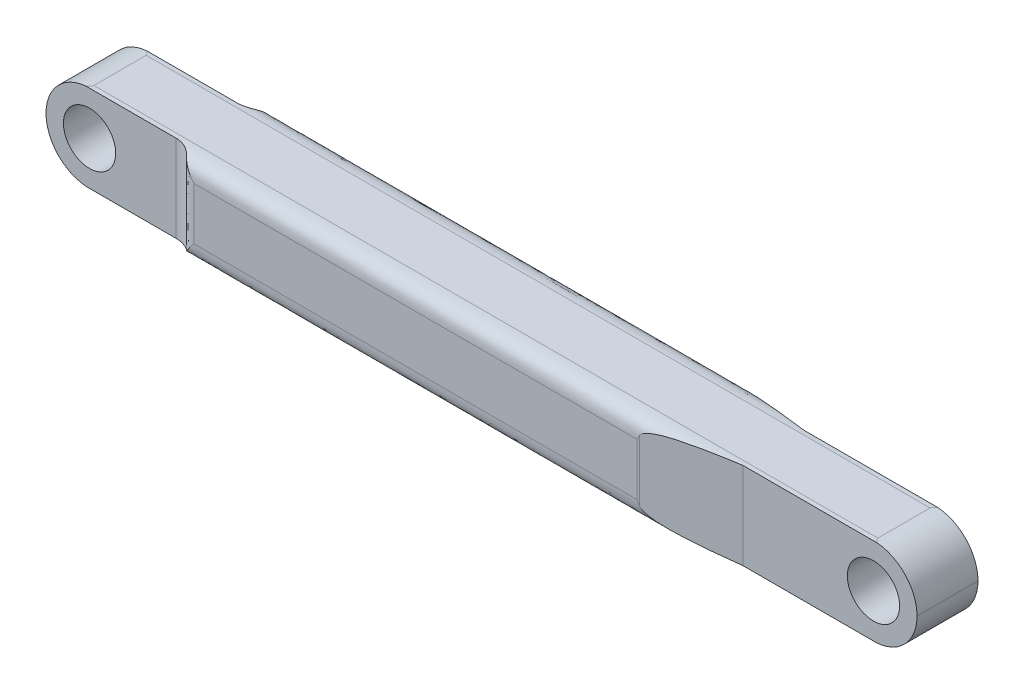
ISO-10303-21;
HEADER;
FILE_DESCRIPTION(('STEP AP214'),'2;1');
FILE_NAME('part.step','',(''),(''),'','','');
FILE_SCHEMA(('AUTOMOTIVE_DESIGN { 1 0 10303 214 1 1 1 1 }'));
ENDSEC;
DATA;
#1=APPLICATION_CONTEXT('core data for automotive mechanical design processes');
#2=APPLICATION_PROTOCOL_DEFINITION('international standard','automotive_design',2000,#1);
#3=PRODUCT_CONTEXT('',#1,'mechanical');
#4=PRODUCT('Part','Part','',(#3));
#5=PRODUCT_RELATED_PRODUCT_CATEGORY('part','',(#4));
#6=PRODUCT_DEFINITION_FORMATION('','',#4);
#7=PRODUCT_DEFINITION_CONTEXT('part definition',#1,'design');
#8=PRODUCT_DEFINITION('design','',#6,#7);
#9=PRODUCT_DEFINITION_SHAPE('','',#8);
#10=(LENGTH_UNIT() NAMED_UNIT(*) SI_UNIT(.MILLI.,.METRE.));
#11=(NAMED_UNIT(*) PLANE_ANGLE_UNIT() SI_UNIT($,.RADIAN.));
#12=(NAMED_UNIT(*) SI_UNIT($,.STERADIAN.) SOLID_ANGLE_UNIT());
#13=UNCERTAINTY_MEASURE_WITH_UNIT(LENGTH_MEASURE(1.E-05),#10,'distance_accuracy_value','');
#14=(GEOMETRIC_REPRESENTATION_CONTEXT(3) GLOBAL_UNCERTAINTY_ASSIGNED_CONTEXT((#13)) GLOBAL_UNIT_ASSIGNED_CONTEXT((#10,
#11,#12)) REPRESENTATION_CONTEXT('',''));
#15=CARTESIAN_POINT('',(0.,0.,0.));
#16=DIRECTION('',(0.,0.,1.));
#17=DIRECTION('',(1.,0.,0.));
#18=AXIS2_PLACEMENT_3D('',#15,#16,#17);
#19=CARTESIAN_POINT('',(175.,100.,50.));
#20=DIRECTION('',(0.,0.,-1.));
#21=DIRECTION('',(-1.,0.,0.));
#22=AXIS2_PLACEMENT_3D('',#19,#20,#21);
#23=PLANE('',#22);
#24=CARTESIAN_POINT('',(5.,80.,50.));
#25=CARTESIAN_POINT('',(44.9391955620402,80.,50.));
#26=CARTESIAN_POINT('',(161.387129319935,80.,50.));
#27=CARTESIAN_POINT('',(334.374203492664,80.,50.));
#28=CARTESIAN_POINT('',(557.452484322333,80.,50.));
#29=CARTESIAN_POINT('',(771.004550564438,80.,50.));
#30=CARTESIAN_POINT('',(928.017476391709,80.,50.));
#31=CARTESIAN_POINT('',(995.,80.,50.));
#32=B_SPLINE_CURVE_WITH_KNOTS('',3,(#24,#25,#26,#27,#28,#29,#30,#31),.UNSPECIFIED.,.F.,.F.,(4,1,
1,1,1,4),(-0.995,-0.875182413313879,-0.645656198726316,-0.476038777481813,-0.205947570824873,
-0.005),.UNSPECIFIED.);
#33=CARTESIAN_POINT('',(693.57864376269,80.,50.));
#34=VERTEX_POINT('',#33);
#35=CARTESIAN_POINT('',(184.726380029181,80.,50.));
#36=VERTEX_POINT('',#35);
#37=EDGE_CURVE('E933',#34,#36,#32,.F.);
#38=ORIENTED_EDGE('',*,*,#37,.T.);
#39=CARTESIAN_POINT('',(184.726380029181,-5.,50.));
#40=CARTESIAN_POINT('',(184.726380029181,0.555555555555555,50.));
#41=CARTESIAN_POINT('',(184.726380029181,15.5555555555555,50.));
#42=CARTESIAN_POINT('',(184.726380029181,37.2222222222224,50.));
#43=CARTESIAN_POINT('',(184.726380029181,62.7777777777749,50.));
#44=CARTESIAN_POINT('',(184.726380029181,84.4444444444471,50.));
#45=CARTESIAN_POINT('',(184.726380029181,99.4444444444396,50.));
#46=CARTESIAN_POINT('',(184.726380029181,105.,50.));
#47=B_SPLINE_CURVE_WITH_KNOTS('',3,(#39,#40,#41,#42,#43,#44,#45,#46),.UNSPECIFIED.,.F.,.F.,(4,1,
1,1,1,4),(-0.105,-0.0883333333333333,-0.06,-0.04,-0.0116666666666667,0.005),.UNSPECIFIED.);
#48=CARTESIAN_POINT('',(184.726380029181,20.,50.));
#49=VERTEX_POINT('',#48);
#50=EDGE_CURVE('E458',#36,#49,#47,.F.);
#51=ORIENTED_EDGE('',*,*,#50,.T.);
#52=CARTESIAN_POINT('',(995.,20.,50.));
#53=CARTESIAN_POINT('',(928.017476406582,20.,50.));
#54=CARTESIAN_POINT('',(771.00455055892,20.,50.));
#55=CARTESIAN_POINT('',(557.452484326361,20.,50.));
#56=CARTESIAN_POINT('',(334.374203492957,20.,50.));
#57=CARTESIAN_POINT('',(161.387129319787,20.,50.));
#58=CARTESIAN_POINT('',(44.9391955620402,20.,50.));
#59=CARTESIAN_POINT('',(5.,20.,50.));
#60=B_SPLINE_CURVE_WITH_KNOTS('',3,(#52,#53,#54,#55,#56,#57,#58,#59),.UNSPECIFIED.,.F.,.F.,(4,1,
1,1,1,4),(-0.17,0.0309475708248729,0.301038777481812,0.470656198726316,0.700182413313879,0.82),.UNSPECIFIED.);
#61=CARTESIAN_POINT('',(693.57864376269,20.,50.));
#62=VERTEX_POINT('',#61);
#63=EDGE_CURVE('E426',#49,#62,#60,.F.);
#64=ORIENTED_EDGE('',*,*,#63,.T.);
#65=CARTESIAN_POINT('',(693.57864376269,105.,50.));
#66=CARTESIAN_POINT('',(693.57864376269,99.4444444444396,50.));
#67=CARTESIAN_POINT('',(693.57864376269,84.4444444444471,50.));
#68=CARTESIAN_POINT('',(693.57864376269,62.7777777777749,50.));
#69=CARTESIAN_POINT('',(693.57864376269,37.2222222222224,50.));
#70=CARTESIAN_POINT('',(693.57864376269,15.5555555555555,50.));
#71=CARTESIAN_POINT('',(693.57864376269,0.555555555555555,50.));
#72=CARTESIAN_POINT('',(693.57864376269,-5.,50.));
#73=B_SPLINE_CURVE_WITH_KNOTS('',3,(#65,#66,#67,#68,#69,#70,#71,#72),.UNSPECIFIED.,.F.,.F.,(4,1,
1,1,1,4),(-0.005,0.0116666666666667,0.04,0.06,0.0883333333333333,0.105),.UNSPECIFIED.);
#74=EDGE_CURVE('E1037',#62,#34,#73,.F.);
#75=ORIENTED_EDGE('',*,*,#74,.T.);
#76=EDGE_LOOP('',(#38,#51,#64,#75));
#77=FACE_BOUND('',#76,.T.);
#78=ADVANCED_FACE('F49',(#77),#23,.F.);
#79=CARTESIAN_POINT('',(695.,100.,50.));
#80=DIRECTION('',(-0.141421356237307,0.,-0.989949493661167));
#81=DIRECTION('',(-0.989949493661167,0.,0.141421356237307));
#82=AXIS2_PLACEMENT_3D('',#79,#80,#81);
#83=PLANE('',#82);
#84=DIRECTION('',(0.,-1.,0.));
#85=VECTOR('',#84,1.);
#86=CARTESIAN_POINT('',(800.,100.,35.0000000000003));
#87=LINE('',#86,#85);
#88=CARTESIAN_POINT('',(800.,99.8405884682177,35.0000000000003));
#89=VERTEX_POINT('',#88);
#90=CARTESIAN_POINT('',(800.,0.159411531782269,35.0000000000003));
#91=VERTEX_POINT('',#90);
#92=EDGE_CURVE('E217',#89,#91,#87,.T.);
#93=ORIENTED_EDGE('',*,*,#92,.F.);
#94=CARTESIAN_POINT('',(696.407070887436,85.4268480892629,49.7989898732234));
#95=CARTESIAN_POINT('',(696.496314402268,85.548635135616,49.786242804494));
#96=CARTESIAN_POINT('',(696.58910384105,85.6677111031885,49.773013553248));
#97=CARTESIAN_POINT('',(696.784463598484,85.9049905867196,49.7451855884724));
#98=CARTESIAN_POINT('',(696.887269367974,86.0229968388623,49.7305542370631));
#99=CARTESIAN_POINT('',(697.10264172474,86.2580791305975,49.6999026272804));
#100=CARTESIAN_POINT('',(697.215431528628,86.3749454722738,49.6838506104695));
#101=CARTESIAN_POINT('',(697.450792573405,86.6077023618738,49.6503407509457));
#102=CARTESIAN_POINT('',(697.573573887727,86.7233755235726,49.6328524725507));
#103=CARTESIAN_POINT('',(697.828929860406,86.9536914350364,49.5964585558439));
#104=CARTESIAN_POINT('',(697.961699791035,87.0681124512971,49.5775242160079));
#105=CARTESIAN_POINT('',(698.237048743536,87.295867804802,49.5382309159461));
#106=CARTESIAN_POINT('',(698.379807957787,87.4089790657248,49.5178452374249));
#107=CARTESIAN_POINT('',(698.675150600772,87.6340563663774,49.4756463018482));
#108=CARTESIAN_POINT('',(698.827899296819,87.7458003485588,49.4538084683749));
#109=CARTESIAN_POINT('',(699.14323548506,87.9680834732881,49.4087061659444));
#110=CARTESIAN_POINT('',(699.30597388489,88.078403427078,49.3854193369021));
#111=CARTESIAN_POINT('',(699.641304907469,88.2977797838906,49.3374239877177));
#112=CARTESIAN_POINT('',(699.814034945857,88.406621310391,49.3126953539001));
#113=CARTESIAN_POINT('',(700.169357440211,88.6229789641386,49.2618237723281));
#114=CARTESIAN_POINT('',(700.352074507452,88.7302854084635,49.2356628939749));
#115=CARTESIAN_POINT('',(700.925548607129,89.0561035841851,49.1535807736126));
#116=CARTESIAN_POINT('',(701.321452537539,89.2654220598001,49.0969517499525));
#117=CARTESIAN_POINT('',(702.01159383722,89.6089816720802,48.9983318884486));
#118=CARTESIAN_POINT('',(702.303566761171,89.747941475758,48.9566382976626));
#119=CARTESIAN_POINT('',(702.907369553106,90.0242164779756,48.8704059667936));
#120=CARTESIAN_POINT('',(703.219420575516,90.1610380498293,48.8258351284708));
#121=CARTESIAN_POINT('',(704.209990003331,90.5791935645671,48.6843419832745));
#122=CARTESIAN_POINT('',(704.895058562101,90.8447049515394,48.5864745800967));
#123=CARTESIAN_POINT('',(706.34418148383,91.368886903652,48.3794307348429));
#124=CARTESIAN_POINT('',(707.109368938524,91.6243072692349,48.2700899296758));
#125=CARTESIAN_POINT('',(708.48075298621,92.0524896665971,48.0741783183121));
#126=CARTESIAN_POINT('',(709.085173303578,92.2311208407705,47.9878501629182));
#127=CARTESIAN_POINT('',(710.33821572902,92.5839921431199,47.8088801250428));
#128=CARTESIAN_POINT('',(710.987129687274,92.7571701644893,47.7161965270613));
#129=CARTESIAN_POINT('',(713.061198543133,93.285175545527,47.4199487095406));
#130=CARTESIAN_POINT('',(714.493432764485,93.6116124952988,47.2153602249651));
#131=CARTESIAN_POINT('',(717.534244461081,94.2462810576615,46.7808421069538));
#132=CARTESIAN_POINT('',(719.144105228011,94.5480685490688,46.5507117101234));
#133=CARTESIAN_POINT('',(721.961128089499,95.0308777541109,46.1485074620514));
#134=CARTESIAN_POINT('',(723.166428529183,95.2230814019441,45.9765747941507));
#135=CARTESIAN_POINT('',(725.679457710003,95.5993601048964,45.618289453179));
#136=CARTESIAN_POINT('',(726.987475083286,95.7814737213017,45.4319112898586));
#137=CARTESIAN_POINT('',(729.705958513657,96.137009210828,45.0442532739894));
#138=CARTESIAN_POINT('',(731.116639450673,96.3087125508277,44.8429196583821));
#139=CARTESIAN_POINT('',(734.040526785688,96.6427397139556,44.4252456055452));
#140=CARTESIAN_POINT('',(735.553899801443,96.8035315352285,44.208854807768));
#141=CARTESIAN_POINT('',(738.683209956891,97.1151549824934,43.7611707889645));
#142=CARTESIAN_POINT('',(740.299277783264,97.2646140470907,43.5298431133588));
#143=CARTESIAN_POINT('',(743.634010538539,97.5530441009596,43.0526277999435));
#144=CARTESIAN_POINT('',(745.352780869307,97.6907774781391,42.8067329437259));
#145=CARTESIAN_POINT('',(748.306143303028,97.9114196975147,42.3848457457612));
#146=CARTESIAN_POINT('',(749.540385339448,97.9988262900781,42.2087244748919));
#147=CARTESIAN_POINT('',(752.102810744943,98.1715528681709,41.8431250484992));
#148=CARTESIAN_POINT('',(753.431038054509,98.2562149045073,41.6536442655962));
#149=CARTESIAN_POINT('',(756.181439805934,98.4225836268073,41.2611231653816));
#150=CARTESIAN_POINT('',(757.60364969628,98.5036633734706,41.0580667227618));
#151=CARTESIAN_POINT('',(760.542023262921,98.6620058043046,40.6383126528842));
#152=CARTESIAN_POINT('',(762.058216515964,98.7386670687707,40.421595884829));
#153=CARTESIAN_POINT('',(765.184565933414,98.8873290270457,39.9746142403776));
#154=CARTESIAN_POINT('',(766.794747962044,98.9587503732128,39.7443384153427));
#155=CARTESIAN_POINT('',(770.109058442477,99.0961734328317,39.2703118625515));
#156=CARTESIAN_POINT('',(771.81320913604,99.1616190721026,39.0265556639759));
#157=CARTESIAN_POINT('',(774.543147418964,99.2587511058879,38.6367706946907));
#158=CARTESIAN_POINT('',(775.568790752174,99.2935017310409,38.4904851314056));
#159=CARTESIAN_POINT('',(777.798304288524,99.3655379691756,38.1725967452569));
#160=CARTESIAN_POINT('',(779.002196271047,99.4022159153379,38.0010086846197));
#161=CARTESIAN_POINT('',(781.588202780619,99.4766106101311,37.6321829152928));
#162=CARTESIAN_POINT('',(782.970330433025,99.5136780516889,37.4349066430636));
#163=CARTESIAN_POINT('',(785.912815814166,99.5872403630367,37.0146054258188));
#164=CARTESIAN_POINT('',(787.473184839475,99.6230456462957,36.7915390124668));
#165=CARTESIAN_POINT('',(790.772151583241,99.692460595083,36.3197178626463));
#166=CARTESIAN_POINT('',(792.510760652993,99.7253529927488,36.0709376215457));
#167=CARTESIAN_POINT('',(796.166208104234,99.7874067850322,35.547997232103));
#168=CARTESIAN_POINT('',(798.083060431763,99.8158408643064,35.2738477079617));
#169=CARTESIAN_POINT('',(800.,99.8405884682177,35.0000000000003));
#170=B_SPLINE_CURVE_WITH_KNOTS('',3,(#94,#95,#96,#97,#98,#99,#100,#101,#102,#103,#104,#105,#106,
#107,#108,#109,#110,#111,#112,#113,#114,#115,#116,#117,#118,#119,#120,#121,#122,#123,#124,#125,
#126,#127,#128,#129,#130,#131,#132,#133,#134,#135,#136,#137,#138,#139,#140,#141,#142,#143,#144,
#145,#146,#147,#148,#149,#150,#151,#152,#153,#154,#155,#156,#157,#158,#159,#160,#161,#162,#163,
#164,#165,#166,#167,#168,#169),.UNSPECIFIED.,.F.,.F.,(4,2,2,2,2,2,2,2,2,2,2,2,2,2,2,2,2,2,2,2,2,
2,2,2,2,2,2,2,2,2,2,2,2,2,2,2,2,4),(0.,0.454427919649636,0.925761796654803,1.41519350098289,
1.92378936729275,2.45250242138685,3.00218444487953,3.57359741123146,4.16742402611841,
4.78427724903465,5.42470877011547,6.77812536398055,7.75608537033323,8.7868323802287,
11.0093584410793,13.4508153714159,15.3590366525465,17.3928029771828,21.8407005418,
26.8016958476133,30.4991972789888,34.5001284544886,38.8057977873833,43.4172333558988,
48.3352038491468,53.5602579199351,57.3096442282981,61.3426412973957,65.6593672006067,
70.2598984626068,75.1442660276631,80.3124519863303,83.4222644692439,87.0720912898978,
91.2619646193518,95.9918707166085,101.261735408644,107.071414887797),.UNSPECIFIED.);
#171=CARTESIAN_POINT('',(696.407070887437,85.4268480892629,49.7989898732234));
#172=VERTEX_POINT('',#171);
#173=EDGE_CURVE('E71',#89,#172,#170,.F.);
#174=ORIENTED_EDGE('',*,*,#173,.T.);
#175=CARTESIAN_POINT('',(696.407070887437,-5.,49.7989898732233));
#176=CARTESIAN_POINT('',(696.407070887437,0.555555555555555,49.7989898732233));
#177=CARTESIAN_POINT('',(696.407070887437,15.5555555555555,49.7989898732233));
#178=CARTESIAN_POINT('',(696.407070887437,37.2222222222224,49.7989898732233));
#179=CARTESIAN_POINT('',(696.407070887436,62.7777777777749,49.7989898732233));
#180=CARTESIAN_POINT('',(696.407070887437,84.4444444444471,49.7989898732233));
#181=CARTESIAN_POINT('',(696.407070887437,99.4444444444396,49.7989898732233));
#182=CARTESIAN_POINT('',(696.407070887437,105.,49.7989898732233));
#183=B_SPLINE_CURVE_WITH_KNOTS('',3,(#175,#176,#177,#178,#179,#180,#181,#182),.UNSPECIFIED.,.F.,
.F.,(4,1,1,1,1,4),(-0.005,0.0116666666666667,0.04,0.06,0.0883333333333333,0.105),.UNSPECIFIED.);
#184=CARTESIAN_POINT('',(696.407070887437,14.5731519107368,49.7989898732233));
#185=VERTEX_POINT('',#184);
#186=EDGE_CURVE('E76',#172,#185,#183,.F.);
#187=ORIENTED_EDGE('',*,*,#186,.T.);
#188=CARTESIAN_POINT('',(800.,0.15941153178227,35.0000000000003));
#189=CARTESIAN_POINT('',(798.083907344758,0.184148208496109,35.2737267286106));
#190=CARTESIAN_POINT('',(796.167901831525,0.212568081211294,35.5477548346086));
#191=CARTESIAN_POINT('',(792.514059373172,0.274587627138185,36.0704648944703));
#192=CARTESIAN_POINT('',(790.776208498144,0.307460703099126,36.3191362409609));
#193=CARTESIAN_POINT('',(787.478669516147,0.376832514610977,36.7907526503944));
#194=CARTESIAN_POINT('',(785.918970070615,0.412614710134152,37.013723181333));
#195=CARTESIAN_POINT('',(782.977735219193,0.486127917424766,37.43384582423));
#196=CARTESIAN_POINT('',(781.596188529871,0.523170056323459,37.6310393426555));
#197=CARTESIAN_POINT('',(779.011255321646,0.597512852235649,37.9997126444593));
#198=CARTESIAN_POINT('',(777.807855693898,0.634164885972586,38.1712309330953));
#199=CARTESIAN_POINT('',(775.579238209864,0.706149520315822,38.4889921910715));
#200=CARTESIAN_POINT('',(774.553998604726,0.740875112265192,38.6352204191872));
#201=CARTESIAN_POINT('',(771.825709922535,0.837915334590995,39.0247700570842));
#202=CARTESIAN_POINT('',(770.122804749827,0.903287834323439,39.2683476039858));
#203=CARTESIAN_POINT('',(766.810874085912,1.040552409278,39.7420327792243));
#204=CARTESIAN_POINT('',(765.201826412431,1.11188963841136,39.9721458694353));
#205=CARTESIAN_POINT('',(762.077634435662,1.26037227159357,40.4188183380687));
#206=CARTESIAN_POINT('',(760.56246433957,1.33693964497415,40.6353886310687));
#207=CARTESIAN_POINT('',(757.626025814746,1.49508451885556,41.0548663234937));
#208=CARTESIAN_POINT('',(756.204727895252,1.57606200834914,41.2577928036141));
#209=CARTESIAN_POINT('',(753.456038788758,1.7422177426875,41.6500702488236));
#210=CARTESIAN_POINT('',(752.128612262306,1.82677056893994,41.8394372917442));
#211=CARTESIAN_POINT('',(749.567677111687,1.9992716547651,42.204825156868));
#212=CARTESIAN_POINT('',(748.334124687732,2.08656361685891,42.3808485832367));
#213=CARTESIAN_POINT('',(745.385739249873,2.30665931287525,42.8020243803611));
#214=CARTESIAN_POINT('',(743.671252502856,2.44391567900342,43.0473040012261));
#215=CARTESIAN_POINT('',(740.344585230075,2.73130407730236,43.5233592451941));
#216=CARTESIAN_POINT('',(738.732300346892,2.88020929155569,43.75414204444));
#217=CARTESIAN_POINT('',(735.610054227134,3.19063655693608,44.2008112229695));
#218=CARTESIAN_POINT('',(734.099963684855,3.35079852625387,44.4167316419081));
#219=CARTESIAN_POINT('',(731.182139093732,3.68347660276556,44.833541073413));
#220=CARTESIAN_POINT('',(729.774240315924,3.8544752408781,45.0344798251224));
#221=CARTESIAN_POINT('',(727.060818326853,4.20851045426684,45.4214218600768));
#222=CARTESIAN_POINT('',(725.755082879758,4.38984558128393,45.6074783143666));
#223=CARTESIAN_POINT('',(723.24611364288,4.76447587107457,45.9651893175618));
#224=CARTESIAN_POINT('',(722.042594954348,4.95582984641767,46.1368690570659));
#225=CARTESIAN_POINT('',(719.218107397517,5.43837401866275,46.5401394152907));
#226=CARTESIAN_POINT('',(717.599039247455,5.74101952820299,46.7715862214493));
#227=CARTESIAN_POINT('',(714.541313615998,6.3776869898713,47.2085215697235));
#228=CARTESIAN_POINT('',(713.101362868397,6.70519800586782,47.4142124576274));
#229=CARTESIAN_POINT('',(711.016329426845,7.23513559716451,47.7120261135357));
#230=CARTESIAN_POINT('',(710.364121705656,7.4089406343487,47.8051800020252));
#231=CARTESIAN_POINT('',(709.104868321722,7.76312522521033,47.9850368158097));
#232=CARTESIAN_POINT('',(708.497527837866,7.94243051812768,48.0717818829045));
#233=CARTESIAN_POINT('',(707.1191332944,8.37244569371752,48.2686950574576));
#234=CARTESIAN_POINT('',(706.349873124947,8.62908833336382,48.3786182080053));
#235=CARTESIAN_POINT('',(704.893412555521,9.15586374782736,48.5867108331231));
#236=CARTESIAN_POINT('',(704.205062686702,9.42269842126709,48.6850470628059));
#237=CARTESIAN_POINT('',(703.209950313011,9.84305251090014,48.8271887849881));
#238=CARTESIAN_POINT('',(702.896562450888,9.98057794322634,48.871950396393));
#239=CARTESIAN_POINT('',(702.290288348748,10.2582884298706,48.9585353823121));
#240=CARTESIAN_POINT('',(701.997177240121,10.3979720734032,49.0003913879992));
#241=CARTESIAN_POINT('',(701.307225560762,10.7419766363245,49.0989840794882));
#242=CARTESIAN_POINT('',(700.912610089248,10.9509263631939,49.1554285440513));
#243=CARTESIAN_POINT('',(700.340990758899,11.2761435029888,49.2372446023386));
#244=CARTESIAN_POINT('',(700.158853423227,11.3832541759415,49.2633222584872));
#245=CARTESIAN_POINT('',(699.804647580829,11.5992127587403,49.3140335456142));
#246=CARTESIAN_POINT('',(699.632455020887,11.7078521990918,49.3386850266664));
#247=CARTESIAN_POINT('',(699.298156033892,11.9268171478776,49.3865323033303));
#248=CARTESIAN_POINT('',(699.135912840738,12.0369290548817,49.4097481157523));
#249=CARTESIAN_POINT('',(698.821524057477,12.2587891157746,49.4547146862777));
#250=CARTESIAN_POINT('',(698.669228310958,12.3703194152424,49.4764876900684));
#251=CARTESIAN_POINT('',(698.374748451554,12.5949626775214,49.5185633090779));
#252=CARTESIAN_POINT('',(698.232399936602,12.7078549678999,49.5388903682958));
#253=CARTESIAN_POINT('',(697.957829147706,12.935166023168,49.5780727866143));
#254=CARTESIAN_POINT('',(697.825427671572,13.0493631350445,49.5969547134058));
#255=CARTESIAN_POINT('',(697.570765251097,13.2792252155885,49.6332501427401));
#256=CARTESIAN_POINT('',(697.448310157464,13.3946698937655,49.6506921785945));
#257=CARTESIAN_POINT('',(697.213558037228,13.6269641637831,49.6841158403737));
#258=CARTESIAN_POINT('',(697.101052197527,13.7435978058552,49.7001277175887));
#259=CARTESIAN_POINT('',(696.886204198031,13.9782094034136,49.7307052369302));
#260=CARTESIAN_POINT('',(696.783640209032,14.095979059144,49.7453024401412));
#261=CARTESIAN_POINT('',(696.588720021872,14.3327805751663,49.7730681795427));
#262=CARTESIAN_POINT('',(696.496129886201,14.4516164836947,49.7862691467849));
#263=CARTESIAN_POINT('',(696.407070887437,14.5731519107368,49.7989898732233));
#264=B_SPLINE_CURVE_WITH_KNOTS('',3,(#188,#189,#190,#191,#192,#193,#194,#195,#196,#197,#198,
#199,#200,#201,#202,#203,#204,#205,#206,#207,#208,#209,#210,#211,#212,#213,#214,#215,#216,#217,
#218,#219,#220,#221,#222,#223,#224,#225,#226,#227,#228,#229,#230,#231,#232,#233,#234,#235,#236,
#237,#238,#239,#240,#241,#242,#243,#244,#245,#246,#247,#248,#249,#250,#251,#252,#253,#254,#255,
#256,#257,#258,#259,#260,#261,#262,#263),.UNSPECIFIED.,.F.,.F.,(4,2,2,2,2,2,2,2,2,2,2,2,2,2,2,2,
2,2,2,2,2,2,2,2,2,2,2,2,2,2,2,2,2,2,2,2,2,4),(0.,5.80711273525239,11.0746788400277,
15.8025546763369,19.990666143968,23.6389994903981,26.7475868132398,31.9119924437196,
36.7929144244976,41.3903348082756,45.7042843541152,49.7348392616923,53.4821171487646,
58.6941173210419,63.6005195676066,68.2018658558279,72.4989150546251,76.4926815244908,
80.1844570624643,85.173348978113,89.6447527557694,91.6886479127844,93.6059281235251,
96.0602445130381,98.2934593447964,99.3287610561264,100.310763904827,101.660211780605,
102.29882956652,102.913980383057,103.506213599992,104.076139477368,104.624437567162,
105.151866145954,105.659272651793,106.147605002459,106.617923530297,107.071413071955),.UNSPECIFIED.);
#265=EDGE_CURVE('E893',#185,#91,#264,.F.);
#266=ORIENTED_EDGE('',*,*,#265,.T.);
#267=EDGE_LOOP('',(#93,#174,#187,#266));
#268=FACE_BOUND('',#267,.T.);
#269=ADVANCED_FACE('F439',(#268),#83,.F.);
#270=CARTESIAN_POINT('',(1000.,100.,35.0000000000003));
#271=DIRECTION('',(0.,0.,-1.));
#272=DIRECTION('',(-1.,0.,0.));
#273=AXIS2_PLACEMENT_3D('',#270,#271,#272);
#274=PLANE('',#273);
#275=CARTESIAN_POINT('',(950.,50.,35.0000000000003));
#276=DIRECTION('',(0.,0.,1.));
#277=DIRECTION('',(1.,0.,0.));
#278=AXIS2_PLACEMENT_3D('',#275,#276,#277);
#279=CIRCLE('',#278,30.);
#280=CARTESIAN_POINT('',(980.,50.,35.0000000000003));
#281=VERTEX_POINT('',#280);
#282=EDGE_CURVE('E1255',#281,#281,#279,.T.);
#283=ORIENTED_EDGE('',*,*,#282,.F.);
#284=EDGE_LOOP('',(#283));
#285=FACE_BOUND('',#284,.T.);
#286=CARTESIAN_POINT('',(950.,50.,35.0000000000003));
#287=DIRECTION('',(0.,0.,-1.));
#288=DIRECTION('',(-1.,0.,0.));
#289=AXIS2_PLACEMENT_3D('',#286,#287,#288);
#290=CIRCLE('',#289,50.);
#291=CARTESIAN_POINT('',(1000.,50.,35.0000000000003));
#292=VERTEX_POINT('',#291);
#293=CARTESIAN_POINT('',(953.989453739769,99.8405884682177,35.0000000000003));
#294=VERTEX_POINT('',#293);
#295=EDGE_CURVE('E358',#292,#294,#290,.F.);
#296=ORIENTED_EDGE('',*,*,#295,.T.);
#297=CARTESIAN_POINT('',(5.,99.8405884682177,35.0000000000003));
#298=CARTESIAN_POINT('',(44.9391955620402,99.8405884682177,35.0000000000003));
#299=CARTESIAN_POINT('',(161.387129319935,99.8405884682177,35.0000000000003));
#300=CARTESIAN_POINT('',(334.374203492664,99.8405884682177,35.0000000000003));
#301=CARTESIAN_POINT('',(557.452484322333,99.8405884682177,35.0000000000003));
#302=CARTESIAN_POINT('',(771.004550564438,99.8405884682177,35.0000000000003));
#303=CARTESIAN_POINT('',(928.017476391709,99.8405884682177,35.0000000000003));
#304=CARTESIAN_POINT('',(995.,99.8405884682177,35.0000000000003));
#305=B_SPLINE_CURVE_WITH_KNOTS('',3,(#297,#298,#299,#300,#301,#302,#303,#304),.UNSPECIFIED.,.F.,
.F.,(4,1,1,1,1,4),(-0.995,-0.875182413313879,-0.645656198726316,-0.476038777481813,
-0.205947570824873,-0.005),.UNSPECIFIED.);
#306=EDGE_CURVE('E974',#294,#89,#305,.F.);
#307=ORIENTED_EDGE('',*,*,#306,.T.);
#308=ORIENTED_EDGE('',*,*,#92,.T.);
#309=CARTESIAN_POINT('',(995.,0.159411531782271,35.0000000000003));
#310=CARTESIAN_POINT('',(928.017476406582,0.159411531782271,35.0000000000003));
#311=CARTESIAN_POINT('',(771.00455055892,0.159411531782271,35.0000000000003));
#312=CARTESIAN_POINT('',(557.452484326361,0.159411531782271,35.0000000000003));
#313=CARTESIAN_POINT('',(334.374203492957,0.159411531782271,35.0000000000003));
#314=CARTESIAN_POINT('',(161.387129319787,0.159411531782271,35.0000000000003));
#315=CARTESIAN_POINT('',(44.9391955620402,0.159411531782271,35.0000000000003));
#316=CARTESIAN_POINT('',(5.,0.159411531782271,35.0000000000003));
#317=B_SPLINE_CURVE_WITH_KNOTS('',3,(#309,#310,#311,#312,#313,#314,#315,#316),.UNSPECIFIED.,.F.,
.F.,(4,1,1,1,1,4),(-0.17,0.0309475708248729,0.301038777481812,0.470656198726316,
0.700182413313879,0.82),.UNSPECIFIED.);
#318=CARTESIAN_POINT('',(953.98945373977,0.159411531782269,35.0000000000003));
#319=VERTEX_POINT('',#318);
#320=EDGE_CURVE('E882',#91,#319,#317,.F.);
#321=ORIENTED_EDGE('',*,*,#320,.T.);
#322=CARTESIAN_POINT('',(950.,50.,35.0000000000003));
#323=DIRECTION('',(0.,0.,-1.));
#324=DIRECTION('',(-1.,0.,0.));
#325=AXIS2_PLACEMENT_3D('',#322,#323,#324);
#326=CIRCLE('',#325,50.);
#327=EDGE_CURVE('E368',#319,#292,#326,.F.);
#328=ORIENTED_EDGE('',*,*,#327,.T.);
#329=EDGE_LOOP('',(#296,#307,#308,#321,#328));
#330=FACE_BOUND('',#329,.T.);
#331=ADVANCED_FACE('F348',(#285,#330),#274,.F.);
#332=CARTESIAN_POINT('',(800.,100.,-35.0000000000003));
#333=DIRECTION('',(0.,0.,1.));
#334=DIRECTION('',(1.,0.,0.));
#335=AXIS2_PLACEMENT_3D('',#332,#333,#334);
#336=PLANE('',#335);
#337=CARTESIAN_POINT('',(950.,50.,-35.0000000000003));
#338=DIRECTION('',(0.,0.,1.));
#339=DIRECTION('',(1.,0.,0.));
#340=AXIS2_PLACEMENT_3D('',#337,#338,#339);
#341=CIRCLE('',#340,30.);
#342=CARTESIAN_POINT('',(980.,50.,-35.0000000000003));
#343=VERTEX_POINT('',#342);
#344=EDGE_CURVE('E1258',#343,#343,#341,.F.);
#345=ORIENTED_EDGE('',*,*,#344,.F.);
#346=EDGE_LOOP('',(#345));
#347=FACE_BOUND('',#346,.T.);
#348=DIRECTION('',(0.,-1.,0.));
#349=VECTOR('',#348,1.);
#350=CARTESIAN_POINT('',(800.,100.,-35.0000000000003));
#351=LINE('',#350,#349);
#352=CARTESIAN_POINT('',(800.,99.8405884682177,-35.0000000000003));
#353=VERTEX_POINT('',#352);
#354=CARTESIAN_POINT('',(800.,0.159411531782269,-35.0000000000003));
#355=VERTEX_POINT('',#354);
#356=EDGE_CURVE('E229',#353,#355,#351,.T.);
#357=ORIENTED_EDGE('',*,*,#356,.F.);
#358=CARTESIAN_POINT('',(995.,99.8405884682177,-35.0000000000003));
#359=CARTESIAN_POINT('',(928.017476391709,99.8405884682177,-35.0000000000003));
#360=CARTESIAN_POINT('',(771.004550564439,99.8405884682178,-35.0000000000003));
#361=CARTESIAN_POINT('',(557.452484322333,99.8405884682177,-35.0000000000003));
#362=CARTESIAN_POINT('',(334.374203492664,99.8405884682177,-35.0000000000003));
#363=CARTESIAN_POINT('',(161.387129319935,99.8405884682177,-35.0000000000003));
#364=CARTESIAN_POINT('',(44.9391955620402,99.8405884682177,-35.0000000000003));
#365=CARTESIAN_POINT('',(5.,99.8405884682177,-35.0000000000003));
#366=B_SPLINE_CURVE_WITH_KNOTS('',3,(#358,#359,#360,#361,#362,#363,#364,#365),.UNSPECIFIED.,.F.,
.F.,(4,1,1,1,1,4),(0.005,0.205947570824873,0.476038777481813,0.645656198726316,
0.875182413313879,0.995),.UNSPECIFIED.);
#367=CARTESIAN_POINT('',(953.98945373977,99.8405884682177,-35.0000000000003));
#368=VERTEX_POINT('',#367);
#369=EDGE_CURVE('E1050',#353,#368,#366,.F.);
#370=ORIENTED_EDGE('',*,*,#369,.T.);
#371=CARTESIAN_POINT('',(950.,50.,-35.0000000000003));
#372=DIRECTION('',(0.,0.,1.));
#373=DIRECTION('',(1.,0.,0.));
#374=AXIS2_PLACEMENT_3D('',#371,#372,#373);
#375=CIRCLE('',#374,50.);
#376=CARTESIAN_POINT('',(1000.,50.,-35.0000000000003));
#377=VERTEX_POINT('',#376);
#378=EDGE_CURVE('E303',#368,#377,#375,.F.);
#379=ORIENTED_EDGE('',*,*,#378,.T.);
#380=CARTESIAN_POINT('',(950.,50.,-35.0000000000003));
#381=DIRECTION('',(0.,0.,1.));
#382=DIRECTION('',(1.,0.,0.));
#383=AXIS2_PLACEMENT_3D('',#380,#381,#382);
#384=CIRCLE('',#383,50.);
#385=CARTESIAN_POINT('',(953.989453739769,0.159411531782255,-35.0000000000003));
#386=VERTEX_POINT('',#385);
#387=EDGE_CURVE('E318',#377,#386,#384,.F.);
#388=ORIENTED_EDGE('',*,*,#387,.T.);
#389=CARTESIAN_POINT('',(5.,0.159411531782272,-35.0000000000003));
#390=CARTESIAN_POINT('',(44.9391955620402,0.159411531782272,-35.0000000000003));
#391=CARTESIAN_POINT('',(161.387129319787,0.159411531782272,-35.0000000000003));
#392=CARTESIAN_POINT('',(334.374203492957,0.159411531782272,-35.0000000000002));
#393=CARTESIAN_POINT('',(557.452484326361,0.159411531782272,-35.0000000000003));
#394=CARTESIAN_POINT('',(771.00455055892,0.159411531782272,-35.0000000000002));
#395=CARTESIAN_POINT('',(928.017476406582,0.159411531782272,-35.0000000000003));
#396=CARTESIAN_POINT('',(995.,0.159411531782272,-35.0000000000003));
#397=B_SPLINE_CURVE_WITH_KNOTS('',3,(#389,#390,#391,#392,#393,#394,#395,#396),.UNSPECIFIED.,.F.,
.F.,(4,1,1,1,1,4),(-0.82,-0.700182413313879,-0.470656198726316,-0.301038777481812,
-0.0309475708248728,0.17),.UNSPECIFIED.);
#398=EDGE_CURVE('E330',#386,#355,#397,.F.);
#399=ORIENTED_EDGE('',*,*,#398,.T.);
#400=EDGE_LOOP('',(#357,#370,#379,#388,#399));
#401=FACE_BOUND('',#400,.T.);
#402=ADVANCED_FACE('F337',(#347,#401),#336,.F.);
#403=CARTESIAN_POINT('',(695.,100.,-50.));
#404=DIRECTION('',(-0.141421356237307,0.,0.989949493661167));
#405=DIRECTION('',(0.989949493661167,0.,0.141421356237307));
#406=AXIS2_PLACEMENT_3D('',#403,#404,#405);
#407=PLANE('',#406);
#408=CARTESIAN_POINT('',(696.407070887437,105.,-49.7989898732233));
#409=CARTESIAN_POINT('',(696.407070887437,99.4444444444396,-49.7989898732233));
#410=CARTESIAN_POINT('',(696.407070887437,84.4444444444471,-49.7989898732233));
#411=CARTESIAN_POINT('',(696.407070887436,62.7777777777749,-49.7989898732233));
#412=CARTESIAN_POINT('',(696.407070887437,37.2222222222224,-49.7989898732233));
#413=CARTESIAN_POINT('',(696.407070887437,15.5555555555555,-49.7989898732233));
#414=CARTESIAN_POINT('',(696.407070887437,0.555555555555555,-49.7989898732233));
#415=CARTESIAN_POINT('',(696.407070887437,-5.,-49.7989898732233));
#416=B_SPLINE_CURVE_WITH_KNOTS('',3,(#408,#409,#410,#411,#412,#413,#414,#415),.UNSPECIFIED.,.F.,
.F.,(4,1,1,1,1,4),(-0.005,0.0116666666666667,0.04,0.06,0.0883333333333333,0.105),.UNSPECIFIED.);
#417=CARTESIAN_POINT('',(696.407070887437,14.5731519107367,-49.7989898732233));
#418=VERTEX_POINT('',#417);
#419=CARTESIAN_POINT('',(696.407070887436,85.4268480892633,-49.7989898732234));
#420=VERTEX_POINT('',#419);
#421=EDGE_CURVE('E537',#418,#420,#416,.F.);
#422=ORIENTED_EDGE('',*,*,#421,.T.);
#423=CARTESIAN_POINT('',(800.,99.8405884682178,-35.0000000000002));
#424=CARTESIAN_POINT('',(798.083907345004,99.8158517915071,-35.2737267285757));
#425=CARTESIAN_POINT('',(796.167901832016,99.787431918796,-35.5477548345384));
#426=CARTESIAN_POINT('',(792.514059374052,99.7254123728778,-36.070464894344));
#427=CARTESIAN_POINT('',(790.776208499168,99.6925392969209,-36.3191362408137));
#428=CARTESIAN_POINT('',(787.478669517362,99.6231674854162,-36.7907526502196));
#429=CARTESIAN_POINT('',(785.918970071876,99.5873852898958,-37.0137231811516));
#430=CARTESIAN_POINT('',(782.97773522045,99.5138720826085,-37.4338458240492));
#431=CARTESIAN_POINT('',(781.596188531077,99.47682994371,-37.6310393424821));
#432=CARTESIAN_POINT('',(779.011255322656,99.4024871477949,-37.9997126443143));
#433=CARTESIAN_POINT('',(777.807855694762,99.3658351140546,-38.1712309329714));
#434=CARTESIAN_POINT('',(775.579238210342,99.2938504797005,-38.4889921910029));
#435=CARTESIAN_POINT('',(774.553998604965,99.2591248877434,-38.6352204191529));
#436=CARTESIAN_POINT('',(771.825709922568,99.1620846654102,-39.0247700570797));
#437=CARTESIAN_POINT('',(770.122804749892,99.0967121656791,-39.2683476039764));
#438=CARTESIAN_POINT('',(766.810874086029,98.9594475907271,-39.7420327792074));
#439=CARTESIAN_POINT('',(765.201826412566,98.8881103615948,-39.9721458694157));
#440=CARTESIAN_POINT('',(762.077634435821,98.7396277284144,-40.4188183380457));
#441=CARTESIAN_POINT('',(760.562464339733,98.6630603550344,-40.635388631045));
#442=CARTESIAN_POINT('',(757.626025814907,98.5049154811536,-41.0548663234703));
#443=CARTESIAN_POINT('',(756.204727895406,98.42393799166,-41.2577928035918));
#444=CARTESIAN_POINT('',(753.456038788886,98.2577822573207,-41.6500702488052));
#445=CARTESIAN_POINT('',(752.128612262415,98.1732294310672,-41.8394372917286));
#446=CARTESIAN_POINT('',(749.567677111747,98.0007283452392,-42.2048251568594));
#447=CARTESIAN_POINT('',(748.334124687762,97.9134363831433,-42.3808485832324));
#448=CARTESIAN_POINT('',(745.385739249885,97.6933406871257,-42.8020243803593));
#449=CARTESIAN_POINT('',(743.671252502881,97.5560843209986,-43.0473040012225));
#450=CARTESIAN_POINT('',(740.344585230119,97.2686959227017,-43.5233592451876));
#451=CARTESIAN_POINT('',(738.732300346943,97.1197907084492,-43.7541420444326));
#452=CARTESIAN_POINT('',(735.610054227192,96.8093634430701,-44.2008112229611));
#453=CARTESIAN_POINT('',(734.099963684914,96.6492014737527,-44.4167316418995));
#454=CARTESIAN_POINT('',(731.182139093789,96.3165233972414,-44.8335410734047));
#455=CARTESIAN_POINT('',(729.774240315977,96.1455247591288,-45.0344798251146));
#456=CARTESIAN_POINT('',(727.060818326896,95.7914895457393,-45.4214218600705));
#457=CARTESIAN_POINT('',(725.755082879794,95.6101544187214,-45.6074783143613));
#458=CARTESIAN_POINT('',(723.2461136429,95.2355241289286,-45.9651893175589));
#459=CARTESIAN_POINT('',(722.042594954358,95.044170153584,-46.1368690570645));
#460=CARTESIAN_POINT('',(719.21810739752,94.5616259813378,-46.5401394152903));
#461=CARTESIAN_POINT('',(717.599039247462,94.2589804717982,-46.7715862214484));
#462=CARTESIAN_POINT('',(714.541313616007,93.6223130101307,-47.2085215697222));
#463=CARTESIAN_POINT('',(713.101362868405,93.2948019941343,-47.4142124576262));
#464=CARTESIAN_POINT('',(711.016329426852,92.7648644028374,-47.7120261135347));
#465=CARTESIAN_POINT('',(710.364121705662,92.5910593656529,-47.8051800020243));
#466=CARTESIAN_POINT('',(709.104868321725,92.2368747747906,-47.9850368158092));
#467=CARTESIAN_POINT('',(708.497527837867,92.0575694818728,-48.0717818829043));
#468=CARTESIAN_POINT('',(707.119133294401,91.6275543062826,-48.2686950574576));
#469=CARTESIAN_POINT('',(706.349873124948,91.3709116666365,-48.3786182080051));
#470=CARTESIAN_POINT('',(704.893412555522,90.8441362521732,-48.5867108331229));
#471=CARTESIAN_POINT('',(704.205062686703,90.5773015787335,-48.6850470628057));
#472=CARTESIAN_POINT('',(703.209950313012,90.1569474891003,-48.827188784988));
#473=CARTESIAN_POINT('',(702.896562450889,90.0194220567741,-48.8719503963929));
#474=CARTESIAN_POINT('',(702.290288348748,89.7417115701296,-48.9585353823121));
#475=CARTESIAN_POINT('',(701.997177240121,89.6020279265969,-49.0003913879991));
#476=CARTESIAN_POINT('',(701.307225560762,89.2580233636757,-49.0989840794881));
#477=CARTESIAN_POINT('',(700.912610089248,89.0490736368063,-49.1554285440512));
#478=CARTESIAN_POINT('',(700.3409907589,88.7238564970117,-49.2372446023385));
#479=CARTESIAN_POINT('',(700.158853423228,88.616745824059,-49.263322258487));
#480=CARTESIAN_POINT('',(699.80464758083,88.4007872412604,-49.314033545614));
#481=CARTESIAN_POINT('',(699.632455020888,88.2921478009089,-49.3386850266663));
#482=CARTESIAN_POINT('',(699.298156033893,88.0731828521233,-49.3865323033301));
#483=CARTESIAN_POINT('',(699.135912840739,87.9630709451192,-49.4097481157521));
#484=CARTESIAN_POINT('',(698.821524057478,87.7412108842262,-49.4547146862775));
#485=CARTESIAN_POINT('',(698.66922831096,87.6296805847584,-49.4764876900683));
#486=CARTESIAN_POINT('',(698.374748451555,87.4050373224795,-49.5185633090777));
#487=CARTESIAN_POINT('',(698.232399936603,87.292145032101,-49.5388903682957));
#488=CARTESIAN_POINT('',(697.957829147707,87.0648339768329,-49.5780727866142));
#489=CARTESIAN_POINT('',(697.825427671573,86.9506368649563,-49.5969547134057));
#490=CARTESIAN_POINT('',(697.570765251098,86.7207747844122,-49.63325014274));
#491=CARTESIAN_POINT('',(697.448310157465,86.6053301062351,-49.6506921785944));
#492=CARTESIAN_POINT('',(697.213558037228,86.3730358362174,-49.6841158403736));
#493=CARTESIAN_POINT('',(697.101052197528,86.2564021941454,-49.7001277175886));
#494=CARTESIAN_POINT('',(696.886204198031,86.0217905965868,-49.7307052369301));
#495=CARTESIAN_POINT('',(696.783640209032,85.9040209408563,-49.7453024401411));
#496=CARTESIAN_POINT('',(696.588720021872,85.6672194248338,-49.7730681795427));
#497=CARTESIAN_POINT('',(696.496129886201,85.5483835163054,-49.7862691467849));
#498=CARTESIAN_POINT('',(696.407070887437,85.4268480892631,-49.7989898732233));
#499=B_SPLINE_CURVE_WITH_KNOTS('',3,(#423,#424,#425,#426,#427,#428,#429,#430,#431,#432,#433,
#434,#435,#436,#437,#438,#439,#440,#441,#442,#443,#444,#445,#446,#447,#448,#449,#450,#451,#452,
#453,#454,#455,#456,#457,#458,#459,#460,#461,#462,#463,#464,#465,#466,#467,#468,#469,#470,#471,
#472,#473,#474,#475,#476,#477,#478,#479,#480,#481,#482,#483,#484,#485,#486,#487,#488,#489,#490,
#491,#492,#493,#494,#495,#496,#497,#498),.UNSPECIFIED.,.F.,.F.,(4,2,2,2,2,2,2,2,2,2,2,2,2,2,2,2,
2,2,2,2,2,2,2,2,2,2,2,2,2,2,2,2,2,2,2,2,2,4),(0.,5.80711273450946,11.0746788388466,
15.8025546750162,19.9906661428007,23.6389994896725,26.7475868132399,31.9119924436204,
36.7929144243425,41.3903348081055,45.7042843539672,49.7348392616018,53.4821171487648,
58.6941173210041,63.6005195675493,68.2018658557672,72.4989150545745,76.492681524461,
80.1844570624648,85.1733489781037,89.6447527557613,91.6886479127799,93.6059281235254,
96.060244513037,98.2934593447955,99.3287610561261,100.310763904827,101.660211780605,
102.29882956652,102.913980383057,103.506213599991,104.076139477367,104.624437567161,
105.151866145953,105.659272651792,106.147605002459,106.617923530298,107.071413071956),.UNSPECIFIED.);
#500=EDGE_CURVE('E548',#420,#353,#499,.F.);
#501=ORIENTED_EDGE('',*,*,#500,.T.);
#502=ORIENTED_EDGE('',*,*,#356,.T.);
#503=CARTESIAN_POINT('',(696.407070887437,14.5731519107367,-49.7989898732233));
#504=CARTESIAN_POINT('',(696.496314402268,14.4513648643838,-49.786242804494));
#505=CARTESIAN_POINT('',(696.58910384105,14.3322888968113,-49.773013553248));
#506=CARTESIAN_POINT('',(696.784463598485,14.0950094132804,-49.7451855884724));
#507=CARTESIAN_POINT('',(696.887269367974,13.9770031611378,-49.7305542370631));
#508=CARTESIAN_POINT('',(697.10264172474,13.7419208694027,-49.6999026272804));
#509=CARTESIAN_POINT('',(697.215431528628,13.6250545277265,-49.6838506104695));
#510=CARTESIAN_POINT('',(697.450792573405,13.3922976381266,-49.6503407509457));
#511=CARTESIAN_POINT('',(697.573573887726,13.2766244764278,-49.6328524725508));
#512=CARTESIAN_POINT('',(697.828929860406,13.046308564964,-49.596458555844));
#513=CARTESIAN_POINT('',(697.961699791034,12.9318875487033,-49.577524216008));
#514=CARTESIAN_POINT('',(698.237048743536,12.7041321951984,-49.5382309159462));
#515=CARTESIAN_POINT('',(698.379807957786,12.5910209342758,-49.517845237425));
#516=CARTESIAN_POINT('',(698.675150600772,12.3659436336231,-49.4756463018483));
#517=CARTESIAN_POINT('',(698.827899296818,12.2541996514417,-49.453808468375));
#518=CARTESIAN_POINT('',(699.14323548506,12.0319165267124,-49.4087061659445));
#519=CARTESIAN_POINT('',(699.305973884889,11.9215965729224,-49.3854193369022));
#520=CARTESIAN_POINT('',(699.641304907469,11.7022202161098,-49.3374239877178));
#521=CARTESIAN_POINT('',(699.814034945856,11.5933786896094,-49.3126953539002));
#522=CARTESIAN_POINT('',(700.169357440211,11.3770210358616,-49.2618237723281));
#523=CARTESIAN_POINT('',(700.352074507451,11.2697145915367,-49.2356628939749));
#524=CARTESIAN_POINT('',(700.925548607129,10.943896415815,-49.1535807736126));
#525=CARTESIAN_POINT('',(701.32145253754,10.7345779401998,-49.0969517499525));
#526=CARTESIAN_POINT('',(702.01159383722,10.3910183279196,-48.9983318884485));
#527=CARTESIAN_POINT('',(702.303566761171,10.252058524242,-48.9566382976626));
#528=CARTESIAN_POINT('',(702.907369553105,9.97578352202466,-48.8704059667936));
#529=CARTESIAN_POINT('',(703.219420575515,9.838961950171,-48.8258351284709));
#530=CARTESIAN_POINT('',(704.20999000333,9.42080643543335,-48.6843419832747));
#531=CARTESIAN_POINT('',(704.8950585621,9.15529504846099,-48.5864745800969));
#532=CARTESIAN_POINT('',(706.344181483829,8.63111309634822,-48.379430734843));
#533=CARTESIAN_POINT('',(707.109368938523,8.37569273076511,-48.2700899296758));
#534=CARTESIAN_POINT('',(708.480752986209,7.94751033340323,-48.0741783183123));
#535=CARTESIAN_POINT('',(709.085173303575,7.7688791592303,-47.9878501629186));
#536=CARTESIAN_POINT('',(710.338215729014,7.41600785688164,-47.8088801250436));
#537=CARTESIAN_POINT('',(710.987129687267,7.24282983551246,-47.7161965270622));
#538=CARTESIAN_POINT('',(713.061198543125,6.714824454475,-47.4199487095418));
#539=CARTESIAN_POINT('',(714.493432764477,6.38838750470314,-47.2153602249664));
#540=CARTESIAN_POINT('',(717.534244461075,5.75371894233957,-46.7808421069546));
#541=CARTESIAN_POINT('',(719.144105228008,5.45193145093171,-46.5507117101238));
#542=CARTESIAN_POINT('',(721.96112808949,4.96912224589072,-46.1485074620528));
#543=CARTESIAN_POINT('',(723.166428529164,4.77691859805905,-45.9765747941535));
#544=CARTESIAN_POINT('',(725.679457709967,4.40063989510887,-45.6182894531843));
#545=CARTESIAN_POINT('',(726.987475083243,4.21852627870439,-45.4319112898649));
#546=CARTESIAN_POINT('',(729.705958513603,3.86299078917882,-45.0442532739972));
#547=CARTESIAN_POINT('',(731.116639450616,3.69128744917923,-44.8429196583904));
#548=CARTESIAN_POINT('',(734.04052678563,3.35726028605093,-44.4252456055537));
#549=CARTESIAN_POINT('',(735.553899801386,3.19646846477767,-44.2088548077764));
#550=CARTESIAN_POINT('',(738.683209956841,2.88484501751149,-43.7611707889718));
#551=CARTESIAN_POINT('',(740.29927778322,2.73538595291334,-43.5298431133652));
#552=CARTESIAN_POINT('',(743.634010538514,2.44695589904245,-43.0526277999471));
#553=CARTESIAN_POINT('',(745.352780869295,2.3092225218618,-42.8067329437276));
#554=CARTESIAN_POINT('',(748.306143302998,2.08858030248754,-42.3848457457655));
#555=CARTESIAN_POINT('',(749.540385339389,2.00117370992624,-42.2087244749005));
#556=CARTESIAN_POINT('',(752.102810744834,1.82844713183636,-41.8431250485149));
#557=CARTESIAN_POINT('',(753.431038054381,1.74378509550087,-41.6536442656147));
#558=CARTESIAN_POINT('',(756.181439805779,1.57741637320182,-41.261123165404));
#559=CARTESIAN_POINT('',(757.603649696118,1.49633662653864,-41.0580667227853));
#560=CARTESIAN_POINT('',(760.542023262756,1.33799419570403,-40.6383126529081));
#561=CARTESIAN_POINT('',(762.058216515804,1.26133293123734,-40.4215958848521));
#562=CARTESIAN_POINT('',(765.184565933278,1.11267097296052,-39.9746142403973));
#563=CARTESIAN_POINT('',(766.794747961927,1.04124962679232,-39.7443384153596));
#564=CARTESIAN_POINT('',(770.109058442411,0.903826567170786,-39.2703118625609));
#565=CARTESIAN_POINT('',(771.813209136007,0.838380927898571,-39.0265556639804));
#566=CARTESIAN_POINT('',(774.543147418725,0.7412488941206,-38.6367706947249));
#567=CARTESIAN_POINT('',(775.568790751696,0.706498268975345,-38.4904851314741));
#568=CARTESIAN_POINT('',(777.798304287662,0.634462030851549,-38.1725967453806));
#569=CARTESIAN_POINT('',(779.002196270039,0.597784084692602,-38.0010086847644));
#570=CARTESIAN_POINT('',(781.588202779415,0.523389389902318,-37.6321829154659));
#571=CARTESIAN_POINT('',(782.970330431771,0.486321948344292,-37.434906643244));
#572=CARTESIAN_POINT('',(785.912815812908,0.412759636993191,-37.014605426));
#573=CARTESIAN_POINT('',(787.473184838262,0.376954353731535,-36.7915390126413));
#574=CARTESIAN_POINT('',(790.772151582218,0.307539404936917,-36.3197178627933));
#575=CARTESIAN_POINT('',(792.510760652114,0.274647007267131,-36.0709376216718));
#576=CARTESIAN_POINT('',(796.166208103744,0.212593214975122,-35.547997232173));
#577=CARTESIAN_POINT('',(798.083060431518,0.18415913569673,-35.2738477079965));
#578=CARTESIAN_POINT('',(800.,0.159411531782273,-35.0000000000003));
#579=B_SPLINE_CURVE_WITH_KNOTS('',3,(#503,#504,#505,#506,#507,#508,#509,#510,#511,#512,#513,
#514,#515,#516,#517,#518,#519,#520,#521,#522,#523,#524,#525,#526,#527,#528,#529,#530,#531,#532,
#533,#534,#535,#536,#537,#538,#539,#540,#541,#542,#543,#544,#545,#546,#547,#548,#549,#550,#551,
#552,#553,#554,#555,#556,#557,#558,#559,#560,#561,#562,#563,#564,#565,#566,#567,#568,#569,#570,
#571,#572,#573,#574,#575,#576,#577,#578),.UNSPECIFIED.,.F.,.F.,(4,2,2,2,2,2,2,2,2,2,2,2,2,2,2,2,
2,2,2,2,2,2,2,2,2,2,2,2,2,2,2,2,2,2,2,2,2,4),(0.,0.454427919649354,0.925761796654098,
1.415193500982,1.92378936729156,2.45250242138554,3.00218444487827,3.57359741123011,
4.16742402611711,4.78427724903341,5.4247087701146,6.77812536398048,7.75608537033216,
8.78683238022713,11.0093584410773,13.4508153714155,15.3590366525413,17.3928029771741,
21.84070054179,26.8016958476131,30.4991972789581,34.500128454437,38.8057977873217,
43.4172333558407,48.3352038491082,53.5602579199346,57.3096442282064,61.3426412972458,
65.6593672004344,70.25989846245,75.1442660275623,80.3124519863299,83.4222644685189,
87.0720912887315,91.2619646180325,95.9918707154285,101.261735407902,107.071414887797),.UNSPECIFIED.);
#580=EDGE_CURVE('E526',#355,#418,#579,.F.);
#581=ORIENTED_EDGE('',*,*,#580,.T.);
#582=EDGE_LOOP('',(#422,#501,#502,#581));
#583=FACE_BOUND('',#582,.T.);
#584=ADVANCED_FACE('F347',(#583),#407,.F.);
#585=CARTESIAN_POINT('',(175.,100.,-50.));
#586=DIRECTION('',(0.,0.,1.));
#587=DIRECTION('',(1.,0.,0.));
#588=AXIS2_PLACEMENT_3D('',#585,#586,#587);
#589=PLANE('',#588);
#590=CARTESIAN_POINT('',(995.,80.,-50.));
#591=CARTESIAN_POINT('',(928.017476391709,80.,-50.));
#592=CARTESIAN_POINT('',(771.004550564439,80.,-50.));
#593=CARTESIAN_POINT('',(557.452484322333,80.,-50.));
#594=CARTESIAN_POINT('',(334.374203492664,80.,-50.));
#595=CARTESIAN_POINT('',(161.387129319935,80.,-50.));
#596=CARTESIAN_POINT('',(44.9391955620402,80.,-50.));
#597=CARTESIAN_POINT('',(5.,80.,-50.));
#598=B_SPLINE_CURVE_WITH_KNOTS('',3,(#590,#591,#592,#593,#594,#595,#596,#597),.UNSPECIFIED.,.F.,
.F.,(4,1,1,1,1,4),(0.005,0.205947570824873,0.476038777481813,0.645656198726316,
0.875182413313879,0.995),.UNSPECIFIED.);
#599=CARTESIAN_POINT('',(184.726380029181,80.,-50.));
#600=VERTEX_POINT('',#599);
#601=CARTESIAN_POINT('',(693.578643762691,80.,-50.));
#602=VERTEX_POINT('',#601);
#603=EDGE_CURVE('E1075',#600,#602,#598,.F.);
#604=ORIENTED_EDGE('',*,*,#603,.T.);
#605=CARTESIAN_POINT('',(693.57864376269,-5.,-50.));
#606=CARTESIAN_POINT('',(693.57864376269,0.555555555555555,-50.));
#607=CARTESIAN_POINT('',(693.57864376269,15.5555555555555,-50.));
#608=CARTESIAN_POINT('',(693.57864376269,37.2222222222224,-50.));
#609=CARTESIAN_POINT('',(693.57864376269,62.7777777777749,-50.));
#610=CARTESIAN_POINT('',(693.57864376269,84.4444444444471,-50.));
#611=CARTESIAN_POINT('',(693.57864376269,99.4444444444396,-50.));
#612=CARTESIAN_POINT('',(693.57864376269,105.,-50.));
#613=B_SPLINE_CURVE_WITH_KNOTS('',3,(#605,#606,#607,#608,#609,#610,#611,#612),.UNSPECIFIED.,.F.,
.F.,(4,1,1,1,1,4),(-0.005,0.0116666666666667,0.04,0.06,0.0883333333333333,0.105),.UNSPECIFIED.);
#614=CARTESIAN_POINT('',(693.578643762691,20.,-50.));
#615=VERTEX_POINT('',#614);
#616=EDGE_CURVE('E1072',#602,#615,#613,.F.);
#617=ORIENTED_EDGE('',*,*,#616,.T.);
#618=CARTESIAN_POINT('',(5.,20.,-50.));
#619=CARTESIAN_POINT('',(44.9391955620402,20.,-50.));
#620=CARTESIAN_POINT('',(161.387129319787,20.,-50.));
#621=CARTESIAN_POINT('',(334.374203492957,20.,-50.));
#622=CARTESIAN_POINT('',(557.452484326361,20.,-50.));
#623=CARTESIAN_POINT('',(771.00455055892,20.,-50.));
#624=CARTESIAN_POINT('',(928.017476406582,20.,-50.));
#625=CARTESIAN_POINT('',(995.,20.,-50.));
#626=B_SPLINE_CURVE_WITH_KNOTS('',3,(#618,#619,#620,#621,#622,#623,#624,#625),.UNSPECIFIED.,.F.,
.F.,(4,1,1,1,1,4),(-0.82,-0.700182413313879,-0.470656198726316,-0.301038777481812,
-0.0309475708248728,0.17),.UNSPECIFIED.);
#627=CARTESIAN_POINT('',(184.726380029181,20.,-50.));
#628=VERTEX_POINT('',#627);
#629=EDGE_CURVE('E560',#615,#628,#626,.F.);
#630=ORIENTED_EDGE('',*,*,#629,.T.);
#631=CARTESIAN_POINT('',(184.726380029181,105.,-50.));
#632=CARTESIAN_POINT('',(184.726380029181,99.4444444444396,-50.));
#633=CARTESIAN_POINT('',(184.726380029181,84.4444444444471,-50.));
#634=CARTESIAN_POINT('',(184.726380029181,62.7777777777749,-50.));
#635=CARTESIAN_POINT('',(184.726380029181,37.2222222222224,-50.));
#636=CARTESIAN_POINT('',(184.726380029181,15.5555555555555,-50.));
#637=CARTESIAN_POINT('',(184.726380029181,0.555555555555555,-50.));
#638=CARTESIAN_POINT('',(184.726380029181,-5.,-50.));
#639=B_SPLINE_CURVE_WITH_KNOTS('',3,(#631,#632,#633,#634,#635,#636,#637,#638),.UNSPECIFIED.,.F.,
.F.,(4,1,1,1,1,4),(-0.005,0.0116666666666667,0.04,0.06,0.0883333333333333,0.105),.UNSPECIFIED.);
#640=EDGE_CURVE('E754',#628,#600,#639,.F.);
#641=ORIENTED_EDGE('',*,*,#640,.T.);
#642=EDGE_LOOP('',(#604,#617,#630,#641));
#643=FACE_BOUND('',#642,.T.);
#644=ADVANCED_FACE('F1107',(#643),#589,.F.);
#645=CARTESIAN_POINT('',(175.,100.,-35.));
#646=DIRECTION('',(0.,0.,1.));
#647=DIRECTION('',(1.,0.,0.));
#648=AXIS2_PLACEMENT_3D('',#645,#646,#647);
#649=PLANE('',#648);
#650=CARTESIAN_POINT('',(50.,50.,-35.));
#651=DIRECTION('',(0.,0.,-1.));
#652=DIRECTION('',(-1.,0.,0.));
#653=AXIS2_PLACEMENT_3D('',#650,#651,#652);
#654=CIRCLE('',#653,30.);
#655=CARTESIAN_POINT('',(20.,50.,-35.));
#656=VERTEX_POINT('',#655);
#657=EDGE_CURVE('E1267',#656,#656,#654,.T.);
#658=ORIENTED_EDGE('',*,*,#657,.F.);
#659=EDGE_LOOP('',(#658));
#660=FACE_BOUND('',#659,.T.);
#661=CARTESIAN_POINT('',(50.,50.,-35.));
#662=DIRECTION('',(0.,0.,1.));
#663=DIRECTION('',(1.,0.,0.));
#664=AXIS2_PLACEMENT_3D('',#661,#662,#663);
#665=CIRCLE('',#664,50.);
#666=CARTESIAN_POINT('',(0.,50.,-35.));
#667=VERTEX_POINT('',#666);
#668=CARTESIAN_POINT('',(46.0105462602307,99.8405884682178,-35.));
#669=VERTEX_POINT('',#668);
#670=EDGE_CURVE('E225',#667,#669,#665,.F.);
#671=ORIENTED_EDGE('',*,*,#670,.T.);
#672=CARTESIAN_POINT('',(995.,99.8405884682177,-35.));
#673=CARTESIAN_POINT('',(928.017476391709,99.8405884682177,-35.));
#674=CARTESIAN_POINT('',(771.004550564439,99.8405884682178,-35.));
#675=CARTESIAN_POINT('',(557.452484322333,99.8405884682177,-35.));
#676=CARTESIAN_POINT('',(334.374203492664,99.8405884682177,-35.));
#677=CARTESIAN_POINT('',(161.387129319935,99.8405884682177,-35.));
#678=CARTESIAN_POINT('',(44.9391955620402,99.8405884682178,-35.));
#679=CARTESIAN_POINT('',(5.,99.8405884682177,-35.));
#680=B_SPLINE_CURVE_WITH_KNOTS('',3,(#672,#673,#674,#675,#676,#677,#678,#679),.UNSPECIFIED.,.F.,
.F.,(4,1,1,1,1,4),(0.005,0.205947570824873,0.476038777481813,0.645656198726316,
0.875182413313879,0.995),.UNSPECIFIED.);
#681=CARTESIAN_POINT('',(149.019237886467,99.8405884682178,-35.));
#682=VERTEX_POINT('',#681);
#683=EDGE_CURVE('E1059',#669,#682,#680,.F.);
#684=ORIENTED_EDGE('',*,*,#683,.T.);
#685=DIRECTION('',(0.,-1.,0.));
#686=VECTOR('',#685,1.);
#687=CARTESIAN_POINT('',(149.019237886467,100.,-35.));
#688=LINE('',#687,#686);
#689=CARTESIAN_POINT('',(149.019237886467,0.159411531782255,-35.));
#690=VERTEX_POINT('',#689);
#691=EDGE_CURVE('E293',#682,#690,#688,.T.);
#692=ORIENTED_EDGE('',*,*,#691,.T.);
#693=CARTESIAN_POINT('',(5.,0.159411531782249,-35.));
#694=CARTESIAN_POINT('',(44.9391955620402,0.159411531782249,-35.));
#695=CARTESIAN_POINT('',(161.387129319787,0.159411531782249,-35.));
#696=CARTESIAN_POINT('',(334.374203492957,0.159411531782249,-35.));
#697=CARTESIAN_POINT('',(557.452484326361,0.159411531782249,-35.));
#698=CARTESIAN_POINT('',(771.00455055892,0.159411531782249,-35.));
#699=CARTESIAN_POINT('',(928.017476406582,0.159411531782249,-35.));
#700=CARTESIAN_POINT('',(995.,0.159411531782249,-35.));
#701=B_SPLINE_CURVE_WITH_KNOTS('',3,(#693,#694,#695,#696,#697,#698,#699,#700),.UNSPECIFIED.,.F.,
.F.,(4,1,1,1,1,4),(-0.82,-0.700182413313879,-0.470656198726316,-0.301038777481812,
-0.0309475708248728,0.17),.UNSPECIFIED.);
#702=CARTESIAN_POINT('',(46.0105462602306,0.159411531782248,-35.));
#703=VERTEX_POINT('',#702);
#704=EDGE_CURVE('E1061',#690,#703,#701,.F.);
#705=ORIENTED_EDGE('',*,*,#704,.T.);
#706=CARTESIAN_POINT('',(50.,50.,-35.));
#707=DIRECTION('',(0.,0.,1.));
#708=DIRECTION('',(1.,0.,0.));
#709=AXIS2_PLACEMENT_3D('',#706,#707,#708);
#710=CIRCLE('',#709,50.);
#711=EDGE_CURVE('E260',#703,#667,#710,.F.);
#712=ORIENTED_EDGE('',*,*,#711,.T.);
#713=EDGE_LOOP('',(#671,#684,#692,#705,#712));
#714=FACE_BOUND('',#713,.T.);
#715=ADVANCED_FACE('F1080',(#660,#714),#649,.F.);
#716=CARTESIAN_POINT('',(175.,100.,35.));
#717=DIRECTION('',(0.,0.,-1.));
#718=DIRECTION('',(-1.,0.,0.));
#719=AXIS2_PLACEMENT_3D('',#716,#717,#718);
#720=PLANE('',#719);
#721=CARTESIAN_POINT('',(50.,50.,35.));
#722=DIRECTION('',(0.,0.,-1.));
#723=DIRECTION('',(-1.,0.,0.));
#724=AXIS2_PLACEMENT_3D('',#721,#722,#723);
#725=CIRCLE('',#724,30.);
#726=CARTESIAN_POINT('',(20.,50.,35.));
#727=VERTEX_POINT('',#726);
#728=EDGE_CURVE('E230',#727,#727,#725,.F.);
#729=ORIENTED_EDGE('',*,*,#728,.F.);
#730=EDGE_LOOP('',(#729));
#731=FACE_BOUND('',#730,.T.);
#732=DIRECTION('',(0.,1.,0.));
#733=VECTOR('',#732,1.);
#734=CARTESIAN_POINT('',(149.019237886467,100.,35.));
#735=LINE('',#734,#733);
#736=CARTESIAN_POINT('',(149.019237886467,0.159411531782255,35.));
#737=VERTEX_POINT('',#736);
#738=CARTESIAN_POINT('',(149.019237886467,99.8405884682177,35.));
#739=VERTEX_POINT('',#738);
#740=EDGE_CURVE('E304',#737,#739,#735,.T.);
#741=ORIENTED_EDGE('',*,*,#740,.T.);
#742=CARTESIAN_POINT('',(5.,99.8405884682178,35.));
#743=CARTESIAN_POINT('',(44.9391955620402,99.8405884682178,35.));
#744=CARTESIAN_POINT('',(161.387129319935,99.8405884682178,35.));
#745=CARTESIAN_POINT('',(334.374203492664,99.8405884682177,35.));
#746=CARTESIAN_POINT('',(557.452484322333,99.8405884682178,35.));
#747=CARTESIAN_POINT('',(771.004550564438,99.8405884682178,35.));
#748=CARTESIAN_POINT('',(928.017476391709,99.8405884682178,35.));
#749=CARTESIAN_POINT('',(995.,99.8405884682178,35.));
#750=B_SPLINE_CURVE_WITH_KNOTS('',3,(#742,#743,#744,#745,#746,#747,#748,#749),.UNSPECIFIED.,.F.,
.F.,(4,1,1,1,1,4),(-0.995,-0.875182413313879,-0.645656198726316,-0.476038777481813,
-0.205947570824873,-0.005),.UNSPECIFIED.);
#751=CARTESIAN_POINT('',(46.0105462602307,99.8405884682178,35.));
#752=VERTEX_POINT('',#751);
#753=EDGE_CURVE('E11',#739,#752,#750,.F.);
#754=ORIENTED_EDGE('',*,*,#753,.T.);
#755=CARTESIAN_POINT('',(50.,50.,35.));
#756=DIRECTION('',(0.,0.,-1.));
#757=DIRECTION('',(-1.,0.,0.));
#758=AXIS2_PLACEMENT_3D('',#755,#756,#757);
#759=CIRCLE('',#758,50.);
#760=CARTESIAN_POINT('',(0.,50.,35.));
#761=VERTEX_POINT('',#760);
#762=EDGE_CURVE('E205',#752,#761,#759,.F.);
#763=ORIENTED_EDGE('',*,*,#762,.T.);
#764=CARTESIAN_POINT('',(50.,50.,35.));
#765=DIRECTION('',(0.,0.,-1.));
#766=DIRECTION('',(-1.,0.,0.));
#767=AXIS2_PLACEMENT_3D('',#764,#765,#766);
#768=CIRCLE('',#767,50.);
#769=CARTESIAN_POINT('',(46.0105462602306,0.159411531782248,35.));
#770=VERTEX_POINT('',#769);
#771=EDGE_CURVE('E210',#761,#770,#768,.F.);
#772=ORIENTED_EDGE('',*,*,#771,.T.);
#773=CARTESIAN_POINT('',(995.,0.159411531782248,35.));
#774=CARTESIAN_POINT('',(928.017476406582,0.159411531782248,35.));
#775=CARTESIAN_POINT('',(771.00455055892,0.159411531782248,35.));
#776=CARTESIAN_POINT('',(557.452484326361,0.159411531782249,35.));
#777=CARTESIAN_POINT('',(334.374203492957,0.159411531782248,35.));
#778=CARTESIAN_POINT('',(161.387129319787,0.159411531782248,35.));
#779=CARTESIAN_POINT('',(44.9391955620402,0.159411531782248,35.));
#780=CARTESIAN_POINT('',(5.,0.159411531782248,35.));
#781=B_SPLINE_CURVE_WITH_KNOTS('',3,(#773,#774,#775,#776,#777,#778,#779,#780),.UNSPECIFIED.,.F.,
.F.,(4,1,1,1,1,4),(-0.17,0.0309475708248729,0.301038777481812,0.470656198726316,
0.700182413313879,0.82),.UNSPECIFIED.);
#782=EDGE_CURVE('E64',#770,#737,#781,.F.);
#783=ORIENTED_EDGE('',*,*,#782,.T.);
#784=EDGE_LOOP('',(#741,#754,#763,#772,#783));
#785=FACE_BOUND('',#784,.T.);
#786=ADVANCED_FACE('F208',(#731,#785),#720,.F.);
#787=CARTESIAN_POINT('',(0.,100.,0.));
#788=DIRECTION('',(0.,1.,0.));
#789=DIRECTION('',(0.,0.,1.));
#790=AXIS2_PLACEMENT_3D('',#787,#788,#789);
#791=PLANE('',#790);
#792=DIRECTION('',(0.,0.,-1.));
#793=VECTOR('',#792,1.);
#794=CARTESIAN_POINT('',(950.,100.,-35.0000000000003));
#795=LINE('',#794,#793);
#796=CARTESIAN_POINT('',(950.,100.,30.));
#797=VERTEX_POINT('',#796);
#798=CARTESIAN_POINT('',(950.,100.,-30.));
#799=VERTEX_POINT('',#798);
#800=EDGE_CURVE('E381',#797,#799,#795,.T.);
#801=ORIENTED_EDGE('',*,*,#800,.T.);
#802=CARTESIAN_POINT('',(5.,100.,-30.));
#803=CARTESIAN_POINT('',(44.9391955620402,100.,-30.));
#804=CARTESIAN_POINT('',(161.387129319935,100.,-30.));
#805=CARTESIAN_POINT('',(334.374203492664,100.,-30.));
#806=CARTESIAN_POINT('',(557.452484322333,100.,-30.));
#807=CARTESIAN_POINT('',(771.004550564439,100.,-30.));
#808=CARTESIAN_POINT('',(928.017476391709,100.,-30.));
#809=CARTESIAN_POINT('',(995.,100.,-30.));
#810=B_SPLINE_CURVE_WITH_KNOTS('',3,(#802,#803,#804,#805,#806,#807,#808,#809),.UNSPECIFIED.,.F.,
.F.,(4,1,1,1,1,4),(0.005,0.124817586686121,0.354343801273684,0.523961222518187,
0.794052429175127,0.995),.UNSPECIFIED.);
#811=CARTESIAN_POINT('',(50.,100.,-30.));
#812=VERTEX_POINT('',#811);
#813=EDGE_CURVE('E1066',#799,#812,#810,.F.);
#814=ORIENTED_EDGE('',*,*,#813,.T.);
#815=DIRECTION('',(0.,0.,1.));
#816=VECTOR('',#815,1.);
#817=CARTESIAN_POINT('',(50.,100.,35.));
#818=LINE('',#817,#816);
#819=CARTESIAN_POINT('',(50.,100.,30.));
#820=VERTEX_POINT('',#819);
#821=EDGE_CURVE('E469',#812,#820,#818,.T.);
#822=ORIENTED_EDGE('',*,*,#821,.T.);
#823=CARTESIAN_POINT('',(995.,100.,30.));
#824=CARTESIAN_POINT('',(928.017476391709,100.,30.));
#825=CARTESIAN_POINT('',(771.004550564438,100.,30.));
#826=CARTESIAN_POINT('',(557.452484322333,100.,30.));
#827=CARTESIAN_POINT('',(334.374203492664,100.,30.));
#828=CARTESIAN_POINT('',(161.387129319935,100.,30.));
#829=CARTESIAN_POINT('',(44.9391955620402,100.,30.));
#830=CARTESIAN_POINT('',(5.,100.,30.));
#831=B_SPLINE_CURVE_WITH_KNOTS('',3,(#823,#824,#825,#826,#827,#828,#829,#830),.UNSPECIFIED.,.F.,
.F.,(4,1,1,1,1,4),(-0.995,-0.794052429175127,-0.523961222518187,-0.354343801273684,
-0.124817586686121,-0.005),.UNSPECIFIED.);
#832=EDGE_CURVE('E567',#820,#797,#831,.F.);
#833=ORIENTED_EDGE('',*,*,#832,.T.);
#834=EDGE_LOOP('',(#801,#814,#822,#833));
#835=FACE_BOUND('',#834,.T.);
#836=ADVANCED_FACE('F571',(#835),#791,.T.);
#837=CARTESIAN_POINT('',(0.,0.,0.));
#838=DIRECTION('',(0.,1.,0.));
#839=DIRECTION('',(0.,0.,1.));
#840=AXIS2_PLACEMENT_3D('',#837,#838,#839);
#841=PLANE('',#840);
#842=DIRECTION('',(0.,0.,1.));
#843=VECTOR('',#842,1.);
#844=CARTESIAN_POINT('',(50.,0.,0.));
#845=LINE('',#844,#843);
#846=CARTESIAN_POINT('',(50.,0.,30.));
#847=VERTEX_POINT('',#846);
#848=CARTESIAN_POINT('',(50.,0.,-30.));
#849=VERTEX_POINT('',#848);
#850=EDGE_CURVE('E238',#847,#849,#845,.F.);
#851=ORIENTED_EDGE('',*,*,#850,.T.);
#852=CARTESIAN_POINT('',(995.,0.,-30.));
#853=CARTESIAN_POINT('',(928.017476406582,0.,-30.));
#854=CARTESIAN_POINT('',(771.00455055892,0.,-30.));
#855=CARTESIAN_POINT('',(557.452484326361,0.,-30.));
#856=CARTESIAN_POINT('',(334.374203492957,0.,-30.));
#857=CARTESIAN_POINT('',(161.387129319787,0.,-30.));
#858=CARTESIAN_POINT('',(44.9391955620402,0.,-30.));
#859=CARTESIAN_POINT('',(5.,0.,-30.));
#860=B_SPLINE_CURVE_WITH_KNOTS('',3,(#852,#853,#854,#855,#856,#857,#858,#859),.UNSPECIFIED.,.F.,
.F.,(4,1,1,1,1,4),(-0.82,-0.619052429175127,-0.348961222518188,-0.179343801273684,
0.0501824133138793,0.17),.UNSPECIFIED.);
#861=CARTESIAN_POINT('',(950.,0.,-30.));
#862=VERTEX_POINT('',#861);
#863=EDGE_CURVE('E601',#849,#862,#860,.F.);
#864=ORIENTED_EDGE('',*,*,#863,.T.);
#865=DIRECTION('',(0.,0.,-1.));
#866=VECTOR('',#865,1.);
#867=CARTESIAN_POINT('',(950.,0.,0.));
#868=LINE('',#867,#866);
#869=CARTESIAN_POINT('',(950.,0.,30.));
#870=VERTEX_POINT('',#869);
#871=EDGE_CURVE('E325',#862,#870,#868,.F.);
#872=ORIENTED_EDGE('',*,*,#871,.T.);
#873=CARTESIAN_POINT('',(5.,0.,30.));
#874=CARTESIAN_POINT('',(44.9391955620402,0.,30.));
#875=CARTESIAN_POINT('',(161.387129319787,0.,30.));
#876=CARTESIAN_POINT('',(334.374203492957,0.,30.));
#877=CARTESIAN_POINT('',(557.452484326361,0.,30.));
#878=CARTESIAN_POINT('',(771.00455055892,0.,30.));
#879=CARTESIAN_POINT('',(928.017476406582,0.,30.));
#880=CARTESIAN_POINT('',(995.,0.,30.));
#881=B_SPLINE_CURVE_WITH_KNOTS('',3,(#873,#874,#875,#876,#877,#878,#879,#880),.UNSPECIFIED.,.F.,
.F.,(4,1,1,1,1,4),(-0.17,-0.0501824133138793,0.179343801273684,0.348961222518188,
0.619052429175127,0.82),.UNSPECIFIED.);
#882=EDGE_CURVE('E608',#870,#847,#881,.F.);
#883=ORIENTED_EDGE('',*,*,#882,.T.);
#884=EDGE_LOOP('',(#851,#864,#872,#883));
#885=FACE_BOUND('',#884,.T.);
#886=ADVANCED_FACE('F283',(#885),#841,.F.);
#887=CARTESIAN_POINT('',(50.,50.,0.));
#888=DIRECTION('',(0.,0.,-1.));
#889=DIRECTION('',(-1.,0.,0.));
#890=AXIS2_PLACEMENT_3D('',#887,#888,#889);
#891=CYLINDRICAL_SURFACE('',#890,50.);
#892=ORIENTED_EDGE('',*,*,#821,.F.);
#893=CARTESIAN_POINT('',(46.0105462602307,99.8405884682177,-35.));
#894=CARTESIAN_POINT('',(46.1617191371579,99.8526911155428,-34.8661075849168));
#895=CARTESIAN_POINT('',(46.3119663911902,99.8640240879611,-34.7310896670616));
#896=CARTESIAN_POINT('',(46.60364502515,99.8847208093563,-34.4645579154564));
#897=CARTESIAN_POINT('',(46.7451721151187,99.8941495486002,-34.333153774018));
#898=CARTESIAN_POINT('',(47.0194193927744,99.9112663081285,-34.0739080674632));
#899=CARTESIAN_POINT('',(47.1522446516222,99.9190145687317,-33.9461818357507));
#900=CARTESIAN_POINT('',(47.4090721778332,99.9329864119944,-33.6943150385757));
#901=CARTESIAN_POINT('',(47.5331916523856,99.9392653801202,-33.5702972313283));
#902=CARTESIAN_POINT('',(47.7725983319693,99.9505001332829,-33.3258607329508));
#903=CARTESIAN_POINT('',(47.8880165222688,99.9555064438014,-33.2055729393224));
#904=CARTESIAN_POINT('',(48.1099973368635,99.9643833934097,-32.9685897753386));
#905=CARTESIAN_POINT('',(48.2167077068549,99.96829967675,-32.8520346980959));
#906=CARTESIAN_POINT('',(48.4511861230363,99.9761730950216,-32.5889711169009));
#907=CARTESIAN_POINT('',(48.5781528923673,99.9799324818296,-32.4417387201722));
#908=CARTESIAN_POINT('',(48.8164562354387,99.9861201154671,-32.1536038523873));
#909=CARTESIAN_POINT('',(48.9282451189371,99.9886282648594,-32.0130803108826));
#910=CARTESIAN_POINT('',(49.0873922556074,99.9916960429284,-31.8026805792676));
#911=CARTESIAN_POINT('',(49.137474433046,99.9925835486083,-31.7348673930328));
#912=CARTESIAN_POINT('',(49.2337346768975,99.9941502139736,-31.6008286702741));
#913=CARTESIAN_POINT('',(49.2799882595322,99.9948366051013,-31.5346575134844));
#914=CARTESIAN_POINT('',(49.3903085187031,99.9963241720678,-31.3721189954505));
#915=CARTESIAN_POINT('',(49.4534095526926,99.9970462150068,-31.2750911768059));
#916=CARTESIAN_POINT('',(49.5690986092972,99.9981664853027,-31.0870448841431));
#917=CARTESIAN_POINT('',(49.6221195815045,99.9985884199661,-30.9962965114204));
#918=CARTESIAN_POINT('',(49.6954717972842,99.9990691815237,-30.8612458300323));
#919=CARTESIAN_POINT('',(49.7180668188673,99.9992013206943,-30.8181731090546));
#920=CARTESIAN_POINT('',(49.7606427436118,99.9994238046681,-30.7335418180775));
#921=CARTESIAN_POINT('',(49.7806984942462,99.9995159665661,-30.6920210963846));
#922=CARTESIAN_POINT('',(49.818189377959,99.9996677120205,-30.6104910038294));
#923=CARTESIAN_POINT('',(49.8357073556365,99.9997287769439,-30.5705199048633));
#924=CARTESIAN_POINT('',(49.8681140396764,99.9998263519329,-30.4920847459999));
#925=CARTESIAN_POINT('',(49.8830943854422,99.9998640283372,-30.4536587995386));
#926=CARTESIAN_POINT('',(49.9104161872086,99.9999217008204,-30.3783126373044));
#927=CARTESIAN_POINT('',(49.9228586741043,99.9999425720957,-30.3414292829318));
#928=CARTESIAN_POINT('',(49.9450964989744,99.9999724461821,-30.2691632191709));
#929=CARTESIAN_POINT('',(49.95500241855,99.9999820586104,-30.2338150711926));
#930=CARTESIAN_POINT('',(49.9680530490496,99.9999913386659,-30.1811678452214));
#931=CARTESIAN_POINT('',(49.972029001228,99.9999935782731,-30.1640731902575));
#932=CARTESIAN_POINT('',(49.9793297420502,99.999996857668,-30.1302646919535));
#933=CARTESIAN_POINT('',(49.9826701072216,99.9999979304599,-30.1135542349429));
#934=CARTESIAN_POINT('',(49.9886995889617,99.9999993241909,-30.0805145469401));
#935=CARTESIAN_POINT('',(49.9914047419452,99.9999996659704,-30.0641882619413));
#936=CARTESIAN_POINT('',(49.9961622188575,100.000000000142,-30.0319180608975));
#937=CARTESIAN_POINT('',(49.9982309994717,100.000000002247,-30.0159765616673));
#938=CARTESIAN_POINT('',(50.,100.,-30.));
#939=B_SPLINE_CURVE_WITH_KNOTS('',3,(#893,#894,#895,#896,#897,#898,#899,#900,#901,#902,#903,
#904,#905,#906,#907,#908,#909,#910,#911,#912,#913,#914,#915,#916,#917,#918,#919,#920,#921,#922,
#923,#924,#925,#926,#927,#928,#929,#930,#931,#932,#933,#934,#935,#936,#937,#938),.UNSPECIFIED.,
.F.,.F.,(4,2,2,2,2,2,2,2,2,2,2,2,2,2,2,2,2,2,2,2,2,2,4),(0.,0.606915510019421,1.18694811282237,
1.74022041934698,2.26689813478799,2.76719363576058,3.24137077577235,3.82460127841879,
4.36315966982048,4.61605507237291,4.85824082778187,5.20536564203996,5.52050469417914,
5.666401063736,5.80470514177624,5.93559645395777,6.0592847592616,6.17601662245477,
6.28608338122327,6.33872897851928,6.38984327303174,6.43947978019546,6.48769683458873),.UNSPECIFIED.);
#940=EDGE_CURVE('E1063',#812,#669,#939,.F.);
#941=ORIENTED_EDGE('',*,*,#940,.T.);
#942=ORIENTED_EDGE('',*,*,#670,.F.);
#943=DIRECTION('',(0.,0.,1.));
#944=VECTOR('',#943,1.);
#945=CARTESIAN_POINT('',(0.,50.,-35.));
#946=LINE('',#945,#944);
#947=EDGE_CURVE('E221',#761,#667,#946,.F.);
#948=ORIENTED_EDGE('',*,*,#947,.F.);
#949=ORIENTED_EDGE('',*,*,#762,.F.);
#950=CARTESIAN_POINT('',(50.,100.,30.));
#951=CARTESIAN_POINT('',(49.9982348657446,100.000000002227,30.0159416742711));
#952=CARTESIAN_POINT('',(49.996171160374,100.000000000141,30.0318484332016));
#953=CARTESIAN_POINT('',(49.9914262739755,99.9999996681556,30.0640478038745));
#954=CARTESIAN_POINT('',(49.9887287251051,99.9999993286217,30.0803380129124));
#955=CARTESIAN_POINT('',(49.9827168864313,99.9999979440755,30.1133042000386));
#956=CARTESIAN_POINT('',(49.9793866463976,99.9999968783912,30.1299772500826));
#957=CARTESIAN_POINT('',(49.9721085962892,99.9999936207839,30.1637095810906));
#958=CARTESIAN_POINT('',(49.9681452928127,99.9999913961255,30.1807654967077));
#959=CARTESIAN_POINT('',(49.9551371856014,99.999982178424,30.2332914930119));
#960=CARTESIAN_POINT('',(49.945264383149,99.9999726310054,30.268558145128));
#961=CARTESIAN_POINT('',(49.9231022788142,99.9999429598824,30.3406556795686));
#962=CARTESIAN_POINT('',(49.9107029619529,99.9999222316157,30.3774522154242));
#963=CARTESIAN_POINT('',(49.8834770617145,99.9998649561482,30.4526191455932));
#964=CARTESIAN_POINT('',(49.8685499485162,99.999827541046,30.4909529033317));
#965=CARTESIAN_POINT('',(49.836259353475,99.9997306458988,30.569198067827));
#966=CARTESIAN_POINT('',(49.8188046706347,99.9996700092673,30.609071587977));
#967=CARTESIAN_POINT('',(49.7814500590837,99.9995193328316,30.6904008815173));
#968=CARTESIAN_POINT('',(49.7614676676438,99.9994278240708,30.7318186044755));
#969=CARTESIAN_POINT('',(49.7190482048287,99.9992069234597,30.8162382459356));
#970=CARTESIAN_POINT('',(49.6965366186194,99.999075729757,30.8592025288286));
#971=CARTESIAN_POINT('',(49.6234585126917,99.9985984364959,30.9939064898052));
#972=CARTESIAN_POINT('',(49.5706355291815,99.9981795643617,31.0844220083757));
#973=CARTESIAN_POINT('',(49.4553806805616,99.9970674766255,31.2719789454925));
#974=CARTESIAN_POINT('',(49.3925175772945,99.9963507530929,31.3687516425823));
#975=CARTESIAN_POINT('',(49.2823428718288,99.9948705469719,31.5312591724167));
#976=CARTESIAN_POINT('',(49.2359835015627,99.994184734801,31.5976445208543));
#977=CARTESIAN_POINT('',(49.1394841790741,99.9926183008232,31.7321247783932));
#978=CARTESIAN_POINT('',(49.0892677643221,99.9917303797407,31.8001646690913));
#979=CARTESIAN_POINT('',(48.9296533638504,99.9886591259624,32.0112977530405));
#980=CARTESIAN_POINT('',(48.8175081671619,99.9861458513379,32.1523114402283));
#981=CARTESIAN_POINT('',(48.5783844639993,99.9799401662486,32.4414821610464));
#982=CARTESIAN_POINT('',(48.4509484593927,99.9761669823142,32.5892559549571));
#983=CARTESIAN_POINT('',(48.2160063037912,99.9682745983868,32.8528069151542));
#984=CARTESIAN_POINT('',(48.1093192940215,99.9643576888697,32.9693242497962));
#985=CARTESIAN_POINT('',(47.8873917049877,99.9554799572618,33.2062288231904));
#986=CARTESIAN_POINT('',(47.7720035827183,99.9504735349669,33.3264759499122));
#987=CARTESIAN_POINT('',(47.5326636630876,99.9392392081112,33.5708280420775));
#988=CARTESIAN_POINT('',(47.4085810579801,99.9329608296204,33.6948022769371));
#989=CARTESIAN_POINT('',(47.1518338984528,99.9189910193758,33.9465788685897));
#990=CARTESIAN_POINT('',(47.0190522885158,99.9112442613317,34.0742586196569));
#991=CARTESIAN_POINT('',(46.744898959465,99.8941315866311,34.3334083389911));
#992=CARTESIAN_POINT('',(46.6034223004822,99.8847054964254,34.464763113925));
#993=CARTESIAN_POINT('',(46.311851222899,99.8640153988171,34.7311931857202));
#994=CARTESIAN_POINT('',(46.1616612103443,99.8526864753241,34.866158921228));
#995=CARTESIAN_POINT('',(46.0105462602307,99.8405884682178,34.9999999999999));
#996=B_SPLINE_CURVE_WITH_KNOTS('',3,(#950,#951,#952,#953,#954,#955,#956,#957,#958,#959,#960,
#961,#962,#963,#964,#965,#966,#967,#968,#969,#970,#971,#972,#973,#974,#975,#976,#977,#978,#979,
#980,#981,#982,#983,#984,#985,#986,#987,#988,#989,#990,#991,#992,#993,#994,#995),.UNSPECIFIED.,
.F.,.F.,(4,2,2,2,2,2,2,2,2,2,2,2,2,2,2,2,2,2,2,2,2,2,4),(0.,0.0481117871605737,
0.0976378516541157,0.148636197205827,0.201160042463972,0.310964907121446,0.427408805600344,
0.550781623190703,0.681328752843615,0.819259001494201,0.964751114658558,1.2789880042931,
1.62508242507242,1.86797624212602,2.12165764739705,2.66202998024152,3.24740878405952,
3.72145531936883,4.2216004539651,4.74810763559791,5.30118892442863,5.88100978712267,
6.48769266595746),.UNSPECIFIED.);
#997=EDGE_CURVE('E267',#752,#820,#996,.F.);
#998=ORIENTED_EDGE('',*,*,#997,.T.);
#999=EDGE_LOOP('',(#892,#941,#942,#948,#949,#998));
#1000=FACE_BOUND('',#999,.T.);
#1001=ADVANCED_FACE('F223',(#1000),#891,.T.);
#1002=CARTESIAN_POINT('',(50.,50.,35.));
#1003=DIRECTION('',(0.,0.,1.));
#1004=DIRECTION('',(1.,0.,0.));
#1005=AXIS2_PLACEMENT_3D('',#1002,#1003,#1004);
#1006=CYLINDRICAL_SURFACE('',#1005,50.);
#1007=ORIENTED_EDGE('',*,*,#711,.F.);
#1008=CARTESIAN_POINT('',(50.,0.,-30.));
#1009=CARTESIAN_POINT('',(49.9982348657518,-2.22681301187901E-09,-30.015941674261));
#1010=CARTESIAN_POINT('',(49.9961711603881,-1.40921043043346E-10,-30.0318484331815));
#1011=CARTESIAN_POINT('',(49.9914262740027,3.31844413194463E-07,-30.0640478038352));
#1012=CARTESIAN_POINT('',(49.9887287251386,6.71378345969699E-07,-30.080338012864));
#1013=CARTESIAN_POINT('',(49.9827168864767,2.05592451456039E-06,-30.1133041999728));
#1014=CARTESIAN_POINT('',(49.9793866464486,3.12160873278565E-06,-30.1299772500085));
#1015=CARTESIAN_POINT('',(49.972108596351,6.37921604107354E-06,-30.1637095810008));
#1016=CARTESIAN_POINT('',(49.9681452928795,8.60387446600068E-06,-30.1807654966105));
#1017=CARTESIAN_POINT('',(49.9551371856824,1.78215760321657E-05,-30.2332914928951));
#1018=CARTESIAN_POINT('',(49.9452643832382,2.73689945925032E-05,-30.268558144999));
#1019=CARTESIAN_POINT('',(49.9231022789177,5.70401174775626E-05,-30.3406556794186));
#1020=CARTESIAN_POINT('',(49.9107029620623,7.77683841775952E-05,-30.3774522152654));
#1021=CARTESIAN_POINT('',(49.8834770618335,0.000135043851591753,-30.4526191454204));
#1022=CARTESIAN_POINT('',(49.8685499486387,0.000172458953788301,-30.4909529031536));
#1023=CARTESIAN_POINT('',(49.8362593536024,0.000269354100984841,-30.5691980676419));
#1024=CARTESIAN_POINT('',(49.8188046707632,0.000329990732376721,-30.60907158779));
#1025=CARTESIAN_POINT('',(49.7814500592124,0.000480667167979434,-30.6904008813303));
#1026=CARTESIAN_POINT('',(49.7614676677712,0.000572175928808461,-30.7318186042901));
#1027=CARTESIAN_POINT('',(49.7190482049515,0.000793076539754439,-30.816238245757));
#1028=CARTESIAN_POINT('',(49.6965366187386,0.00092427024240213,-30.8592025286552));
#1029=CARTESIAN_POINT('',(49.6234585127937,0.00140156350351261,-30.9939064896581));
#1030=CARTESIAN_POINT('',(49.570635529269,0.00182043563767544,-31.084422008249));
#1031=CARTESIAN_POINT('',(49.4553806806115,0.00293252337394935,-31.2719789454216));
#1032=CARTESIAN_POINT('',(49.3925175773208,0.00364924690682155,-31.3687516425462));
#1033=CARTESIAN_POINT('',(49.2823428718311,0.00512945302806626,-31.5312591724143));
#1034=CARTESIAN_POINT('',(49.2359835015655,0.00581526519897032,-31.5976445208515));
#1035=CARTESIAN_POINT('',(49.1394841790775,0.00738169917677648,-31.7321247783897));
#1036=CARTESIAN_POINT('',(49.0892677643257,0.00826962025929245,-31.8001646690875));
#1037=CARTESIAN_POINT('',(48.9296533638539,0.0113408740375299,-32.0112977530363));
#1038=CARTESIAN_POINT('',(48.8175081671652,0.0138541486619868,-32.1523114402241));
#1039=CARTESIAN_POINT('',(48.5783844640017,0.020059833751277,-32.4414821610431));
#1040=CARTESIAN_POINT('',(48.4509484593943,0.0238330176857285,-32.5892559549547));
#1041=CARTESIAN_POINT('',(48.2160063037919,0.0317254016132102,-32.8528069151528));
#1042=CARTESIAN_POINT('',(48.1093192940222,0.0356423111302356,-32.969324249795));
#1043=CARTESIAN_POINT('',(47.8873917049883,0.0445200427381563,-33.2062288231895));
#1044=CARTESIAN_POINT('',(47.7720035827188,0.0495264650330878,-33.3264759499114));
#1045=CARTESIAN_POINT('',(47.532663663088,0.0607607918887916,-33.5708280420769));
#1046=CARTESIAN_POINT('',(47.4085810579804,0.0670391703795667,-33.6948022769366));
#1047=CARTESIAN_POINT('',(47.151833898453,0.0810089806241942,-33.9465788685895));
#1048=CARTESIAN_POINT('',(47.0190522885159,0.0887557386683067,-34.0742586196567));
#1049=CARTESIAN_POINT('',(46.7448989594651,0.105868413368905,-34.333408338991));
#1050=CARTESIAN_POINT('',(46.6034223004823,0.115294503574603,-34.464763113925));
#1051=CARTESIAN_POINT('',(46.311851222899,0.135984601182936,-34.7311931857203));
#1052=CARTESIAN_POINT('',(46.1616612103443,0.147313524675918,-34.8661589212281));
#1053=CARTESIAN_POINT('',(46.0105462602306,0.15941153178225,-35.));
#1054=B_SPLINE_CURVE_WITH_KNOTS('',3,(#1008,#1009,#1010,#1011,#1012,#1013,#1014,#1015,#1016,
#1017,#1018,#1019,#1020,#1021,#1022,#1023,#1024,#1025,#1026,#1027,#1028,#1029,#1030,#1031,#1032,
#1033,#1034,#1035,#1036,#1037,#1038,#1039,#1040,#1041,#1042,#1043,#1044,#1045,#1046,#1047,#1048,
#1049,#1050,#1051,#1052,#1053),.UNSPECIFIED.,.F.,.F.,(4,2,2,2,2,2,2,2,2,2,2,2,2,2,2,2,2,2,2,2,2,
2,4),(0.,0.0481117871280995,0.0976378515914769,0.14863619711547,0.201160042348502,
0.310964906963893,0.427408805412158,0.550781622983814,0.681328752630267,0.819259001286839,
0.964751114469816,1.27898800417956,1.62508242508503,1.86797624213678,2.12165764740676,
2.66202998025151,3.24740878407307,3.72145531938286,4.22160045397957,4.74810763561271,
5.3011889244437,5.88100978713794,6.48769266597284),.UNSPECIFIED.);
#1055=EDGE_CURVE('E1044',#703,#849,#1054,.F.);
#1056=ORIENTED_EDGE('',*,*,#1055,.T.);
#1057=ORIENTED_EDGE('',*,*,#850,.F.);
#1058=CARTESIAN_POINT('',(46.0105462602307,0.159411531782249,35.));
#1059=CARTESIAN_POINT('',(46.1617191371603,0.147308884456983,34.8661075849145));
#1060=CARTESIAN_POINT('',(46.3119663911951,0.135975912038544,34.7310896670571));
#1061=CARTESIAN_POINT('',(46.6036450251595,0.115279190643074,34.4645579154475));
#1062=CARTESIAN_POINT('',(46.7451721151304,0.105850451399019,34.333153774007));
#1063=CARTESIAN_POINT('',(47.01941939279,0.0887336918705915,34.0739080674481));
#1064=CARTESIAN_POINT('',(47.1522446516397,0.0809854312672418,33.9461818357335));
#1065=CARTESIAN_POINT('',(47.409072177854,0.0670135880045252,33.6943150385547));
#1066=CARTESIAN_POINT('',(47.5331916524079,0.0607346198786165,33.5702972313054));
#1067=CARTESIAN_POINT('',(47.7725983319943,0.0494998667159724,33.3258607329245));
#1068=CARTESIAN_POINT('',(47.8880165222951,0.0444935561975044,33.2055729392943));
#1069=CARTESIAN_POINT('',(48.1099973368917,0.0356166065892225,32.9685897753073));
#1070=CARTESIAN_POINT('',(48.216707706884,0.0317003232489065,32.852034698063));
#1071=CARTESIAN_POINT('',(48.4511861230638,0.023826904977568,32.5889711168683));
#1072=CARTESIAN_POINT('',(48.5781528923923,0.0200675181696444,32.4417387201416));
#1073=CARTESIAN_POINT('',(48.8164562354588,0.0138798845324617,32.1536038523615));
#1074=CARTESIAN_POINT('',(48.9282451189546,0.0113717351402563,32.0130803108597));
#1075=CARTESIAN_POINT('',(49.0873922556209,0.00830395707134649,31.8026805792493));
#1076=CARTESIAN_POINT('',(49.137474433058,0.00741645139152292,31.7348673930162));
#1077=CARTESIAN_POINT('',(49.2337346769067,0.0058497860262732,31.6008286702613));
#1078=CARTESIAN_POINT('',(49.2799882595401,0.00516339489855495,31.5346575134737));
#1079=CARTESIAN_POINT('',(49.390308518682,0.00367582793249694,31.3721189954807));
#1080=CARTESIAN_POINT('',(49.4534095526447,0.00295378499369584,31.2750911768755));
#1081=CARTESIAN_POINT('',(49.5690986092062,0.00183351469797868,31.087044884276));
#1082=CARTESIAN_POINT('',(49.6221195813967,0.00141158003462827,30.9962965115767));
#1083=CARTESIAN_POINT('',(49.6954717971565,0.000930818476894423,30.8612458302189));
#1084=CARTESIAN_POINT('',(49.7180668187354,0.00079867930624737,30.8181731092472));
#1085=CARTESIAN_POINT('',(49.7606427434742,0.000576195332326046,30.7335418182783));
#1086=CARTESIAN_POINT('',(49.780698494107,0.000484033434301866,30.6920210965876));
#1087=CARTESIAN_POINT('',(49.8181893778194,0.00033228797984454,30.6104910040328));
#1088=CARTESIAN_POINT('',(49.835707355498,0.000271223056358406,30.570519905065));
#1089=CARTESIAN_POINT('',(49.8681140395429,0.000173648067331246,30.4920847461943));
#1090=CARTESIAN_POINT('',(49.8830943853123,0.000135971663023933,30.4536587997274));
#1091=CARTESIAN_POINT('',(49.910416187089,7.82991797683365E-05,30.3783126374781));
#1092=CARTESIAN_POINT('',(49.922858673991,5.74279044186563E-05,30.3414292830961));
#1093=CARTESIAN_POINT('',(49.9450964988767,2.75538179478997E-05,30.2691632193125));
#1094=CARTESIAN_POINT('',(49.9550024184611,1.7941389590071E-05,30.2338150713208));
#1095=CARTESIAN_POINT('',(49.9680530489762,8.66133415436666E-06,30.1811678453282));
#1096=CARTESIAN_POINT('',(49.9720290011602,6.42172691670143E-06,30.1640731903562));
#1097=CARTESIAN_POINT('',(49.9793297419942,3.1423320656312E-06,30.130264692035));
#1098=CARTESIAN_POINT('',(49.9826701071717,2.0695401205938E-06,30.1135542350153));
#1099=CARTESIAN_POINT('',(49.988699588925,6.75809100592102E-07,30.0805145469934));
#1100=CARTESIAN_POINT('',(49.9914047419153,3.34029599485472E-07,30.0641882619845));
#1101=CARTESIAN_POINT('',(49.9961622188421,-1.4228219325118E-10,30.0319180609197));
#1102=CARTESIAN_POINT('',(49.9982309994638,-2.24656679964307E-09,30.0159765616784));
#1103=CARTESIAN_POINT('',(50.,0.,30.));
#1104=B_SPLINE_CURVE_WITH_KNOTS('',3,(#1058,#1059,#1060,#1061,#1062,#1063,#1064,#1065,#1066,
#1067,#1068,#1069,#1070,#1071,#1072,#1073,#1074,#1075,#1076,#1077,#1078,#1079,#1080,#1081,#1082,
#1083,#1084,#1085,#1086,#1087,#1088,#1089,#1090,#1091,#1092,#1093,#1094,#1095,#1096,#1097,#1098,
#1099,#1100,#1101,#1102,#1103),.UNSPECIFIED.,.F.,.F.,(4,2,2,2,2,2,2,2,2,2,2,2,2,2,2,2,2,2,2,2,2,
2,4),(0.,0.606915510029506,1.18694811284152,1.74022041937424,2.26689813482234,2.76719363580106,
3.24137077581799,3.82460127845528,4.36315966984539,4.61605507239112,4.85824082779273,
5.20536564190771,5.52050469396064,5.66640106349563,5.80470514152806,5.9355964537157,
6.05928475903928,6.17601662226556,6.28608338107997,6.33872897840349,6.38984327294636,
6.43947978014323,6.48769683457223),.UNSPECIFIED.);
#1105=EDGE_CURVE('E235',#847,#770,#1104,.F.);
#1106=ORIENTED_EDGE('',*,*,#1105,.T.);
#1107=ORIENTED_EDGE('',*,*,#771,.F.);
#1108=ORIENTED_EDGE('',*,*,#947,.T.);
#1109=EDGE_LOOP('',(#1007,#1056,#1057,#1106,#1107,#1108));
#1110=FACE_BOUND('',#1109,.T.);
#1111=ADVANCED_FACE('F232',(#1110),#1006,.T.);
#1112=CARTESIAN_POINT('',(149.019237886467,100.,65.));
#1113=DIRECTION('',(0.,1.,0.));
#1114=DIRECTION('',(0.,0.,1.));
#1115=AXIS2_PLACEMENT_3D('',#1112,#1113,#1114);
#1116=CYLINDRICAL_SURFACE('',#1115,30.);
#1117=CARTESIAN_POINT('',(170.443523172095,105.,44.));
#1118=CARTESIAN_POINT('',(170.443523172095,99.4444444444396,44.));
#1119=CARTESIAN_POINT('',(170.443523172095,84.4444444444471,44.));
#1120=CARTESIAN_POINT('',(170.443523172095,62.7777777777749,44.));
#1121=CARTESIAN_POINT('',(170.443523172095,37.2222222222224,44.));
#1122=CARTESIAN_POINT('',(170.443523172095,15.5555555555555,44.));
#1123=CARTESIAN_POINT('',(170.443523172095,0.555555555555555,44.));
#1124=CARTESIAN_POINT('',(170.443523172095,-5.,44.));
#1125=B_SPLINE_CURVE_WITH_KNOTS('',3,(#1117,#1118,#1119,#1120,#1121,#1122,#1123,#1124),
.UNSPECIFIED.,.F.,.F.,(4,1,1,1,1,4),(-0.105,-0.0883333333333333,-0.06,-0.04,-0.0116666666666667,
0.005),.UNSPECIFIED.);
#1126=CARTESIAN_POINT('',(170.443523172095,3.05109347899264,44.));
#1127=VERTEX_POINT('',#1126);
#1128=CARTESIAN_POINT('',(170.443523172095,96.9489065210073,44.));
#1129=VERTEX_POINT('',#1128);
#1130=EDGE_CURVE('E486',#1127,#1129,#1125,.F.);
#1131=ORIENTED_EDGE('',*,*,#1130,.T.);
#1132=CARTESIAN_POINT('',(149.019237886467,99.8405884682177,35.));
#1133=CARTESIAN_POINT('',(149.524011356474,99.8405579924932,34.9999507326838));
#1134=CARTESIAN_POINT('',(150.028794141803,99.8394481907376,35.0125982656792));
#1135=CARTESIAN_POINT('',(151.035654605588,99.8348233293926,35.0632788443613));
#1136=CARTESIAN_POINT('',(151.537735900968,99.8313150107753,35.1012407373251));
#1137=CARTESIAN_POINT('',(152.539197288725,99.8216502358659,35.202529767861));
#1138=CARTESIAN_POINT('',(153.038577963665,99.8154943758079,35.2658511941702));
#1139=CARTESIAN_POINT('',(154.0346330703,99.8000374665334,35.4177744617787));
#1140=CARTESIAN_POINT('',(154.531298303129,99.7907290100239,35.5064357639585));
#1141=CARTESIAN_POINT('',(155.52373131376,99.7682318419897,35.7091915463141));
#1142=CARTESIAN_POINT('',(156.019455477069,99.7550107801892,35.8234960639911));
#1143=CARTESIAN_POINT('',(157.001093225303,99.7238213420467,36.0763412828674));
#1144=CARTESIAN_POINT('',(157.487049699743,99.7058844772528,36.2147191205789));
#1145=CARTESIAN_POINT('',(158.449151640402,99.6640562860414,36.5154087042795));
#1146=CARTESIAN_POINT('',(158.92532811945,99.640188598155,36.677624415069));
#1147=CARTESIAN_POINT('',(159.867864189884,99.5849949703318,37.0255018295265));
#1148=CARTESIAN_POINT('',(160.334236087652,99.5536790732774,37.2111318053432));
#1149=CARTESIAN_POINT('',(161.269614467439,99.4808303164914,37.6103092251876));
#1150=CARTESIAN_POINT('',(161.73833008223,99.4390362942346,37.824492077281));
#1151=CARTESIAN_POINT('',(162.654708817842,99.3440386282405,38.2721706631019));
#1152=CARTESIAN_POINT('',(163.102599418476,99.2910551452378,38.5052467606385));
#1153=CARTESIAN_POINT('',(163.977349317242,99.1713199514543,38.9892417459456));
#1154=CARTESIAN_POINT('',(164.404430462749,99.1048021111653,39.2398154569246));
#1155=CARTESIAN_POINT('',(165.031357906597,98.9923392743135,39.6288105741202));
#1156=CARTESIAN_POINT('',(165.236973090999,98.9529843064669,39.7599191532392));
#1157=CARTESIAN_POINT('',(165.642987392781,98.869843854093,40.0257255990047));
#1158=CARTESIAN_POINT('',(165.843411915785,98.8260891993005,40.1603942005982));
#1159=CARTESIAN_POINT('',(166.256693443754,98.7296359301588,40.4452168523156));
#1160=CARTESIAN_POINT('',(166.469201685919,98.6764963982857,40.5957284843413));
#1161=CARTESIAN_POINT('',(166.885835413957,98.5644136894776,40.8989874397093));
#1162=CARTESIAN_POINT('',(167.090039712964,98.5055729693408,41.0516641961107));
#1163=CARTESIAN_POINT('',(167.490075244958,98.3816614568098,41.3587543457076));
#1164=CARTESIAN_POINT('',(167.68598628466,98.3166979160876,41.5131068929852));
#1165=CARTESIAN_POINT('',(168.069432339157,98.1800971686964,41.8230235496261));
#1166=CARTESIAN_POINT('',(168.25704795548,98.1085714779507,41.9785369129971));
#1167=CARTESIAN_POINT('',(168.623904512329,97.958393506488,42.2902064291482));
#1168=CARTESIAN_POINT('',(168.803226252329,97.8798559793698,42.4463225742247));
#1169=CARTESIAN_POINT('',(169.153495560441,97.7151924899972,42.7585918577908));
#1170=CARTESIAN_POINT('',(169.324523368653,97.6291829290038,42.9147162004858));
#1171=CARTESIAN_POINT('',(169.658209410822,97.4491040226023,43.2263746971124));
#1172=CARTESIAN_POINT('',(169.820946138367,97.3551503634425,43.3818913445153));
#1173=CARTESIAN_POINT('',(170.138045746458,97.158713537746,43.691654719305));
#1174=CARTESIAN_POINT('',(170.292483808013,97.056341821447,43.8458952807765));
#1175=CARTESIAN_POINT('',(170.443523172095,96.9489065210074,44.));
#1176=B_SPLINE_CURVE_WITH_KNOTS('',3,(#1132,#1133,#1134,#1135,#1136,#1137,#1138,#1139,#1140,
#1141,#1142,#1143,#1144,#1145,#1146,#1147,#1148,#1149,#1150,#1151,#1152,#1153,#1154,#1155,#1156,
#1157,#1158,#1159,#1160,#1161,#1162,#1163,#1164,#1165,#1166,#1167,#1168,#1169,#1170,#1171,#1172,
#1173,#1174,#1175),.UNSPECIFIED.,.F.,.F.,(4,2,2,2,2,2,2,2,2,2,2,2,2,2,2,2,2,2,2,2,2,4),(0.,
1.51417221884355,3.02410629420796,4.53370050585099,6.04686653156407,7.57291099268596,
9.08900656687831,10.5991537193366,12.1072760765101,13.6575615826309,15.1797923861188,
16.6776660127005,17.4186122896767,18.1546871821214,18.9518539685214,19.7366931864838,
20.5097047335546,21.2714093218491,22.0223698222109,22.7632199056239,23.4947006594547,
24.2177054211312),.UNSPECIFIED.);
#1177=EDGE_CURVE('E497',#1129,#739,#1176,.F.);
#1178=ORIENTED_EDGE('',*,*,#1177,.T.);
#1179=ORIENTED_EDGE('',*,*,#740,.F.);
#1180=CARTESIAN_POINT('',(170.443523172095,3.05109347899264,44.));
#1181=CARTESIAN_POINT('',(170.291603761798,2.94303220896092,43.8449971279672));
#1182=CARTESIAN_POINT('',(170.136246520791,2.84009358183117,43.6898570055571));
#1183=CARTESIAN_POINT('',(169.817216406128,2.64261733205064,43.3782852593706));
#1184=CARTESIAN_POINT('',(169.653467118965,2.54819299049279,43.2218599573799));
#1185=CARTESIAN_POINT('',(169.317664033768,2.36725858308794,42.9083864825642));
#1186=CARTESIAN_POINT('',(169.145530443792,2.28086610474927,42.7513562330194));
#1187=CARTESIAN_POINT('',(168.792957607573,2.11551431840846,42.4372876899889));
#1188=CARTESIAN_POINT('',(168.612436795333,2.0366732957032,42.280278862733));
#1189=CARTESIAN_POINT('',(168.243090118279,1.88595790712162,41.9668461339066));
#1190=CARTESIAN_POINT('',(168.054182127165,1.81420010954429,41.8104631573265));
#1191=CARTESIAN_POINT('',(167.668059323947,1.67719705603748,41.4988379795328));
#1192=CARTESIAN_POINT('',(167.470762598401,1.61206503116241,41.3436476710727));
#1193=CARTESIAN_POINT('',(167.067863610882,1.48787119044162,41.0349203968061));
#1194=CARTESIAN_POINT('',(166.862180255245,1.42891822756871,40.8814456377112));
#1195=CARTESIAN_POINT('',(166.442496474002,1.31665852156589,40.5766351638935));
#1196=CARTESIAN_POINT('',(166.228415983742,1.26345571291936,40.4253715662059));
#1197=CARTESIAN_POINT('',(165.814298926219,1.16744370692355,40.1407119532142));
#1198=CARTESIAN_POINT('',(165.614659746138,1.12413301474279,40.0069059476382));
#1199=CARTESIAN_POINT('',(165.210279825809,1.04182028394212,39.7428055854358));
#1200=CARTESIAN_POINT('',(165.005514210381,1.00284837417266,39.6125400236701));
#1201=CARTESIAN_POINT('',(164.381261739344,0.891461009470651,39.2260571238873));
#1202=CARTESIAN_POINT('',(163.956078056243,0.825543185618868,38.9770905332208));
#1203=CARTESIAN_POINT('',(163.085377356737,0.706838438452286,38.4961710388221));
#1204=CARTESIAN_POINT('',(162.639643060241,0.654280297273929,38.2645570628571));
#1205=CARTESIAN_POINT('',(161.727831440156,0.560002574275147,37.8196394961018));
#1206=CARTESIAN_POINT('',(161.261531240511,0.518498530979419,37.6067476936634));
#1207=CARTESIAN_POINT('',(160.328648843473,0.445926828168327,37.2088577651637));
#1208=CARTESIAN_POINT('',(159.862301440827,0.41464845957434,37.0233464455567));
#1209=CARTESIAN_POINT('',(158.919826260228,0.35952133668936,36.675702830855));
#1210=CARTESIAN_POINT('',(158.443686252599,0.335682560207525,36.5136020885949));
#1211=CARTESIAN_POINT('',(157.481668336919,0.29390565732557,36.2131386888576));
#1212=CARTESIAN_POINT('',(156.995759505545,0.275991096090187,36.0748718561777));
#1213=CARTESIAN_POINT('',(156.014228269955,0.244841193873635,35.8222440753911));
#1214=CARTESIAN_POINT('',(155.518563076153,0.231637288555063,35.7080457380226));
#1215=CARTESIAN_POINT('',(154.526600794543,0.209178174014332,35.5055656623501));
#1216=CARTESIAN_POINT('',(154.030350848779,0.19988799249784,35.4170566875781));
#1217=CARTESIAN_POINT('',(153.035133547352,0.184460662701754,35.2653943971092));
#1218=CARTESIAN_POINT('',(152.536175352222,0.178316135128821,35.2021818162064));
#1219=CARTESIAN_POINT('',(151.535566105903,0.168668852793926,35.1010668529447));
#1220=CARTESIAN_POINT('',(151.033914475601,0.165166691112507,35.0631701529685));
#1221=CARTESIAN_POINT('',(150.027920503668,0.160549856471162,35.0125767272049));
#1222=CARTESIAN_POINT('',(149.523574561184,0.159441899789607,34.9999508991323));
#1223=CARTESIAN_POINT('',(149.019237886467,0.15941153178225,35.));
#1224=B_SPLINE_CURVE_WITH_KNOTS('',3,(#1180,#1181,#1182,#1183,#1184,#1185,#1186,#1187,#1188,
#1189,#1190,#1191,#1192,#1193,#1194,#1195,#1196,#1197,#1198,#1199,#1200,#1201,#1202,#1203,#1204,
#1205,#1206,#1207,#1208,#1209,#1210,#1211,#1212,#1213,#1214,#1215,#1216,#1217,#1218,#1219,#1220,
#1221,#1222,#1223),.UNSPECIFIED.,.F.,.F.,(4,2,2,2,2,2,2,2,2,2,2,2,2,2,2,2,2,2,2,2,2,4),(0.,
0.727216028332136,1.46300085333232,2.20826167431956,2.96375050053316,3.73011018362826,
4.50791193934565,5.29768462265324,6.09993647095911,6.83243276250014,7.56973426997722,
9.06010137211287,10.5744915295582,12.1165465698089,13.6244619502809,15.134391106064,
16.6502561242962,18.1760556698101,19.6879158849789,21.1962130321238,22.7048486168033,
24.21771079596),.UNSPECIFIED.);
#1225=EDGE_CURVE('E475',#737,#1127,#1224,.F.);
#1226=ORIENTED_EDGE('',*,*,#1225,.T.);
#1227=EDGE_LOOP('',(#1131,#1178,#1179,#1226));
#1228=FACE_BOUND('',#1227,.T.);
#1229=ADVANCED_FACE('F286',(#1228),#1116,.F.);
#1230=CARTESIAN_POINT('',(149.019237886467,100.,-65.));
#1231=DIRECTION('',(0.,-1.,0.));
#1232=DIRECTION('',(0.,0.,-1.));
#1233=AXIS2_PLACEMENT_3D('',#1230,#1231,#1232);
#1234=CYLINDRICAL_SURFACE('',#1233,30.);
#1235=ORIENTED_EDGE('',*,*,#691,.F.);
#1236=CARTESIAN_POINT('',(170.443523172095,96.9489065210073,-44.));
#1237=CARTESIAN_POINT('',(170.291603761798,97.0569677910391,-43.8449971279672));
#1238=CARTESIAN_POINT('',(170.136246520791,97.1599064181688,-43.6898570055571));
#1239=CARTESIAN_POINT('',(169.817216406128,97.3573826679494,-43.3782852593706));
#1240=CARTESIAN_POINT('',(169.653467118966,97.4518070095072,-43.22185995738));
#1241=CARTESIAN_POINT('',(169.317664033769,97.632741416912,-42.9083864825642));
#1242=CARTESIAN_POINT('',(169.145530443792,97.7191338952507,-42.7513562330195));
#1243=CARTESIAN_POINT('',(168.792957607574,97.8844856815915,-42.4372876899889));
#1244=CARTESIAN_POINT('',(168.612436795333,97.9633267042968,-42.280278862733));
#1245=CARTESIAN_POINT('',(168.243090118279,98.1140420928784,-41.9668461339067));
#1246=CARTESIAN_POINT('',(168.054182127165,98.1857998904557,-41.8104631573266));
#1247=CARTESIAN_POINT('',(167.668059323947,98.3228029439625,-41.4988379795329));
#1248=CARTESIAN_POINT('',(167.470762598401,98.3879349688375,-41.3436476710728));
#1249=CARTESIAN_POINT('',(167.067863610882,98.5121288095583,-41.0349203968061));
#1250=CARTESIAN_POINT('',(166.862180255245,98.5710817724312,-40.8814456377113));
#1251=CARTESIAN_POINT('',(166.442496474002,98.6833414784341,-40.5766351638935));
#1252=CARTESIAN_POINT('',(166.228415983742,98.7365442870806,-40.425371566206));
#1253=CARTESIAN_POINT('',(165.814298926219,98.8325562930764,-40.1407119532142));
#1254=CARTESIAN_POINT('',(165.614659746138,98.8758669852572,-40.0069059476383));
#1255=CARTESIAN_POINT('',(165.210279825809,98.9581797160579,-39.7428055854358));
#1256=CARTESIAN_POINT('',(165.005514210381,98.9971516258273,-39.6125400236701));
#1257=CARTESIAN_POINT('',(164.381261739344,99.1085389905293,-39.2260571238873));
#1258=CARTESIAN_POINT('',(163.956078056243,99.1744568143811,-38.9770905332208));
#1259=CARTESIAN_POINT('',(163.085377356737,99.2931615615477,-38.4961710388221));
#1260=CARTESIAN_POINT('',(162.639643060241,99.3457197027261,-38.2645570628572));
#1261=CARTESIAN_POINT('',(161.727831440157,99.4399974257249,-37.8196394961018));
#1262=CARTESIAN_POINT('',(161.261531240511,99.4815014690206,-37.6067476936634));
#1263=CARTESIAN_POINT('',(160.328648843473,99.5540731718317,-37.2088577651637));
#1264=CARTESIAN_POINT('',(159.862301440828,99.5853515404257,-37.0233464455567));
#1265=CARTESIAN_POINT('',(158.919826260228,99.6404786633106,-36.675702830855));
#1266=CARTESIAN_POINT('',(158.443686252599,99.6643174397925,-36.513602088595));
#1267=CARTESIAN_POINT('',(157.481668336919,99.7060943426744,-36.2131386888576));
#1268=CARTESIAN_POINT('',(156.995759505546,99.7240089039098,-36.0748718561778));
#1269=CARTESIAN_POINT('',(156.014228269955,99.7551588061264,-35.8222440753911));
#1270=CARTESIAN_POINT('',(155.518563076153,99.768362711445,-35.7080457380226));
#1271=CARTESIAN_POINT('',(154.526600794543,99.7908218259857,-35.5055656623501));
#1272=CARTESIAN_POINT('',(154.030350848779,99.8001120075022,-35.4170566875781));
#1273=CARTESIAN_POINT('',(153.035133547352,99.8155393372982,-35.2653943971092));
#1274=CARTESIAN_POINT('',(152.536175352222,99.8216838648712,-35.2021818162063));
#1275=CARTESIAN_POINT('',(151.535566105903,99.8313311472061,-35.1010668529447));
#1276=CARTESIAN_POINT('',(151.033914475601,99.8348333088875,-35.0631701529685));
#1277=CARTESIAN_POINT('',(150.027920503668,99.8394501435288,-35.0125767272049));
#1278=CARTESIAN_POINT('',(149.523574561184,99.8405581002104,-34.9999508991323));
#1279=CARTESIAN_POINT('',(149.019237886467,99.8405884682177,-35.));
#1280=B_SPLINE_CURVE_WITH_KNOTS('',3,(#1236,#1237,#1238,#1239,#1240,#1241,#1242,#1243,#1244,
#1245,#1246,#1247,#1248,#1249,#1250,#1251,#1252,#1253,#1254,#1255,#1256,#1257,#1258,#1259,#1260,
#1261,#1262,#1263,#1264,#1265,#1266,#1267,#1268,#1269,#1270,#1271,#1272,#1273,#1274,#1275,#1276,
#1277,#1278,#1279),.UNSPECIFIED.,.F.,.F.,(4,2,2,2,2,2,2,2,2,2,2,2,2,2,2,2,2,2,2,2,2,4),(0.,
0.727216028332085,1.46300085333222,2.20826167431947,2.96375050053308,3.73011018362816,
4.50791193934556,5.29768462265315,6.0999364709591,6.83243276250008,7.56973426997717,
9.06010137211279,10.5744915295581,12.1165465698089,13.6244619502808,15.1343911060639,
16.6502561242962,18.1760556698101,19.6879158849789,21.1962130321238,22.7048486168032,
24.2177107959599),.UNSPECIFIED.);
#1281=CARTESIAN_POINT('',(170.443523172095,96.9489065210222,-44.));
#1282=VERTEX_POINT('',#1281);
#1283=EDGE_CURVE('E1053',#682,#1282,#1280,.F.);
#1284=ORIENTED_EDGE('',*,*,#1283,.T.);
#1285=CARTESIAN_POINT('',(170.443523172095,-5.,-44.));
#1286=CARTESIAN_POINT('',(170.443523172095,0.555555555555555,-44.));
#1287=CARTESIAN_POINT('',(170.443523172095,15.5555555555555,-44.));
#1288=CARTESIAN_POINT('',(170.443523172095,37.2222222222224,-44.));
#1289=CARTESIAN_POINT('',(170.443523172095,62.7777777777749,-44.));
#1290=CARTESIAN_POINT('',(170.443523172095,84.4444444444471,-44.));
#1291=CARTESIAN_POINT('',(170.443523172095,99.4444444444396,-44.));
#1292=CARTESIAN_POINT('',(170.443523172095,105.,-44.));
#1293=B_SPLINE_CURVE_WITH_KNOTS('',3,(#1285,#1286,#1287,#1288,#1289,#1290,#1291,#1292),
.UNSPECIFIED.,.F.,.F.,(4,1,1,1,1,4),(-0.005,0.0116666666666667,0.04,0.06,0.0883333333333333,
0.105),.UNSPECIFIED.);
#1294=CARTESIAN_POINT('',(170.443523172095,3.05109347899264,-44.));
#1295=VERTEX_POINT('',#1294);
#1296=EDGE_CURVE('E1055',#1282,#1295,#1293,.F.);
#1297=ORIENTED_EDGE('',*,*,#1296,.T.);
#1298=CARTESIAN_POINT('',(149.019237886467,0.159411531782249,-35.));
#1299=CARTESIAN_POINT('',(149.524011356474,0.159442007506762,-34.9999507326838));
#1300=CARTESIAN_POINT('',(150.028794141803,0.160551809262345,-35.0125982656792));
#1301=CARTESIAN_POINT('',(151.035654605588,0.165176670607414,-35.0632788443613));
#1302=CARTESIAN_POINT('',(151.537735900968,0.168684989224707,-35.1012407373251));
#1303=CARTESIAN_POINT('',(152.539197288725,0.178349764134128,-35.202529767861));
#1304=CARTESIAN_POINT('',(153.038577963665,0.184505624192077,-35.2658511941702));
#1305=CARTESIAN_POINT('',(154.0346330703,0.199962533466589,-35.4177744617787));
#1306=CARTESIAN_POINT('',(154.531298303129,0.209270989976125,-35.5064357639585));
#1307=CARTESIAN_POINT('',(155.52373131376,0.2317681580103,-35.7091915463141));
#1308=CARTESIAN_POINT('',(156.019455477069,0.244989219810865,-35.8234960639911));
#1309=CARTESIAN_POINT('',(157.001093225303,0.276178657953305,-36.0763412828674));
#1310=CARTESIAN_POINT('',(157.487049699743,0.294115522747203,-36.2147191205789));
#1311=CARTESIAN_POINT('',(158.449151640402,0.335943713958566,-36.5154087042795));
#1312=CARTESIAN_POINT('',(158.92532811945,0.359811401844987,-36.677624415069));
#1313=CARTESIAN_POINT('',(159.867864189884,0.415005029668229,-37.0255018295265));
#1314=CARTESIAN_POINT('',(160.334236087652,0.446320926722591,-37.2111318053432));
#1315=CARTESIAN_POINT('',(161.269614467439,0.519169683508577,-37.6103092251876));
#1316=CARTESIAN_POINT('',(161.73833008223,0.560963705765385,-37.824492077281));
#1317=CARTESIAN_POINT('',(162.654708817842,0.655961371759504,-38.2721706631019));
#1318=CARTESIAN_POINT('',(163.102599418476,0.708944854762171,-38.5052467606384));
#1319=CARTESIAN_POINT('',(163.977349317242,0.828680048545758,-38.9892417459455));
#1320=CARTESIAN_POINT('',(164.404430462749,0.895197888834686,-39.2398154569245));
#1321=CARTESIAN_POINT('',(165.031357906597,1.00766072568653,-39.6288105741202));
#1322=CARTESIAN_POINT('',(165.236973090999,1.04701569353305,-39.7599191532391));
#1323=CARTESIAN_POINT('',(165.642987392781,1.130156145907,-40.0257255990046));
#1324=CARTESIAN_POINT('',(165.843411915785,1.17391080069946,-40.1603942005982));
#1325=CARTESIAN_POINT('',(166.256693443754,1.27036406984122,-40.4452168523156));
#1326=CARTESIAN_POINT('',(166.469201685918,1.32350360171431,-40.5957284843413));
#1327=CARTESIAN_POINT('',(166.885835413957,1.43558631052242,-40.8989874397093));
#1328=CARTESIAN_POINT('',(167.090039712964,1.49442703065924,-41.0516641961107));
#1329=CARTESIAN_POINT('',(167.490075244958,1.61833854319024,-41.3587543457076));
#1330=CARTESIAN_POINT('',(167.68598628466,1.68330208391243,-41.5131068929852));
#1331=CARTESIAN_POINT('',(168.069432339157,1.81990283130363,-41.8230235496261));
#1332=CARTESIAN_POINT('',(168.25704795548,1.8914285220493,-41.9785369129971));
#1333=CARTESIAN_POINT('',(168.623904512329,2.04160649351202,-42.2902064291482));
#1334=CARTESIAN_POINT('',(168.803226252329,2.1201440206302,-42.4463225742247));
#1335=CARTESIAN_POINT('',(169.153495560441,2.28480751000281,-42.7585918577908));
#1336=CARTESIAN_POINT('',(169.324523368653,2.37081707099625,-42.9147162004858));
#1337=CARTESIAN_POINT('',(169.658209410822,2.55089597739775,-43.2263746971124));
#1338=CARTESIAN_POINT('',(169.820946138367,2.64484963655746,-43.3818913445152));
#1339=CARTESIAN_POINT('',(170.138045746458,2.84128646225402,-43.691654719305));
#1340=CARTESIAN_POINT('',(170.292483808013,2.94365817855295,-43.8458952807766));
#1341=CARTESIAN_POINT('',(170.443523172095,3.05109347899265,-44.));
#1342=B_SPLINE_CURVE_WITH_KNOTS('',3,(#1298,#1299,#1300,#1301,#1302,#1303,#1304,#1305,#1306,
#1307,#1308,#1309,#1310,#1311,#1312,#1313,#1314,#1315,#1316,#1317,#1318,#1319,#1320,#1321,#1322,
#1323,#1324,#1325,#1326,#1327,#1328,#1329,#1330,#1331,#1332,#1333,#1334,#1335,#1336,#1337,#1338,
#1339,#1340,#1341),.UNSPECIFIED.,.F.,.F.,(4,2,2,2,2,2,2,2,2,2,2,2,2,2,2,2,2,2,2,2,2,4),(0.,
1.5141722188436,3.02410629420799,4.53370050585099,6.04686653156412,7.57291099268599,
9.08900656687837,10.5991537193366,12.1072760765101,13.6575615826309,15.1797923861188,
16.6776660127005,17.4186122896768,18.1546871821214,18.9518539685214,19.7366931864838,
20.5097047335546,21.2714093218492,22.022369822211,22.7632199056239,23.4947006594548,
24.2177054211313),.UNSPECIFIED.);
#1343=EDGE_CURVE('E1057',#1295,#690,#1342,.F.);
#1344=ORIENTED_EDGE('',*,*,#1343,.T.);
#1345=EDGE_LOOP('',(#1235,#1284,#1297,#1344));
#1346=FACE_BOUND('',#1345,.T.);
#1347=ADVANCED_FACE('F409',(#1346),#1234,.F.);
#1348=CARTESIAN_POINT('',(50.,50.,50.001));
#1349=DIRECTION('',(0.,0.,-1.));
#1350=DIRECTION('',(-1.,0.,0.));
#1351=AXIS2_PLACEMENT_3D('',#1348,#1349,#1350);
#1352=CYLINDRICAL_SURFACE('',#1351,30.);
#1353=ORIENTED_EDGE('',*,*,#657,.T.);
#1354=EDGE_LOOP('',(#1353));
#1355=FACE_BOUND('',#1354,.T.);
#1356=ORIENTED_EDGE('',*,*,#728,.T.);
#1357=EDGE_LOOP('',(#1356));
#1358=FACE_BOUND('',#1357,.T.);
#1359=ADVANCED_FACE('F580',(#1355,#1358),#1352,.F.);
#1360=CARTESIAN_POINT('',(950.,50.,0.));
#1361=DIRECTION('',(0.,0.,1.));
#1362=DIRECTION('',(1.,0.,0.));
#1363=AXIS2_PLACEMENT_3D('',#1360,#1361,#1362);
#1364=CYLINDRICAL_SURFACE('',#1363,50.);
#1365=ORIENTED_EDGE('',*,*,#378,.F.);
#1366=CARTESIAN_POINT('',(950.,100.,-30.));
#1367=CARTESIAN_POINT('',(950.001765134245,100.000000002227,-30.015941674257));
#1368=CARTESIAN_POINT('',(950.003828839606,100.000000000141,-30.0318484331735));
#1369=CARTESIAN_POINT('',(950.008573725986,99.9999996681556,-30.0640478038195));
#1370=CARTESIAN_POINT('',(950.011271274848,99.9999993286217,-30.0803380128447));
#1371=CARTESIAN_POINT('',(950.017283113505,99.9999979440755,-30.1133041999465));
#1372=CARTESIAN_POINT('',(950.020613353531,99.9999968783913,-30.1299772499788));
#1373=CARTESIAN_POINT('',(950.027891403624,99.999993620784,-30.1637095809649));
#1374=CARTESIAN_POINT('',(950.031854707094,99.9999913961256,-30.1807654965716));
#1375=CARTESIAN_POINT('',(950.044862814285,99.999982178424,-30.2332914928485));
#1376=CARTESIAN_POINT('',(950.054735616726,99.9999726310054,-30.2685581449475));
#1377=CARTESIAN_POINT('',(950.076897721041,99.9999429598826,-30.3406556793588));
#1378=CARTESIAN_POINT('',(950.089297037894,99.9999222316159,-30.3774522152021));
#1379=CARTESIAN_POINT('',(950.116522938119,99.9998649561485,-30.4526191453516));
#1380=CARTESIAN_POINT('',(950.131450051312,99.9998275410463,-30.4909529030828));
#1381=CARTESIAN_POINT('',(950.163740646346,99.9997306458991,-30.5691980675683));
#1382=CARTESIAN_POINT('',(950.181195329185,99.9996700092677,-30.6090715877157));
#1383=CARTESIAN_POINT('',(950.218549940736,99.9995193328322,-30.690400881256));
#1384=CARTESIAN_POINT('',(950.238532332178,99.9994278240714,-30.7318186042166));
#1385=CARTESIAN_POINT('',(950.280951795,99.9992069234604,-30.8162382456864));
#1386=CARTESIAN_POINT('',(950.303463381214,99.9990757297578,-30.8592025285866));
#1387=CARTESIAN_POINT('',(950.376541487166,99.9985984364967,-30.9939064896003));
#1388=CARTESIAN_POINT('',(950.429364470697,99.9981795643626,-31.0844220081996));
#1389=CARTESIAN_POINT('',(950.544619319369,99.9970674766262,-31.2719789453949));
#1390=CARTESIAN_POINT('',(950.60748242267,99.9963507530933,-31.3687516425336));
#1391=CARTESIAN_POINT('',(950.717657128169,99.9948705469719,-31.5312591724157));
#1392=CARTESIAN_POINT('',(950.764016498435,99.994184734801,-31.5976445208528));
#1393=CARTESIAN_POINT('',(950.860515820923,99.9926183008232,-31.732124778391));
#1394=CARTESIAN_POINT('',(950.910732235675,99.9917303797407,-31.8001646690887));
#1395=CARTESIAN_POINT('',(951.070346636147,99.9886591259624,-32.0112977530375));
#1396=CARTESIAN_POINT('',(951.182491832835,99.986145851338,-32.1523114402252));
#1397=CARTESIAN_POINT('',(951.421615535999,99.9799401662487,-32.4414821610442));
#1398=CARTESIAN_POINT('',(951.549051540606,99.9761669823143,-32.5892559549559));
#1399=CARTESIAN_POINT('',(951.783993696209,99.9682745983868,-32.8528069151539));
#1400=CARTESIAN_POINT('',(951.890680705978,99.9643576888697,-32.9693242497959));
#1401=CARTESIAN_POINT('',(952.112608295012,99.9554799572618,-33.2062288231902));
#1402=CARTESIAN_POINT('',(952.227996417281,99.9504735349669,-33.326475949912));
#1403=CARTESIAN_POINT('',(952.467336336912,99.9392392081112,-33.5708280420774));
#1404=CARTESIAN_POINT('',(952.59141894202,99.9329608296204,-33.6948022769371));
#1405=CARTESIAN_POINT('',(952.848166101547,99.9189910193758,-33.9465788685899));
#1406=CARTESIAN_POINT('',(952.980947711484,99.9112442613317,-34.0742586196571));
#1407=CARTESIAN_POINT('',(953.255101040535,99.8941315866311,-34.3334083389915));
#1408=CARTESIAN_POINT('',(953.396577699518,99.8847054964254,-34.4647631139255));
#1409=CARTESIAN_POINT('',(953.688148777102,99.864015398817,-34.7311931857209));
#1410=CARTESIAN_POINT('',(953.838338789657,99.852686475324,-34.8661589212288));
#1411=CARTESIAN_POINT('',(953.98945373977,99.8405884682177,-35.0000000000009));
#1412=B_SPLINE_CURVE_WITH_KNOTS('',3,(#1366,#1367,#1368,#1369,#1370,#1371,#1372,#1373,#1374,
#1375,#1376,#1377,#1378,#1379,#1380,#1381,#1382,#1383,#1384,#1385,#1386,#1387,#1388,#1389,#1390,
#1391,#1392,#1393,#1394,#1395,#1396,#1397,#1398,#1399,#1400,#1401,#1402,#1403,#1404,#1405,#1406,
#1407,#1408,#1409,#1410,#1411),.UNSPECIFIED.,.F.,.F.,(4,2,2,2,2,2,2,2,2,2,2,2,2,2,2,2,2,2,2,2,2,
2,4),(0.,0.0481117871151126,0.0976378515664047,0.148636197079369,0.201160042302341,
0.310964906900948,0.427408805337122,0.550781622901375,0.681328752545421,0.819259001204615,
0.96475111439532,1.27898800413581,1.62508242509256,1.86797624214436,2.1216576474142,
2.6620299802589,3.2474087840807,3.72145531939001,4.22160045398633,4.7481076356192,
5.30118892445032,5.88100978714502,6.48769266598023),.UNSPECIFIED.);
#1413=EDGE_CURVE('E1047',#368,#799,#1412,.F.);
#1414=ORIENTED_EDGE('',*,*,#1413,.T.);
#1415=ORIENTED_EDGE('',*,*,#800,.F.);
#1416=CARTESIAN_POINT('',(953.98945373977,99.8405884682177,35.0000000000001));
#1417=CARTESIAN_POINT('',(953.83828086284,99.8526911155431,34.8661075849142));
#1418=CARTESIAN_POINT('',(953.688033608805,99.8640240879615,34.7310896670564));
#1419=CARTESIAN_POINT('',(953.396354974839,99.884720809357,34.464557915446));
#1420=CARTESIAN_POINT('',(953.254827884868,99.8941495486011,34.3331537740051));
#1421=CARTESIAN_POINT('',(952.980580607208,99.9112663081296,34.0739080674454));
#1422=CARTESIAN_POINT('',(952.847755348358,99.9190145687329,33.9461818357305));
#1423=CARTESIAN_POINT('',(952.590927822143,99.9329864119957,33.6943150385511));
#1424=CARTESIAN_POINT('',(952.466808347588,99.9392653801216,33.5702972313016));
#1425=CARTESIAN_POINT('',(952.227401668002,99.9505001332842,33.3258607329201));
#1426=CARTESIAN_POINT('',(952.111983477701,99.9555064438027,33.2055729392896));
#1427=CARTESIAN_POINT('',(951.890002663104,99.9643833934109,32.9685897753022));
#1428=CARTESIAN_POINT('',(951.783292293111,99.9682996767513,32.8520346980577));
#1429=CARTESIAN_POINT('',(951.548813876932,99.9761730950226,32.5889711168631));
#1430=CARTESIAN_POINT('',(951.421847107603,99.9799324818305,32.4417387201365));
#1431=CARTESIAN_POINT('',(951.183543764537,99.9861201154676,32.153603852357));
#1432=CARTESIAN_POINT('',(951.071754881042,99.9886282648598,32.0130803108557));
#1433=CARTESIAN_POINT('',(950.912607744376,99.9916960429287,31.8026805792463));
#1434=CARTESIAN_POINT('',(950.862525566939,99.9925835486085,31.7348673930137));
#1435=CARTESIAN_POINT('',(950.766265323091,99.9941502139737,31.6008286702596));
#1436=CARTESIAN_POINT('',(950.720011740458,99.9948366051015,31.5346575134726));
#1437=CARTESIAN_POINT('',(950.609691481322,99.9963241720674,31.3721189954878));
#1438=CARTESIAN_POINT('',(950.546590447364,99.9970462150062,31.2750911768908));
#1439=CARTESIAN_POINT('',(950.430901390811,99.9981664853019,31.0870448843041));
#1440=CARTESIAN_POINT('',(950.377880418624,99.9985884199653,30.9962965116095));
#1441=CARTESIAN_POINT('',(950.304528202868,99.999069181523,30.8612458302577));
#1442=CARTESIAN_POINT('',(950.28193318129,99.9992013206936,30.8181731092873));
#1443=CARTESIAN_POINT('',(950.239357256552,99.9994238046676,30.7335418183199));
#1444=CARTESIAN_POINT('',(950.21930150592,99.9995159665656,30.6920210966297));
#1445=CARTESIAN_POINT('',(950.181810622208,99.9996677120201,30.610491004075));
#1446=CARTESIAN_POINT('',(950.164292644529,99.9997287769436,30.5705199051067));
#1447=CARTESIAN_POINT('',(950.131885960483,99.9998263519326,30.4920847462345));
#1448=CARTESIAN_POINT('',(950.116905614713,99.9998640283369,30.4536587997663));
#1449=CARTESIAN_POINT('',(950.089583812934,99.9999217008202,30.378312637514));
#1450=CARTESIAN_POINT('',(950.077141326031,99.9999425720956,30.3414292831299));
#1451=CARTESIAN_POINT('',(950.054903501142,99.999972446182,30.2691632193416));
#1452=CARTESIAN_POINT('',(950.044997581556,99.9999820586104,30.2338150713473));
#1453=CARTESIAN_POINT('',(950.031946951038,99.9999913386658,30.1811678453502));
#1454=CARTESIAN_POINT('',(950.027970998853,99.9999935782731,30.1640731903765));
#1455=CARTESIAN_POINT('',(950.020670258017,99.9999968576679,30.1302646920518));
#1456=CARTESIAN_POINT('',(950.017329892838,99.9999979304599,30.1135542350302));
#1457=CARTESIAN_POINT('',(950.011300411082,99.9999993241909,30.0805145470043));
#1458=CARTESIAN_POINT('',(950.008595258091,99.9999996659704,30.0641882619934));
#1459=CARTESIAN_POINT('',(950.003837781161,100.000000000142,30.0319180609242));
#1460=CARTESIAN_POINT('',(950.001769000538,100.000000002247,30.0159765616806));
#1461=CARTESIAN_POINT('',(950.,100.,30.));
#1462=B_SPLINE_CURVE_WITH_KNOTS('',3,(#1416,#1417,#1418,#1419,#1420,#1421,#1422,#1423,#1424,
#1425,#1426,#1427,#1428,#1429,#1430,#1431,#1432,#1433,#1434,#1435,#1436,#1437,#1438,#1439,#1440,
#1441,#1442,#1443,#1444,#1445,#1446,#1447,#1448,#1449,#1450,#1451,#1452,#1453,#1454,#1455,#1456,
#1457,#1458,#1459,#1460,#1461),.UNSPECIFIED.,.F.,.F.,(4,2,2,2,2,2,2,2,2,2,2,2,2,2,2,2,2,2,2,2,2,
2,4),(0.,0.606915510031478,1.18694811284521,1.74022041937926,2.26689813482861,2.767193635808,
3.24137077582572,3.82460127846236,4.36315966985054,4.61605507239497,4.85824082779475,
5.20536564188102,5.52050469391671,5.66640106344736,5.80470514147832,5.93559645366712,
6.05928475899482,6.17601662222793,6.28608338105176,6.33872897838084,6.38984327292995,
6.43947978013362,6.48769683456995),.UNSPECIFIED.);
#1463=EDGE_CURVE('E984',#797,#294,#1462,.F.);
#1464=ORIENTED_EDGE('',*,*,#1463,.T.);
#1465=ORIENTED_EDGE('',*,*,#295,.F.);
#1466=DIRECTION('',(0.,0.,-1.));
#1467=VECTOR('',#1466,1.);
#1468=CARTESIAN_POINT('',(1000.,50.,35.0000000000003));
#1469=LINE('',#1468,#1467);
#1470=EDGE_CURVE('E1264',#377,#292,#1469,.F.);
#1471=ORIENTED_EDGE('',*,*,#1470,.F.);
#1472=EDGE_LOOP('',(#1365,#1414,#1415,#1464,#1465,#1471));
#1473=FACE_BOUND('',#1472,.T.);
#1474=ADVANCED_FACE('F408',(#1473),#1364,.T.);
#1475=CARTESIAN_POINT('',(950.,50.,-35.0000000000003));
#1476=DIRECTION('',(0.,0.,-1.));
#1477=DIRECTION('',(-1.,0.,0.));
#1478=AXIS2_PLACEMENT_3D('',#1475,#1476,#1477);
#1479=CYLINDRICAL_SURFACE('',#1478,50.);
#1480=ORIENTED_EDGE('',*,*,#871,.F.);
#1481=CARTESIAN_POINT('',(953.989453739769,0.15941153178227,-35.0000000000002));
#1482=CARTESIAN_POINT('',(953.83828086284,0.147308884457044,-34.8661075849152));
#1483=CARTESIAN_POINT('',(953.688033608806,0.135975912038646,-34.7310896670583));
#1484=CARTESIAN_POINT('',(953.396354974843,0.115279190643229,-34.4645579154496));
#1485=CARTESIAN_POINT('',(953.254827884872,0.105850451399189,-34.3331537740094));
#1486=CARTESIAN_POINT('',(952.980580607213,0.0887336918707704,-34.0739080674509));
#1487=CARTESIAN_POINT('',(952.847755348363,0.0809854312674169,-33.9461818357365));
#1488=CARTESIAN_POINT('',(952.590927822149,0.0670135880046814,-33.6943150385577));
#1489=CARTESIAN_POINT('',(952.466808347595,0.0607346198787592,-33.5702972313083));
#1490=CARTESIAN_POINT('',(952.227401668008,0.0494998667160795,-33.3258607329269));
#1491=CARTESIAN_POINT('',(952.111983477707,0.0444935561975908,-33.2055729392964));
#1492=CARTESIAN_POINT('',(951.89000266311,0.035616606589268,-32.9685897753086));
#1493=CARTESIAN_POINT('',(951.783292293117,0.0317003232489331,-32.8520346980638));
#1494=CARTESIAN_POINT('',(951.548813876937,0.0238269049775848,-32.5889711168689));
#1495=CARTESIAN_POINT('',(951.421847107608,0.0200675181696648,-32.4417387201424));
#1496=CARTESIAN_POINT('',(951.183543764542,0.0138798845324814,-32.1536038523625));
#1497=CARTESIAN_POINT('',(951.071754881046,0.0113717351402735,-32.0130803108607));
#1498=CARTESIAN_POINT('',(950.91260774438,0.00830395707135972,-31.8026805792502));
#1499=CARTESIAN_POINT('',(950.862525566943,0.00741645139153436,-31.7348673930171));
#1500=CARTESIAN_POINT('',(950.766265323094,0.00584978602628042,-31.6008286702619));
#1501=CARTESIAN_POINT('',(950.72001174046,0.00516339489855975,-31.5346575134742));
#1502=CARTESIAN_POINT('',(950.609691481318,0.00367582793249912,-31.3721189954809));
#1503=CARTESIAN_POINT('',(950.546590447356,0.00295378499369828,-31.2750911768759));
#1504=CARTESIAN_POINT('',(950.430901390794,0.00183351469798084,-31.0870448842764));
#1505=CARTESIAN_POINT('',(950.377880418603,0.00141158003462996,-30.9962965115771));
#1506=CARTESIAN_POINT('',(950.304528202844,0.000930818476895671,-30.8612458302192));
#1507=CARTESIAN_POINT('',(950.281933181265,0.00079867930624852,-30.8181731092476));
#1508=CARTESIAN_POINT('',(950.239357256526,0.000576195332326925,-30.7335418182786));
#1509=CARTESIAN_POINT('',(950.219301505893,0.000484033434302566,-30.6920210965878));
#1510=CARTESIAN_POINT('',(950.181810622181,0.000332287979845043,-30.6104910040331));
#1511=CARTESIAN_POINT('',(950.164292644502,0.000271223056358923,-30.5705199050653));
#1512=CARTESIAN_POINT('',(950.131885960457,0.000173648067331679,-30.4920847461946));
#1513=CARTESIAN_POINT('',(950.116905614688,0.000135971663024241,-30.4536587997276));
#1514=CARTESIAN_POINT('',(950.089583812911,7.82991797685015E-05,-30.3783126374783));
#1515=CARTESIAN_POINT('',(950.077141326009,5.74279044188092E-05,-30.3414292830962));
#1516=CARTESIAN_POINT('',(950.054903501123,2.75538179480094E-05,-30.2691632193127));
#1517=CARTESIAN_POINT('',(950.044997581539,1.79413895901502E-05,-30.233815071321));
#1518=CARTESIAN_POINT('',(950.031946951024,8.66133415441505E-06,-30.1811678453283));
#1519=CARTESIAN_POINT('',(950.02797099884,6.42172691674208E-06,-30.1640731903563));
#1520=CARTESIAN_POINT('',(950.020670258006,3.14233206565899E-06,-30.1302646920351));
#1521=CARTESIAN_POINT('',(950.017329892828,2.06954012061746E-06,-30.1135542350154));
#1522=CARTESIAN_POINT('',(950.011300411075,6.75809100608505E-07,-30.0805145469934));
#1523=CARTESIAN_POINT('',(950.008595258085,3.34029599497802E-07,-30.0641882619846));
#1524=CARTESIAN_POINT('',(950.003837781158,-1.42282188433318E-10,-30.0319180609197));
#1525=CARTESIAN_POINT('',(950.001769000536,-2.24656679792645E-09,-30.0159765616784));
#1526=CARTESIAN_POINT('',(950.,0.,-30.));
#1527=B_SPLINE_CURVE_WITH_KNOTS('',3,(#1481,#1482,#1483,#1484,#1485,#1486,#1487,#1488,#1489,
#1490,#1491,#1492,#1493,#1494,#1495,#1496,#1497,#1498,#1499,#1500,#1501,#1502,#1503,#1504,#1505,
#1506,#1507,#1508,#1509,#1510,#1511,#1512,#1513,#1514,#1515,#1516,#1517,#1518,#1519,#1520,#1521,
#1522,#1523,#1524,#1525,#1526),.UNSPECIFIED.,.F.,.F.,(4,2,2,2,2,2,2,2,2,2,2,2,2,2,2,2,2,2,2,2,2,
2,4),(0.,0.606915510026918,1.18694811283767,1.7402204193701,2.26689813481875,2.7671936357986,
3.24137077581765,3.82460127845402,4.3631596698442,4.61605507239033,4.85824082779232,
5.20536564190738,5.52050469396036,5.66640106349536,5.80470514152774,5.93559645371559,
6.05928475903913,6.17601662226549,6.28608338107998,6.33872897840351,6.38984327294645,
6.43947978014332,6.48769683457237),.UNSPECIFIED.);
#1528=EDGE_CURVE('E610',#862,#386,#1527,.F.);
#1529=ORIENTED_EDGE('',*,*,#1528,.T.);
#1530=ORIENTED_EDGE('',*,*,#387,.F.);
#1531=ORIENTED_EDGE('',*,*,#1470,.T.);
#1532=ORIENTED_EDGE('',*,*,#327,.F.);
#1533=CARTESIAN_POINT('',(950.,0.,30.));
#1534=CARTESIAN_POINT('',(950.001765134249,-2.22681301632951E-09,30.0159416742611));
#1535=CARTESIAN_POINT('',(950.003828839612,-1.40921049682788E-10,30.0318484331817));
#1536=CARTESIAN_POINT('',(950.008573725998,3.31844413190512E-07,30.0640478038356));
#1537=CARTESIAN_POINT('',(950.011271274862,6.7137834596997E-07,30.0803380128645));
#1538=CARTESIAN_POINT('',(950.017283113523,2.0559245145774E-06,30.1133041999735));
#1539=CARTESIAN_POINT('',(950.020613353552,3.12160873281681E-06,30.1299772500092));
#1540=CARTESIAN_POINT('',(950.02789140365,6.37921604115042E-06,30.1637095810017));
#1541=CARTESIAN_POINT('',(950.031854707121,8.60387446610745E-06,30.1807654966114));
#1542=CARTESIAN_POINT('',(950.044862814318,1.78215760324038E-05,30.2332914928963));
#1543=CARTESIAN_POINT('',(950.054735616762,2.73689945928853E-05,30.2685581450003));
#1544=CARTESIAN_POINT('',(950.076897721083,5.704011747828E-05,30.3406556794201));
#1545=CARTESIAN_POINT('',(950.089297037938,7.7768384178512E-05,30.377452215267));
#1546=CARTESIAN_POINT('',(950.116522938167,0.000135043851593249,30.4526191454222));
#1547=CARTESIAN_POINT('',(950.131450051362,0.000172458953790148,30.4909529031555));
#1548=CARTESIAN_POINT('',(950.163740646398,0.000269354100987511,30.5691980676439));
#1549=CARTESIAN_POINT('',(950.181195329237,0.000329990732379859,30.609071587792));
#1550=CARTESIAN_POINT('',(950.218549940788,0.000480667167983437,30.6904008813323));
#1551=CARTESIAN_POINT('',(950.238532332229,0.000572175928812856,30.7318186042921));
#1552=CARTESIAN_POINT('',(950.280951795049,0.000793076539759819,30.8162382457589));
#1553=CARTESIAN_POINT('',(950.303463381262,0.00092427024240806,30.859202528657));
#1554=CARTESIAN_POINT('',(950.376541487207,0.00140156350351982,30.9939064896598));
#1555=CARTESIAN_POINT('',(950.429364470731,0.00182043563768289,31.0844220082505));
#1556=CARTESIAN_POINT('',(950.544619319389,0.00293252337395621,31.2719789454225));
#1557=CARTESIAN_POINT('',(950.607482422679,0.00364924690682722,31.3687516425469));
#1558=CARTESIAN_POINT('',(950.717657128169,0.0051294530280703,31.5312591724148));
#1559=CARTESIAN_POINT('',(950.764016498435,0.00581526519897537,31.5976445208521));
#1560=CARTESIAN_POINT('',(950.860515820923,0.00738169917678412,31.7321247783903));
#1561=CARTESIAN_POINT('',(950.910732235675,0.00826962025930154,31.8001646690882));
#1562=CARTESIAN_POINT('',(951.070346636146,0.011340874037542,32.011297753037));
#1563=CARTESIAN_POINT('',(951.182491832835,0.0138541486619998,32.1523114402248));
#1564=CARTESIAN_POINT('',(951.421615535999,0.0200598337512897,32.4414821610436));
#1565=CARTESIAN_POINT('',(951.549051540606,0.0238330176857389,32.5892559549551));
#1566=CARTESIAN_POINT('',(951.783993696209,0.0317254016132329,32.8528069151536));
#1567=CARTESIAN_POINT('',(951.890680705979,0.0356423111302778,32.9693242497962));
#1568=CARTESIAN_POINT('',(952.112608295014,0.0445200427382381,33.2062288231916));
#1569=CARTESIAN_POINT('',(952.227996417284,0.0495264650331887,33.3264759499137));
#1570=CARTESIAN_POINT('',(952.467336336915,0.0607607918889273,33.5708280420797));
#1571=CARTESIAN_POINT('',(952.591418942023,0.0670391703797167,33.6948022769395));
#1572=CARTESIAN_POINT('',(952.84816610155,0.0810089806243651,33.9465788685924));
#1573=CARTESIAN_POINT('',(952.980947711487,0.0887557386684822,34.0742586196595));
#1574=CARTESIAN_POINT('',(953.255101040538,0.105868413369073,34.3334083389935));
#1575=CARTESIAN_POINT('',(953.39657769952,0.115294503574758,34.4647631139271));
#1576=CARTESIAN_POINT('',(953.688148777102,0.13598460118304,34.7311931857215));
#1577=CARTESIAN_POINT('',(953.838338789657,0.147313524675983,34.8661589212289));
#1578=CARTESIAN_POINT('',(953.98945373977,0.159411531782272,35.0000000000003));
#1579=B_SPLINE_CURVE_WITH_KNOTS('',3,(#1533,#1534,#1535,#1536,#1537,#1538,#1539,#1540,#1541,
#1542,#1543,#1544,#1545,#1546,#1547,#1548,#1549,#1550,#1551,#1552,#1553,#1554,#1555,#1556,#1557,
#1558,#1559,#1560,#1561,#1562,#1563,#1564,#1565,#1566,#1567,#1568,#1569,#1570,#1571,#1572,#1573,
#1574,#1575,#1576,#1577,#1578),.UNSPECIFIED.,.F.,.F.,(4,2,2,2,2,2,2,2,2,2,2,2,2,2,2,2,2,2,2,2,2,
2,4),(0.,0.0481117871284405,0.0976378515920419,0.148636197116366,0.201160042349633,
0.31096490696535,0.427408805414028,0.550781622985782,0.681328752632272,0.819259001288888,
0.964751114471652,1.27898800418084,1.6250824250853,1.86797624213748,2.12165764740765,
2.66202998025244,3.24740878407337,3.72145531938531,4.22160045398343,4.74810763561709,
5.30118892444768,5.88100978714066,6.48769266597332),.UNSPECIFIED.);
#1580=EDGE_CURVE('E391',#319,#870,#1579,.F.);
#1581=ORIENTED_EDGE('',*,*,#1580,.T.);
#1582=EDGE_LOOP('',(#1480,#1529,#1530,#1531,#1532,#1581));
#1583=FACE_BOUND('',#1582,.T.);
#1584=ADVANCED_FACE('F398',(#1583),#1479,.T.);
#1585=CARTESIAN_POINT('',(950.,50.,-50.001));
#1586=DIRECTION('',(0.,0.,1.));
#1587=DIRECTION('',(1.,0.,0.));
#1588=AXIS2_PLACEMENT_3D('',#1585,#1586,#1587);
#1589=CYLINDRICAL_SURFACE('',#1588,30.);
#1590=ORIENTED_EDGE('',*,*,#282,.T.);
#1591=EDGE_LOOP('',(#1590));
#1592=FACE_BOUND('',#1591,.T.);
#1593=ORIENTED_EDGE('',*,*,#344,.T.);
#1594=EDGE_LOOP('',(#1593));
#1595=FACE_BOUND('',#1594,.T.);
#1596=ADVANCED_FACE('F407',(#1592,#1595),#1589,.F.);
#1597=CARTESIAN_POINT('',(170.443523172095,105.,-44.));
#1598=CARTESIAN_POINT('',(170.443523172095,99.4444444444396,-44.));
#1599=CARTESIAN_POINT('',(170.443523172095,84.4444444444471,-44.));
#1600=CARTESIAN_POINT('',(170.443523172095,62.7777777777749,-44.));
#1601=CARTESIAN_POINT('',(170.443523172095,37.2222222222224,-44.));
#1602=CARTESIAN_POINT('',(170.443523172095,15.5555555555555,-44.));
#1603=CARTESIAN_POINT('',(170.443523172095,0.555555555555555,-44.));
#1604=CARTESIAN_POINT('',(170.443523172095,-5.,-44.));
#1605=CARTESIAN_POINT('',(171.287884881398,105.,-44.8614212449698));
#1606=CARTESIAN_POINT('',(171.287884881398,99.4444444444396,-44.8614212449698));
#1607=CARTESIAN_POINT('',(171.287884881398,84.4444444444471,-44.8614212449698));
#1608=CARTESIAN_POINT('',(171.287884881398,62.7777777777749,-44.8614212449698));
#1609=CARTESIAN_POINT('',(171.287884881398,37.2222222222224,-44.8614212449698));
#1610=CARTESIAN_POINT('',(171.287884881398,15.5555555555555,-44.8614212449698));
#1611=CARTESIAN_POINT('',(171.287884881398,0.555555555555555,-44.8614212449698));
#1612=CARTESIAN_POINT('',(171.287884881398,-5.,-44.8614212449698));
#1613=CARTESIAN_POINT('',(172.219422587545,105.,-45.8983865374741));
#1614=CARTESIAN_POINT('',(172.219422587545,99.4444444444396,-45.8983865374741));
#1615=CARTESIAN_POINT('',(172.219422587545,84.4444444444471,-45.8983865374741));
#1616=CARTESIAN_POINT('',(172.219422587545,62.7777777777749,-45.8983865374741));
#1617=CARTESIAN_POINT('',(172.219422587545,37.2222222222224,-45.8983865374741));
#1618=CARTESIAN_POINT('',(172.219422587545,15.5555555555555,-45.8983865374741));
#1619=CARTESIAN_POINT('',(172.219422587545,0.555555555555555,-45.8983865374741));
#1620=CARTESIAN_POINT('',(172.219422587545,-5.,-45.8983865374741));
#1621=CARTESIAN_POINT('',(175.171405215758,105.,-48.5178118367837));
#1622=CARTESIAN_POINT('',(175.171405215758,99.4444444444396,-48.5178118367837));
#1623=CARTESIAN_POINT('',(175.171405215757,84.4444444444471,-48.5178118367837));
#1624=CARTESIAN_POINT('',(175.171405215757,62.7777777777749,-48.5178118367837));
#1625=CARTESIAN_POINT('',(175.171405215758,37.2222222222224,-48.5178118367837));
#1626=CARTESIAN_POINT('',(175.171405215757,15.5555555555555,-48.5178118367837));
#1627=CARTESIAN_POINT('',(175.171405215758,0.555555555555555,-48.5178118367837));
#1628=CARTESIAN_POINT('',(175.171405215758,-5.,-48.5178118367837));
#1629=CARTESIAN_POINT('',(178.381909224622,105.,-49.7275704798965));
#1630=CARTESIAN_POINT('',(178.381909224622,99.4444444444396,-49.7275704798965));
#1631=CARTESIAN_POINT('',(178.381909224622,84.4444444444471,-49.7275704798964));
#1632=CARTESIAN_POINT('',(178.381909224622,62.7777777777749,-49.7275704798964));
#1633=CARTESIAN_POINT('',(178.381909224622,37.2222222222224,-49.7275704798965));
#1634=CARTESIAN_POINT('',(178.381909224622,15.5555555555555,-49.7275704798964));
#1635=CARTESIAN_POINT('',(178.381909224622,0.555555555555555,-49.7275704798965));
#1636=CARTESIAN_POINT('',(178.381909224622,-5.,-49.7275704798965));
#1637=CARTESIAN_POINT('',(181.65251316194,105.,-50.));
#1638=CARTESIAN_POINT('',(181.65251316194,99.4444444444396,-50.));
#1639=CARTESIAN_POINT('',(181.65251316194,84.4444444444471,-50.));
#1640=CARTESIAN_POINT('',(181.65251316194,62.7777777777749,-50.));
#1641=CARTESIAN_POINT('',(181.65251316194,37.2222222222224,-50.));
#1642=CARTESIAN_POINT('',(181.65251316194,15.5555555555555,-50.));
#1643=CARTESIAN_POINT('',(181.65251316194,0.555555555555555,-50.));
#1644=CARTESIAN_POINT('',(181.65251316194,-5.,-50.));
#1645=CARTESIAN_POINT('',(183.18944659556,105.,-50.));
#1646=CARTESIAN_POINT('',(183.18944659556,99.4444444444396,-50.));
#1647=CARTESIAN_POINT('',(183.18944659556,84.4444444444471,-50.));
#1648=CARTESIAN_POINT('',(183.18944659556,62.7777777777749,-50.));
#1649=CARTESIAN_POINT('',(183.189446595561,37.2222222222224,-50.));
#1650=CARTESIAN_POINT('',(183.18944659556,15.5555555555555,-50.));
#1651=CARTESIAN_POINT('',(183.18944659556,0.555555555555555,-50.));
#1652=CARTESIAN_POINT('',(183.18944659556,-5.,-50.));
#1653=CARTESIAN_POINT('',(184.726380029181,105.,-50.));
#1654=CARTESIAN_POINT('',(184.726380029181,99.4444444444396,-50.));
#1655=CARTESIAN_POINT('',(184.726380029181,84.4444444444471,-50.));
#1656=CARTESIAN_POINT('',(184.726380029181,62.7777777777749,-50.));
#1657=CARTESIAN_POINT('',(184.726380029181,37.2222222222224,-50.));
#1658=CARTESIAN_POINT('',(184.726380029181,15.5555555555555,-50.));
#1659=CARTESIAN_POINT('',(184.726380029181,0.555555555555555,-50.));
#1660=CARTESIAN_POINT('',(184.726380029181,-5.,-50.));
#1661=B_SPLINE_SURFACE_WITH_KNOTS('',5,3,((#1597,#1598,#1599,#1600,#1601,#1602,#1603,#1604),
(#1605,#1606,#1607,#1608,#1609,#1610,#1611,#1612),(#1613,#1614,#1615,#1616,#1617,#1618,#1619,
#1620),(#1621,#1622,#1623,#1624,#1625,#1626,#1627,#1628),(#1629,#1630,#1631,#1632,#1633,#1634,
#1635,#1636),(#1637,#1638,#1639,#1640,#1641,#1642,#1643,#1644),(#1645,#1646,#1647,#1648,#1649,
#1650,#1651,#1652),(#1653,#1654,#1655,#1656,#1657,#1658,#1659,#1660)),.UNSPECIFIED.,.F.,.F.,.F.,
(6,2,6),(4,1,1,1,1,4),(0.,0.5,1.),(-0.005,0.0116666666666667,0.04,0.06,0.0883333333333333,
0.105),.UNSPECIFIED.);
#1662=CARTESIAN_POINT('',(170.443523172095,3.05109347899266,-44.));
#1663=CARTESIAN_POINT('',(170.504027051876,3.09459512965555,-44.0624072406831));
#1664=CARTESIAN_POINT('',(170.563959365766,3.13893466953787,-44.1247747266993));
#1665=CARTESIAN_POINT('',(170.713603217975,3.25220446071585,-44.2809687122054));
#1666=CARTESIAN_POINT('',(170.802845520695,3.32209831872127,-44.3745475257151));
#1667=CARTESIAN_POINT('',(171.011115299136,3.48871372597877,-44.5909653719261));
#1668=CARTESIAN_POINT('',(171.130049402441,3.58654122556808,-44.7130421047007));
#1669=CARTESIAN_POINT('',(171.397462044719,3.81228486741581,-44.9835283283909));
#1670=CARTESIAN_POINT('',(171.54586508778,3.94159117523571,-45.130858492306));
#1671=CARTESIAN_POINT('',(171.779485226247,4.15109512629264,-45.3577036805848));
#1672=CARTESIAN_POINT('',(171.864768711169,4.22882505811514,-45.439444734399));
#1673=CARTESIAN_POINT('',(172.042687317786,4.39362772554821,-45.607750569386));
#1674=CARTESIAN_POINT('',(172.135311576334,4.48092217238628,-45.6941101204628));
#1675=CARTESIAN_POINT('',(172.347153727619,4.6837025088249,-45.8884313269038));
#1676=CARTESIAN_POINT('',(172.466365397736,4.80008137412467,-45.9954697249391));
#1677=CARTESIAN_POINT('',(172.704131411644,5.03636461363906,-46.2040976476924));
#1678=CARTESIAN_POINT('',(172.822685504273,5.15624426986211,-46.3057154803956));
#1679=CARTESIAN_POINT('',(173.059085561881,5.39937575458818,-46.5036492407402));
#1680=CARTESIAN_POINT('',(173.176932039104,5.52260712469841,-46.5999896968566));
#1681=CARTESIAN_POINT('',(173.411932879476,5.7722276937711,-46.7874804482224));
#1682=CARTESIAN_POINT('',(173.529087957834,5.89860003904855,-46.8786522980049));
#1683=CARTESIAN_POINT('',(173.762691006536,6.15428661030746,-47.0559328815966));
#1684=CARTESIAN_POINT('',(173.87913991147,6.28358672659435,-47.1420607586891));
#1685=CARTESIAN_POINT('',(174.132974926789,6.56917181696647,-47.3249224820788));
#1686=CARTESIAN_POINT('',(174.27031625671,6.72608687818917,-47.4207355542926));
#1687=CARTESIAN_POINT('',(174.540464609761,7.0389693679,-47.6030815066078));
#1688=CARTESIAN_POINT('',(174.673280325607,7.19481562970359,-47.6898099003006));
#1689=CARTESIAN_POINT('',(174.934369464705,7.50477324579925,-47.8546592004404));
#1690=CARTESIAN_POINT('',(175.062651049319,7.65877806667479,-47.932967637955));
#1691=CARTESIAN_POINT('',(175.314673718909,7.96430680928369,-48.0816152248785));
#1692=CARTESIAN_POINT('',(175.438421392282,8.11573801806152,-48.1521344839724));
#1693=CARTESIAN_POINT('',(175.796157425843,8.55703043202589,-48.348972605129));
#1694=CARTESIAN_POINT('',(176.0300020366,8.84986272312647,-48.4689443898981));
#1695=CARTESIAN_POINT('',(176.479530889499,9.41852225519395,-48.6834339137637));
#1696=CARTESIAN_POINT('',(176.695205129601,9.69388835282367,-48.7792085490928));
#1697=CARTESIAN_POINT('',(177.108578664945,10.2238721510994,-48.9494906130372));
#1698=CARTESIAN_POINT('',(177.306196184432,10.4781924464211,-49.0251264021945));
#1699=CARTESIAN_POINT('',(177.706897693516,10.9940338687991,-49.167324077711));
#1700=CARTESIAN_POINT('',(177.910009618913,11.2555944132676,-49.2336633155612));
#1701=CARTESIAN_POINT('',(178.339380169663,11.8094176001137,-49.363007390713));
#1702=CARTESIAN_POINT('',(178.56572332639,12.1018876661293,-49.4248394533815));
#1703=CARTESIAN_POINT('',(179.041617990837,12.7172951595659,-49.5426013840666));
#1704=CARTESIAN_POINT('',(179.291255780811,13.0403913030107,-49.5973468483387));
#1705=CARTESIAN_POINT('',(179.813852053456,13.7162238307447,-49.6986146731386));
#1706=CARTESIAN_POINT('',(180.08691707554,14.0690500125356,-49.7439786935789));
#1707=CARTESIAN_POINT('',(180.632035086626,14.7729033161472,-49.8213431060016));
#1708=CARTESIAN_POINT('',(180.904081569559,15.1239255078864,-49.8534357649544));
#1709=CARTESIAN_POINT('',(181.436323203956,15.8100360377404,-49.9052596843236));
#1710=CARTESIAN_POINT('',(181.696486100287,16.1451123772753,-49.9254929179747));
#1711=CARTESIAN_POINT('',(182.205133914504,16.7984877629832,-49.956737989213));
#1712=CARTESIAN_POINT('',(182.453568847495,17.1168072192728,-49.968151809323));
#1713=CARTESIAN_POINT('',(182.938717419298,17.7365463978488,-49.9846114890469));
#1714=CARTESIAN_POINT('',(183.175380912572,18.037998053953,-49.9899530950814));
#1715=CARTESIAN_POINT('',(183.636995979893,18.6242450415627,-49.9967574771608));
#1716=CARTESIAN_POINT('',(183.861901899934,18.9090745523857,-49.9984112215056));
#1717=CARTESIAN_POINT('',(184.299956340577,19.462639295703,-50.0000020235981));
#1718=CARTESIAN_POINT('',(184.513072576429,19.7313997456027,-50.0000283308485));
#1719=CARTESIAN_POINT('',(184.726380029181,20.,-50.));
#1720=B_SPLINE_CURVE_WITH_KNOTS('',3,(#1662,#1663,#1664,#1665,#1666,#1667,#1668,#1669,#1670,
#1671,#1672,#1673,#1674,#1675,#1676,#1677,#1678,#1679,#1680,#1681,#1682,#1683,#1684,#1685,#1686,
#1687,#1688,#1689,#1690,#1691,#1692,#1693,#1694,#1695,#1696,#1697,#1698,#1699,#1700,#1701,#1702,
#1703,#1704,#1705,#1706,#1707,#1708,#1709,#1710,#1711,#1712,#1713,#1714,#1715,#1716,#1717,#1718,
#1719),.UNSPECIFIED.,.F.,.F.,(4,2,2,2,2,2,2,2,2,2,2,2,2,2,2,2,2,2,2,2,2,2,2,2,2,2,2,2,4),(0.,
0.29158508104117,0.732510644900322,1.32196735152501,2.05934214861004,2.4835396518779,
2.94492040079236,3.5388774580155,4.12934638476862,4.71678565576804,5.30156109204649,
5.8839501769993,6.57228241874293,7.23929613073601,7.88476705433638,8.50837017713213,
9.6883224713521,10.7759943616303,11.7683122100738,12.7813667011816,13.9060427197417,
15.141693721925,16.4868250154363,17.8224405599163,19.0964392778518,20.3082382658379,
21.4580799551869,22.5468429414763,23.5758414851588),.UNSPECIFIED.);
#1721=EDGE_CURVE('E697',#1295,#628,#1720,.T.);
#1722=CARTESIAN_POINT('',(184.726380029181,80.,-50.));
#1723=CARTESIAN_POINT('',(184.535654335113,80.2401880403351,-50.0000190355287));
#1724=CARTESIAN_POINT('',(184.345105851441,80.4805217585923,-50.0000018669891));
#1725=CARTESIAN_POINT('',(183.941833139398,80.9901166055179,-49.9988268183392));
#1726=CARTESIAN_POINT('',(183.729164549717,81.2594213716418,-49.9975336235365));
#1727=CARTESIAN_POINT('',(183.281652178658,81.8275522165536,-49.9919107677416));
#1728=CARTESIAN_POINT('',(183.046885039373,82.1264362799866,-49.9872693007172));
#1729=CARTESIAN_POINT('',(182.555166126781,82.7541814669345,-49.9722636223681));
#1730=CARTESIAN_POINT('',(182.298302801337,83.0831004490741,-49.9613815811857));
#1731=CARTESIAN_POINT('',(181.762421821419,83.7710052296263,-49.9303142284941));
#1732=CARTESIAN_POINT('',(181.483494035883,84.1300289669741,-49.9093788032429));
#1733=CARTESIAN_POINT('',(180.991901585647,84.7634123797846,-49.8622232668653));
#1734=CARTESIAN_POINT('',(180.779080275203,85.0378262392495,-49.8384038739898));
#1735=CARTESIAN_POINT('',(180.484555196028,85.4177022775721,-49.8001361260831));
#1736=CARTESIAN_POINT('',(180.402656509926,85.5233466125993,-49.7889257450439));
#1737=CARTESIAN_POINT('',(180.049133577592,85.9796548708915,-49.7379432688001));
#1738=CARTESIAN_POINT('',(179.778134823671,86.3301734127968,-49.692243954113));
#1739=CARTESIAN_POINT('',(179.260415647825,86.9999445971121,-49.5906963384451));
#1740=CARTESIAN_POINT('',(179.013601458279,87.3193068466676,-49.5360506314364));
#1741=CARTESIAN_POINT('',(178.544283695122,87.926046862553,-49.4190367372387));
#1742=CARTESIAN_POINT('',(178.321691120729,88.2135897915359,-49.3578897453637));
#1743=CARTESIAN_POINT('',(177.900723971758,88.7564365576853,-49.230608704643));
#1744=CARTESIAN_POINT('',(177.702262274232,89.011953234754,-49.1656737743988));
#1745=CARTESIAN_POINT('',(177.306186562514,89.5218001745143,-49.0251283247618));
#1746=CARTESIAN_POINT('',(177.108575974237,89.7761257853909,-48.9494911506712));
#1747=CARTESIAN_POINT('',(176.695208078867,90.3061139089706,-48.7792079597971));
#1748=CARTESIAN_POINT('',(176.479531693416,90.581478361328,-48.6834337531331));
#1749=CARTESIAN_POINT('',(176.030001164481,91.1501366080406,-48.4689445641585));
#1750=CARTESIAN_POINT('',(175.796157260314,91.4429694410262,-48.3489726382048));
#1751=CARTESIAN_POINT('',(175.438421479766,91.8842620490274,-48.1521344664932));
#1752=CARTESIAN_POINT('',(175.314673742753,92.0356932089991,-48.0816152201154));
#1753=CARTESIAN_POINT('',(175.062651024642,92.341221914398,-47.9329676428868));
#1754=CARTESIAN_POINT('',(174.934369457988,92.4952267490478,-47.8546592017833));
#1755=CARTESIAN_POINT('',(174.673280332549,92.8051843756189,-47.6898098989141));
#1756=CARTESIAN_POINT('',(174.540464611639,92.9610306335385,-47.6030815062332));
#1757=CARTESIAN_POINT('',(174.270316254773,93.2739131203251,-47.4207355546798));
#1758=CARTESIAN_POINT('',(174.132974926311,93.4308281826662,-47.3249224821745));
#1759=CARTESIAN_POINT('',(173.879139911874,93.7164132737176,-47.1420607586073));
#1760=CARTESIAN_POINT('',(173.762691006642,93.8457133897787,-47.055932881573));
#1761=CARTESIAN_POINT('',(173.529087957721,94.1013999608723,-46.8786522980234));
#1762=CARTESIAN_POINT('',(173.411932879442,94.2277723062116,-46.7874804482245));
#1763=CARTESIAN_POINT('',(173.176932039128,94.4773928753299,-46.5999896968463));
#1764=CARTESIAN_POINT('',(173.059085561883,94.6006242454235,-46.5036492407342));
#1765=CARTESIAN_POINT('',(172.82268550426,94.8437557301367,-46.3057154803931));
#1766=CARTESIAN_POINT('',(172.704131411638,94.9636353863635,-46.2040976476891));
#1767=CARTESIAN_POINT('',(172.466365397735,95.1999186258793,-45.9954697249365));
#1768=CARTESIAN_POINT('',(172.347153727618,95.3162974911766,-45.8884313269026));
#1769=CARTESIAN_POINT('',(172.135311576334,95.5190778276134,-45.6941101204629));
#1770=CARTESIAN_POINT('',(172.042687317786,95.6063722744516,-45.6077505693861));
#1771=CARTESIAN_POINT('',(171.864768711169,95.7711749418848,-45.4394447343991));
#1772=CARTESIAN_POINT('',(171.779485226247,95.8489048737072,-45.357703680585));
#1773=CARTESIAN_POINT('',(171.54586508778,96.058408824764,-45.1308584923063));
#1774=CARTESIAN_POINT('',(171.397462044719,96.1877151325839,-44.9835283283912));
#1775=CARTESIAN_POINT('',(171.130049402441,96.4134587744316,-44.7130421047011));
#1776=CARTESIAN_POINT('',(171.011115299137,96.5112862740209,-44.5909653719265));
#1777=CARTESIAN_POINT('',(170.802845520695,96.6779016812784,-44.3745475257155));
#1778=CARTESIAN_POINT('',(170.713603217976,96.7477955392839,-44.2809687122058));
#1779=CARTESIAN_POINT('',(170.563959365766,96.861065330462,-44.1247747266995));
#1780=CARTESIAN_POINT('',(170.504027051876,96.9054048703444,-44.0624072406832));
#1781=CARTESIAN_POINT('',(170.443523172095,96.9489065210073,-44.));
#1782=B_SPLINE_CURVE_WITH_KNOTS('',3,(#1722,#1723,#1724,#1725,#1726,#1727,#1728,#1729,#1730,
#1731,#1732,#1733,#1734,#1735,#1736,#1737,#1738,#1739,#1740,#1741,#1742,#1743,#1744,#1745,#1746,
#1747,#1748,#1749,#1750,#1751,#1752,#1753,#1754,#1755,#1756,#1757,#1758,#1759,#1760,#1761,#1762,
#1763,#1764,#1765,#1766,#1767,#1768,#1769,#1770,#1771,#1772,#1773,#1774,#1775,#1776,#1777,#1778,
#1779,#1780,#1781),.UNSPECIFIED.,.F.,.F.,(4,2,2,2,2,2,2,2,2,2,2,2,2,2,2,2,2,2,2,2,2,2,2,2,2,2,2,
2,2,4),(0.,0.920114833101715,1.94957206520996,3.08981926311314,4.34218454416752,
5.70742710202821,6.75159776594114,7.15401907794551,8.49000983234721,9.71171520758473,
10.8177380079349,11.807545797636,12.7998636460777,13.887535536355,15.067487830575,
15.6910909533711,16.336561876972,17.0035755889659,17.6919078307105,18.2742969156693,
18.8590723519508,19.4465116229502,20.0369805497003,20.6309376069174,21.0923183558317,
21.5165158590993,22.2538906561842,22.8433473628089,23.2842729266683,23.5758580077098),.UNSPECIFIED.);
#1783=EDGE_CURVE('E1259',#600,#1282,#1782,.T.);
#1784=ORIENTED_EDGE('',*,*,#1721,.F.);
#1785=ORIENTED_EDGE('',*,*,#1296,.F.);
#1786=ORIENTED_EDGE('',*,*,#1783,.F.);
#1787=ORIENTED_EDGE('',*,*,#640,.F.);
#1788=EDGE_LOOP('',(#1784,#1785,#1786,#1787));
#1789=FACE_BOUND('',#1788,.T.);
#1790=ADVANCED_FACE('F705',(#1789),#1661,.T.);
#1791=CARTESIAN_POINT('',(5.,80.,-50.));
#1792=CARTESIAN_POINT('',(44.9391955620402,80.,-50.));
#1793=CARTESIAN_POINT('',(161.387129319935,80.,-50.));
#1794=CARTESIAN_POINT('',(334.374203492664,80.,-50.));
#1795=CARTESIAN_POINT('',(557.452484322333,80.,-50.));
#1796=CARTESIAN_POINT('',(771.004550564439,80.,-50.));
#1797=CARTESIAN_POINT('',(928.017476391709,80.,-50.));
#1798=CARTESIAN_POINT('',(995.,80.,-50.));
#1799=CARTESIAN_POINT('',(5.,83.3639610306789,-50.));
#1800=CARTESIAN_POINT('',(44.9391955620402,83.3639610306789,-50.));
#1801=CARTESIAN_POINT('',(161.387129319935,83.3639610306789,-50.));
#1802=CARTESIAN_POINT('',(334.374203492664,83.3639610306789,-50.));
#1803=CARTESIAN_POINT('',(557.452484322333,83.363961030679,-50.));
#1804=CARTESIAN_POINT('',(771.004550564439,83.363961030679,-50.));
#1805=CARTESIAN_POINT('',(928.017476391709,83.3639610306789,-50.));
#1806=CARTESIAN_POINT('',(995.,83.3639610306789,-50.));
#1807=CARTESIAN_POINT('',(5.,86.7279220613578,-50.));
#1808=CARTESIAN_POINT('',(44.9391955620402,86.7279220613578,-50.));
#1809=CARTESIAN_POINT('',(161.387129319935,86.7279220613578,-50.));
#1810=CARTESIAN_POINT('',(334.374203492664,86.7279220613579,-50.));
#1811=CARTESIAN_POINT('',(557.452484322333,86.7279220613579,-50.));
#1812=CARTESIAN_POINT('',(771.004550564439,86.7279220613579,-50.));
#1813=CARTESIAN_POINT('',(928.017476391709,86.7279220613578,-50.));
#1814=CARTESIAN_POINT('',(995.,86.7279220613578,-50.));
#1815=CARTESIAN_POINT('',(5.,94.142135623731,-48.5661616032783));
#1816=CARTESIAN_POINT('',(44.9391955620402,94.1421356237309,-48.5661616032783));
#1817=CARTESIAN_POINT('',(161.387129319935,94.142135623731,-48.5661616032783));
#1818=CARTESIAN_POINT('',(334.374203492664,94.142135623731,-48.5661616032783));
#1819=CARTESIAN_POINT('',(557.452484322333,94.142135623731,-48.5661616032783));
#1820=CARTESIAN_POINT('',(771.004550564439,94.142135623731,-48.5661616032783));
#1821=CARTESIAN_POINT('',(928.017476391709,94.142135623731,-48.5661616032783));
#1822=CARTESIAN_POINT('',(995.,94.142135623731,-48.5661616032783));
#1823=CARTESIAN_POINT('',(5.,98.5661616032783,-44.1421356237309));
#1824=CARTESIAN_POINT('',(44.9391955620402,98.5661616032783,-44.1421356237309));
#1825=CARTESIAN_POINT('',(161.387129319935,98.5661616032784,-44.1421356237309));
#1826=CARTESIAN_POINT('',(334.374203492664,98.5661616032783,-44.1421356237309));
#1827=CARTESIAN_POINT('',(557.452484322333,98.5661616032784,-44.1421356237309));
#1828=CARTESIAN_POINT('',(771.004550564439,98.5661616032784,-44.142135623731));
#1829=CARTESIAN_POINT('',(928.017476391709,98.5661616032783,-44.1421356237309));
#1830=CARTESIAN_POINT('',(995.,98.5661616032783,-44.1421356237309));
#1831=CARTESIAN_POINT('',(5.,100.,-36.7279220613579));
#1832=CARTESIAN_POINT('',(44.9391955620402,100.,-36.7279220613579));
#1833=CARTESIAN_POINT('',(161.387129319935,100.,-36.7279220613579));
#1834=CARTESIAN_POINT('',(334.374203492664,100.,-36.7279220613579));
#1835=CARTESIAN_POINT('',(557.452484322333,100.,-36.7279220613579));
#1836=CARTESIAN_POINT('',(771.004550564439,100.,-36.7279220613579));
#1837=CARTESIAN_POINT('',(928.017476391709,100.,-36.7279220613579));
#1838=CARTESIAN_POINT('',(995.,100.,-36.7279220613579));
#1839=CARTESIAN_POINT('',(5.,100.,-33.3639610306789));
#1840=CARTESIAN_POINT('',(44.9391955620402,100.,-33.3639610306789));
#1841=CARTESIAN_POINT('',(161.387129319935,100.,-33.3639610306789));
#1842=CARTESIAN_POINT('',(334.374203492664,100.,-33.3639610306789));
#1843=CARTESIAN_POINT('',(557.452484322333,100.,-33.3639610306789));
#1844=CARTESIAN_POINT('',(771.004550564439,100.,-33.3639610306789));
#1845=CARTESIAN_POINT('',(928.017476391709,100.,-33.3639610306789));
#1846=CARTESIAN_POINT('',(995.,100.,-33.3639610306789));
#1847=CARTESIAN_POINT('',(5.,100.,-30.));
#1848=CARTESIAN_POINT('',(44.9391955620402,100.,-30.));
#1849=CARTESIAN_POINT('',(161.387129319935,100.,-30.));
#1850=CARTESIAN_POINT('',(334.374203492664,100.,-30.));
#1851=CARTESIAN_POINT('',(557.452484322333,100.,-30.));
#1852=CARTESIAN_POINT('',(771.004550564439,100.,-30.));
#1853=CARTESIAN_POINT('',(928.017476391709,100.,-30.));
#1854=CARTESIAN_POINT('',(995.,100.,-30.));
#1855=B_SPLINE_SURFACE_WITH_KNOTS('',5,3,((#1791,#1792,#1793,#1794,#1795,#1796,#1797,#1798),
(#1799,#1800,#1801,#1802,#1803,#1804,#1805,#1806),(#1807,#1808,#1809,#1810,#1811,#1812,#1813,
#1814),(#1815,#1816,#1817,#1818,#1819,#1820,#1821,#1822),(#1823,#1824,#1825,#1826,#1827,#1828,
#1829,#1830),(#1831,#1832,#1833,#1834,#1835,#1836,#1837,#1838),(#1839,#1840,#1841,#1842,#1843,
#1844,#1845,#1846),(#1847,#1848,#1849,#1850,#1851,#1852,#1853,#1854)),.UNSPECIFIED.,.F.,.F.,.F.,
(6,2,6),(4,1,1,1,1,4),(0.,0.5,1.),(0.005,0.124817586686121,0.354343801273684,0.523961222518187,
0.794052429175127,0.995),.UNSPECIFIED.);
#1856=CARTESIAN_POINT('',(693.57864376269,79.9999999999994,-50.));
#1857=CARTESIAN_POINT('',(693.616262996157,80.0859101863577,-50.0000003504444));
#1858=CARTESIAN_POINT('',(693.65386386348,80.171828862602,-50.0000000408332));
#1859=CARTESIAN_POINT('',(693.741595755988,80.3717910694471,-49.9999405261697));
#1860=CARTESIAN_POINT('',(693.791787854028,80.4858077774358,-49.9998620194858));
#1861=CARTESIAN_POINT('',(693.919745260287,80.7739272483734,-49.9994047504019));
#1862=CARTESIAN_POINT('',(693.998009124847,80.9478097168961,-49.9988887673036));
#1863=CARTESIAN_POINT('',(694.131490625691,81.2394365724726,-49.9973067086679));
#1864=CARTESIAN_POINT('',(694.186123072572,81.3574501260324,-49.9964677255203));
#1865=CARTESIAN_POINT('',(694.303684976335,81.6084841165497,-49.9941439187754));
#1866=CARTESIAN_POINT('',(694.366760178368,81.7414356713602,-49.9925886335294));
#1867=CARTESIAN_POINT('',(694.48645040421,81.9911322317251,-49.9889263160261));
#1868=CARTESIAN_POINT('',(694.54294763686,82.1079350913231,-49.9869062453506));
#1869=CARTESIAN_POINT('',(694.648920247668,82.325352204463,-49.9824946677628));
#1870=CARTESIAN_POINT('',(694.698307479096,82.4260111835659,-49.9801908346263));
#1871=CARTESIAN_POINT('',(694.789800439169,82.6111309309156,-49.9754206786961));
#1872=CARTESIAN_POINT('',(694.831822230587,82.69563533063,-49.9730377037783));
#1873=CARTESIAN_POINT('',(694.940779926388,82.9130655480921,-49.9663271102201));
#1874=CARTESIAN_POINT('',(695.008098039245,83.0457903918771,-49.9616708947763));
#1875=CARTESIAN_POINT('',(695.137783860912,83.2979802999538,-49.9516647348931));
#1876=CARTESIAN_POINT('',(695.200020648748,83.4175168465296,-49.9464214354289));
#1877=CARTESIAN_POINT('',(695.319419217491,83.6433084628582,-49.9355231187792));
#1878=CARTESIAN_POINT('',(695.376432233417,83.7496468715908,-49.9299682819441));
#1879=CARTESIAN_POINT('',(695.485201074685,83.9490471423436,-49.9187239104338));
#1880=CARTESIAN_POINT('',(695.536790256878,84.0422048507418,-49.9131264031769));
#1881=CARTESIAN_POINT('',(695.657851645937,84.2562119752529,-49.8993938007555));
#1882=CARTESIAN_POINT('',(695.727918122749,84.3767109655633,-49.8910094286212));
#1883=CARTESIAN_POINT('',(695.866879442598,84.6090828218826,-49.8735952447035));
#1884=CARTESIAN_POINT('',(695.935614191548,84.7210564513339,-49.8646292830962));
#1885=CARTESIAN_POINT('',(696.071685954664,84.9364536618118,-49.8463072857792));
#1886=CARTESIAN_POINT('',(696.138857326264,85.0399856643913,-49.8370073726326));
#1887=CARTESIAN_POINT('',(696.272521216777,85.2383396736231,-49.8182114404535));
#1888=CARTESIAN_POINT('',(696.338804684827,85.333307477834,-49.8087620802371));
#1889=CARTESIAN_POINT('',(696.407070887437,85.4268480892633,-49.7989898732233));
#1890=B_SPLINE_CURVE_WITH_KNOTS('',3,(#1856,#1857,#1858,#1859,#1860,#1861,#1862,#1863,#1864,
#1865,#1866,#1867,#1868,#1869,#1870,#1871,#1872,#1873,#1874,#1875,#1876,#1877,#1878,#1879,#1880,
#1881,#1882,#1883,#1884,#1885,#1886,#1887,#1888,#1889),.UNSPECIFIED.,.F.,.F.,(4,2,2,2,2,2,2,2,2,
2,2,2,2,2,2,2,4),(0.,0.281357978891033,0.655084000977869,1.22712197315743,1.61726182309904,
2.05874318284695,2.44803384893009,2.78446759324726,3.06768377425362,3.51435125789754,
3.91894888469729,4.2812935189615,4.60118637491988,5.02005841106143,5.41510204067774,
5.78632452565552,6.13487695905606),.UNSPECIFIED.);
#1891=EDGE_CURVE('E1137',#602,#420,#1890,.T.);
#1892=ORIENTED_EDGE('',*,*,#369,.F.);
#1893=ORIENTED_EDGE('',*,*,#500,.F.);
#1894=ORIENTED_EDGE('',*,*,#1891,.F.);
#1895=ORIENTED_EDGE('',*,*,#603,.F.);
#1896=ORIENTED_EDGE('',*,*,#1783,.T.);
#1897=ORIENTED_EDGE('',*,*,#1283,.F.);
#1898=ORIENTED_EDGE('',*,*,#683,.F.);
#1899=ORIENTED_EDGE('',*,*,#940,.F.);
#1900=ORIENTED_EDGE('',*,*,#813,.F.);
#1901=ORIENTED_EDGE('',*,*,#1413,.F.);
#1902=EDGE_LOOP('',(#1892,#1893,#1894,#1895,#1896,#1897,#1898,#1899,#1900,#1901));
#1903=FACE_BOUND('',#1902,.T.);
#1904=ADVANCED_FACE('F639',(#1903),#1855,.T.);
#1905=CARTESIAN_POINT('',(995.,20.,-50.));
#1906=CARTESIAN_POINT('',(928.017476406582,20.,-50.));
#1907=CARTESIAN_POINT('',(771.00455055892,20.,-50.));
#1908=CARTESIAN_POINT('',(557.452484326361,20.,-50.));
#1909=CARTESIAN_POINT('',(334.374203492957,20.,-50.));
#1910=CARTESIAN_POINT('',(161.387129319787,20.,-50.));
#1911=CARTESIAN_POINT('',(44.9391955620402,20.,-50.));
#1912=CARTESIAN_POINT('',(5.,20.,-50.));
#1913=CARTESIAN_POINT('',(995.,16.6360389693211,-50.));
#1914=CARTESIAN_POINT('',(928.017476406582,16.6360389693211,-50.));
#1915=CARTESIAN_POINT('',(771.00455055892,16.6360389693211,-50.));
#1916=CARTESIAN_POINT('',(557.452484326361,16.6360389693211,-50.));
#1917=CARTESIAN_POINT('',(334.374203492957,16.6360389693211,-50.));
#1918=CARTESIAN_POINT('',(161.387129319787,16.6360389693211,-50.));
#1919=CARTESIAN_POINT('',(44.9391955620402,16.6360389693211,-50.));
#1920=CARTESIAN_POINT('',(5.,16.6360389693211,-50.));
#1921=CARTESIAN_POINT('',(995.,13.2720779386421,-50.));
#1922=CARTESIAN_POINT('',(928.017476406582,13.2720779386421,-50.));
#1923=CARTESIAN_POINT('',(771.00455055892,13.2720779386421,-50.));
#1924=CARTESIAN_POINT('',(557.452484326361,13.2720779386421,-50.));
#1925=CARTESIAN_POINT('',(334.374203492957,13.2720779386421,-50.));
#1926=CARTESIAN_POINT('',(161.387129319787,13.2720779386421,-50.));
#1927=CARTESIAN_POINT('',(44.9391955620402,13.2720779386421,-50.));
#1928=CARTESIAN_POINT('',(5.,13.2720779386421,-50.));
#1929=CARTESIAN_POINT('',(995.,5.85786437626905,-48.5661616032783));
#1930=CARTESIAN_POINT('',(928.017476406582,5.85786437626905,-48.5661616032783));
#1931=CARTESIAN_POINT('',(771.00455055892,5.85786437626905,-48.5661616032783));
#1932=CARTESIAN_POINT('',(557.452484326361,5.85786437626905,-48.5661616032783));
#1933=CARTESIAN_POINT('',(334.374203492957,5.85786437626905,-48.5661616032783));
#1934=CARTESIAN_POINT('',(161.387129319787,5.85786437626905,-48.5661616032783));
#1935=CARTESIAN_POINT('',(44.9391955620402,5.85786437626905,-48.5661616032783));
#1936=CARTESIAN_POINT('',(5.,5.85786437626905,-48.5661616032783));
#1937=CARTESIAN_POINT('',(995.,1.43383839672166,-44.1421356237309));
#1938=CARTESIAN_POINT('',(928.017476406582,1.43383839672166,-44.1421356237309));
#1939=CARTESIAN_POINT('',(771.00455055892,1.43383839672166,-44.1421356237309));
#1940=CARTESIAN_POINT('',(557.452484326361,1.43383839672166,-44.1421356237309));
#1941=CARTESIAN_POINT('',(334.374203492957,1.43383839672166,-44.1421356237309));
#1942=CARTESIAN_POINT('',(161.387129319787,1.43383839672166,-44.1421356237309));
#1943=CARTESIAN_POINT('',(44.9391955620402,1.43383839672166,-44.1421356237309));
#1944=CARTESIAN_POINT('',(5.,1.43383839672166,-44.1421356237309));
#1945=CARTESIAN_POINT('',(995.,0.,-36.7279220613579));
#1946=CARTESIAN_POINT('',(928.017476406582,0.,-36.7279220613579));
#1947=CARTESIAN_POINT('',(771.00455055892,0.,-36.7279220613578));
#1948=CARTESIAN_POINT('',(557.452484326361,0.,-36.7279220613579));
#1949=CARTESIAN_POINT('',(334.374203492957,0.,-36.7279220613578));
#1950=CARTESIAN_POINT('',(161.387129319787,0.,-36.7279220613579));
#1951=CARTESIAN_POINT('',(44.9391955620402,0.,-36.7279220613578));
#1952=CARTESIAN_POINT('',(5.,0.,-36.7279220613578));
#1953=CARTESIAN_POINT('',(995.,0.,-33.3639610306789));
#1954=CARTESIAN_POINT('',(928.017476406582,0.,-33.3639610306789));
#1955=CARTESIAN_POINT('',(771.00455055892,0.,-33.3639610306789));
#1956=CARTESIAN_POINT('',(557.452484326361,0.,-33.3639610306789));
#1957=CARTESIAN_POINT('',(334.374203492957,0.,-33.3639610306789));
#1958=CARTESIAN_POINT('',(161.387129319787,0.,-33.3639610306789));
#1959=CARTESIAN_POINT('',(44.9391955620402,0.,-33.3639610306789));
#1960=CARTESIAN_POINT('',(5.,0.,-33.3639610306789));
#1961=CARTESIAN_POINT('',(995.,0.,-30.));
#1962=CARTESIAN_POINT('',(928.017476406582,0.,-30.));
#1963=CARTESIAN_POINT('',(771.00455055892,0.,-30.));
#1964=CARTESIAN_POINT('',(557.452484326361,0.,-30.));
#1965=CARTESIAN_POINT('',(334.374203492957,0.,-30.));
#1966=CARTESIAN_POINT('',(161.387129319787,0.,-30.));
#1967=CARTESIAN_POINT('',(44.9391955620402,0.,-30.));
#1968=CARTESIAN_POINT('',(5.,0.,-30.));
#1969=B_SPLINE_SURFACE_WITH_KNOTS('',5,3,((#1905,#1906,#1907,#1908,#1909,#1910,#1911,#1912),
(#1913,#1914,#1915,#1916,#1917,#1918,#1919,#1920),(#1921,#1922,#1923,#1924,#1925,#1926,#1927,
#1928),(#1929,#1930,#1931,#1932,#1933,#1934,#1935,#1936),(#1937,#1938,#1939,#1940,#1941,#1942,
#1943,#1944),(#1945,#1946,#1947,#1948,#1949,#1950,#1951,#1952),(#1953,#1954,#1955,#1956,#1957,
#1958,#1959,#1960),(#1961,#1962,#1963,#1964,#1965,#1966,#1967,#1968)),.UNSPECIFIED.,.F.,.F.,.F.,
(6,2,6),(4,1,1,1,1,4),(0.,0.5,1.),(-0.82,-0.619052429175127,-0.348961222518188,
-0.179343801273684,0.0501824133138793,0.17),.UNSPECIFIED.);
#1970=CARTESIAN_POINT('',(696.407070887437,14.5731519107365,-49.7989898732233));
#1971=CARTESIAN_POINT('',(696.338797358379,14.6667026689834,-49.8087631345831));
#1972=CARTESIAN_POINT('',(696.272506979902,14.76168090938,-49.818213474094));
#1973=CARTESIAN_POINT('',(696.138828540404,14.9600581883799,-49.8370113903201));
#1974=CARTESIAN_POINT('',(696.071649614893,15.0636030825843,-49.8463122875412));
#1975=CARTESIAN_POINT('',(695.935561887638,15.279028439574,-49.8646362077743));
#1976=CARTESIAN_POINT('',(695.86681878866,15.3910173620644,-49.873603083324));
#1977=CARTESIAN_POINT('',(695.727840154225,15.6234222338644,-49.8910189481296));
#1978=CARTESIAN_POINT('',(695.65776477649,15.7439389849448,-49.899404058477));
#1979=CARTESIAN_POINT('',(695.53669648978,15.9579628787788,-49.9131367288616));
#1980=CARTESIAN_POINT('',(695.485108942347,16.0511193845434,-49.9187337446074));
#1981=CARTESIAN_POINT('',(695.376343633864,16.2505172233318,-49.9299770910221));
#1982=CARTESIAN_POINT('',(695.319332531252,16.3568544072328,-49.9355313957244));
#1983=CARTESIAN_POINT('',(695.199936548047,16.582642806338,-49.9464287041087));
#1984=CARTESIAN_POINT('',(695.137700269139,16.7021772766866,-49.95167153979));
#1985=CARTESIAN_POINT('',(695.008020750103,16.9543655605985,-49.9616764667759));
#1986=CARTESIAN_POINT('',(694.940708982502,17.0870911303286,-49.9663318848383));
#1987=CARTESIAN_POINT('',(694.830486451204,17.3070202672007,-49.9731197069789));
#1988=CARTESIAN_POINT('',(694.787215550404,17.3940342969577,-49.9755669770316));
#1989=CARTESIAN_POINT('',(694.693452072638,17.5837617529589,-49.9804292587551));
#1990=CARTESIAN_POINT('',(694.643042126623,17.6865181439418,-49.9827613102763));
#1991=CARTESIAN_POINT('',(694.53526843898,17.9077195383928,-49.9871972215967));
#1992=CARTESIAN_POINT('',(694.477993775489,18.0262096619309,-49.9892146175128));
#1993=CARTESIAN_POINT('',(694.357009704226,18.2788712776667,-49.9928481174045));
#1994=CARTESIAN_POINT('',(694.293419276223,18.4131010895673,-49.9943793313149));
#1995=CARTESIAN_POINT('',(694.191403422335,18.6313145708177,-49.9963381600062));
#1996=CARTESIAN_POINT('',(694.152557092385,18.7150998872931,-49.9969641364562));
#1997=CARTESIAN_POINT('',(694.081403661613,18.8698003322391,-49.9979238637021));
#1998=CARTESIAN_POINT('',(694.049022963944,18.940681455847,-49.9982879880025));
#1999=CARTESIAN_POINT('',(693.952373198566,19.153579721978,-49.9991907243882));
#2000=CARTESIAN_POINT('',(693.888608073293,19.2958268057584,-49.9995395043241));
#2001=CARTESIAN_POINT('',(693.776793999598,19.5480318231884,-49.9998909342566));
#2002=CARTESIAN_POINT('',(693.728506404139,19.6578843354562,-49.9999547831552));
#2003=CARTESIAN_POINT('',(693.646406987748,19.8451784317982,-50.0000000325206));
#2004=CARTESIAN_POINT('',(693.612538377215,19.9225951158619,-50.0000002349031));
#2005=CARTESIAN_POINT('',(693.57864376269,19.9999999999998,-50.));
#2006=B_SPLINE_CURVE_WITH_KNOTS('',3,(#1970,#1971,#1972,#1973,#1974,#1975,#1976,#1977,#1978,
#1979,#1980,#1981,#1982,#1983,#1984,#1985,#1986,#1987,#1988,#1989,#1990,#1991,#1992,#1993,#1994,
#1995,#1996,#1997,#1998,#1999,#2000,#2001,#2002,#2003,#2004,#2005),.UNSPECIFIED.,.F.,.F.,(4,2,2,
2,2,2,2,2,2,2,2,2,2,2,2,2,2,4),(0.,0.348590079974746,0.719857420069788,1.11495331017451,
1.5338848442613,1.85377209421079,2.21611073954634,2.62070201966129,3.06736289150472,
3.35899104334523,3.70242524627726,4.09728715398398,4.54289409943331,4.81995641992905,
5.053739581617,5.5213884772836,5.88137867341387,6.13488137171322),.UNSPECIFIED.);
#2007=EDGE_CURVE('E1140',#418,#615,#2006,.T.);
#2008=ORIENTED_EDGE('',*,*,#1721,.T.);
#2009=ORIENTED_EDGE('',*,*,#629,.F.);
#2010=ORIENTED_EDGE('',*,*,#2007,.F.);
#2011=ORIENTED_EDGE('',*,*,#580,.F.);
#2012=ORIENTED_EDGE('',*,*,#398,.F.);
#2013=ORIENTED_EDGE('',*,*,#1528,.F.);
#2014=ORIENTED_EDGE('',*,*,#863,.F.);
#2015=ORIENTED_EDGE('',*,*,#1055,.F.);
#2016=ORIENTED_EDGE('',*,*,#704,.F.);
#2017=ORIENTED_EDGE('',*,*,#1343,.F.);
#2018=EDGE_LOOP('',(#2008,#2009,#2010,#2011,#2012,#2013,#2014,#2015,#2016,#2017));
#2019=FACE_BOUND('',#2018,.T.);
#2020=ADVANCED_FACE('F614',(#2019),#1969,.T.);
#2021=CARTESIAN_POINT('',(693.57864376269,105.,-50.));
#2022=CARTESIAN_POINT('',(693.57864376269,99.4444444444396,-50.));
#2023=CARTESIAN_POINT('',(693.57864376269,84.4444444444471,-50.));
#2024=CARTESIAN_POINT('',(693.57864376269,62.7777777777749,-50.));
#2025=CARTESIAN_POINT('',(693.57864376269,37.2222222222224,-50.));
#2026=CARTESIAN_POINT('',(693.57864376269,15.5555555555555,-50.));
#2027=CARTESIAN_POINT('',(693.57864376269,0.555555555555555,-50.));
#2028=CARTESIAN_POINT('',(693.57864376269,-5.,-50.));
#2029=CARTESIAN_POINT('',(693.844946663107,105.,-50.));
#2030=CARTESIAN_POINT('',(693.844946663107,99.4444444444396,-50.));
#2031=CARTESIAN_POINT('',(693.844946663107,84.4444444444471,-50.));
#2032=CARTESIAN_POINT('',(693.844946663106,62.7777777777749,-50.));
#2033=CARTESIAN_POINT('',(693.844946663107,37.2222222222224,-50.));
#2034=CARTESIAN_POINT('',(693.844946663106,15.5555555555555,-50.));
#2035=CARTESIAN_POINT('',(693.844946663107,0.555555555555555,-50.));
#2036=CARTESIAN_POINT('',(693.844946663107,-5.,-50.));
#2037=CARTESIAN_POINT('',(694.111249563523,105.,-50.));
#2038=CARTESIAN_POINT('',(694.111249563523,99.4444444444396,-50.));
#2039=CARTESIAN_POINT('',(694.111249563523,84.4444444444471,-50.));
#2040=CARTESIAN_POINT('',(694.111249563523,62.7777777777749,-50.));
#2041=CARTESIAN_POINT('',(694.111249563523,37.2222222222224,-50.));
#2042=CARTESIAN_POINT('',(694.111249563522,15.5555555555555,-50.));
#2043=CARTESIAN_POINT('',(694.111249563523,0.555555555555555,-50.));
#2044=CARTESIAN_POINT('',(694.111249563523,-5.,-50.));
#2045=CARTESIAN_POINT('',(694.703151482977,105.,-49.9915802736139));
#2046=CARTESIAN_POINT('',(694.703151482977,99.4444444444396,-49.9915802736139));
#2047=CARTESIAN_POINT('',(694.703151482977,84.4444444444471,-49.9915802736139));
#2048=CARTESIAN_POINT('',(694.703151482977,62.7777777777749,-49.9915802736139));
#2049=CARTESIAN_POINT('',(694.703151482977,37.2222222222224,-49.9915802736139));
#2050=CARTESIAN_POINT('',(694.703151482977,15.5555555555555,-49.9915802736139));
#2051=CARTESIAN_POINT('',(694.703151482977,0.555555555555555,-49.9915802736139));
#2052=CARTESIAN_POINT('',(694.703151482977,-5.,-49.9915802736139));
#2053=CARTESIAN_POINT('',(695.292674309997,105.,-49.9496841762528));
#2054=CARTESIAN_POINT('',(695.292674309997,99.4444444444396,-49.9496841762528));
#2055=CARTESIAN_POINT('',(695.292674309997,84.4444444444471,-49.9496841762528));
#2056=CARTESIAN_POINT('',(695.292674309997,62.7777777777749,-49.9496841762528));
#2057=CARTESIAN_POINT('',(695.292674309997,37.2222222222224,-49.9496841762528));
#2058=CARTESIAN_POINT('',(695.292674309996,15.5555555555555,-49.9496841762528));
#2059=CARTESIAN_POINT('',(695.292674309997,0.555555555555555,-49.9496841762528));
#2060=CARTESIAN_POINT('',(695.292674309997,-5.,-49.9496841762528));
#2061=CARTESIAN_POINT('',(695.879818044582,105.,-49.8743117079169));
#2062=CARTESIAN_POINT('',(695.879818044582,99.4444444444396,-49.8743117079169));
#2063=CARTESIAN_POINT('',(695.879818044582,84.4444444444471,-49.8743117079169));
#2064=CARTESIAN_POINT('',(695.879818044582,62.7777777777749,-49.8743117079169));
#2065=CARTESIAN_POINT('',(695.879818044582,37.2222222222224,-49.8743117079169));
#2066=CARTESIAN_POINT('',(695.879818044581,15.5555555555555,-49.8743117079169));
#2067=CARTESIAN_POINT('',(695.879818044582,0.555555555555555,-49.8743117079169));
#2068=CARTESIAN_POINT('',(695.879818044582,-5.,-49.8743117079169));
#2069=CARTESIAN_POINT('',(696.143444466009,105.,-49.8366507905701));
#2070=CARTESIAN_POINT('',(696.143444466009,99.4444444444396,-49.8366507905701));
#2071=CARTESIAN_POINT('',(696.143444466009,84.4444444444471,-49.8366507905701));
#2072=CARTESIAN_POINT('',(696.143444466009,62.7777777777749,-49.8366507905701));
#2073=CARTESIAN_POINT('',(696.143444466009,37.2222222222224,-49.8366507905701));
#2074=CARTESIAN_POINT('',(696.143444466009,15.5555555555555,-49.8366507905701));
#2075=CARTESIAN_POINT('',(696.143444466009,0.555555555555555,-49.8366507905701));
#2076=CARTESIAN_POINT('',(696.143444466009,-5.,-49.8366507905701));
#2077=CARTESIAN_POINT('',(696.407070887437,105.,-49.7989898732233));
#2078=CARTESIAN_POINT('',(696.407070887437,99.4444444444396,-49.7989898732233));
#2079=CARTESIAN_POINT('',(696.407070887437,84.4444444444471,-49.7989898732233));
#2080=CARTESIAN_POINT('',(696.407070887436,62.7777777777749,-49.7989898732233));
#2081=CARTESIAN_POINT('',(696.407070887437,37.2222222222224,-49.7989898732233));
#2082=CARTESIAN_POINT('',(696.407070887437,15.5555555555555,-49.7989898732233));
#2083=CARTESIAN_POINT('',(696.407070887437,0.555555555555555,-49.7989898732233));
#2084=CARTESIAN_POINT('',(696.407070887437,-5.,-49.7989898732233));
#2085=B_SPLINE_SURFACE_WITH_KNOTS('',5,3,((#2021,#2022,#2023,#2024,#2025,#2026,#2027,#2028),
(#2029,#2030,#2031,#2032,#2033,#2034,#2035,#2036),(#2037,#2038,#2039,#2040,#2041,#2042,#2043,
#2044),(#2045,#2046,#2047,#2048,#2049,#2050,#2051,#2052),(#2053,#2054,#2055,#2056,#2057,#2058,
#2059,#2060),(#2061,#2062,#2063,#2064,#2065,#2066,#2067,#2068),(#2069,#2070,#2071,#2072,#2073,
#2074,#2075,#2076),(#2077,#2078,#2079,#2080,#2081,#2082,#2083,#2084)),.UNSPECIFIED.,.F.,.F.,.F.,
(6,2,6),(4,1,1,1,1,4),(0.,0.5,1.),(-0.005,0.0116666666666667,0.04,0.06,0.0883333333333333,
0.105),.UNSPECIFIED.);
#2086=ORIENTED_EDGE('',*,*,#1891,.T.);
#2087=ORIENTED_EDGE('',*,*,#421,.F.);
#2088=ORIENTED_EDGE('',*,*,#2007,.T.);
#2089=ORIENTED_EDGE('',*,*,#616,.F.);
#2090=EDGE_LOOP('',(#2086,#2087,#2088,#2089));
#2091=FACE_BOUND('',#2090,.T.);
#2092=ADVANCED_FACE('F638',(#2091),#2085,.T.);
#2093=CARTESIAN_POINT('',(696.407070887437,105.,49.7989898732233));
#2094=CARTESIAN_POINT('',(696.407070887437,99.4444444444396,49.7989898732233));
#2095=CARTESIAN_POINT('',(696.407070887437,84.4444444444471,49.7989898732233));
#2096=CARTESIAN_POINT('',(696.407070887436,62.7777777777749,49.7989898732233));
#2097=CARTESIAN_POINT('',(696.407070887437,37.2222222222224,49.7989898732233));
#2098=CARTESIAN_POINT('',(696.407070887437,15.5555555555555,49.7989898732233));
#2099=CARTESIAN_POINT('',(696.407070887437,0.555555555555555,49.7989898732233));
#2100=CARTESIAN_POINT('',(696.407070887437,-5.,49.7989898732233));
#2101=CARTESIAN_POINT('',(696.143444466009,105.,49.8366507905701));
#2102=CARTESIAN_POINT('',(696.143444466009,99.4444444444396,49.8366507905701));
#2103=CARTESIAN_POINT('',(696.143444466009,84.4444444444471,49.8366507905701));
#2104=CARTESIAN_POINT('',(696.143444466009,62.7777777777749,49.8366507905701));
#2105=CARTESIAN_POINT('',(696.143444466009,37.2222222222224,49.8366507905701));
#2106=CARTESIAN_POINT('',(696.143444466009,15.5555555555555,49.8366507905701));
#2107=CARTESIAN_POINT('',(696.143444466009,0.555555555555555,49.8366507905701));
#2108=CARTESIAN_POINT('',(696.143444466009,-5.,49.8366507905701));
#2109=CARTESIAN_POINT('',(695.879818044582,105.,49.8743117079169));
#2110=CARTESIAN_POINT('',(695.879818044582,99.4444444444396,49.8743117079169));
#2111=CARTESIAN_POINT('',(695.879818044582,84.4444444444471,49.8743117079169));
#2112=CARTESIAN_POINT('',(695.879818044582,62.7777777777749,49.8743117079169));
#2113=CARTESIAN_POINT('',(695.879818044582,37.2222222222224,49.8743117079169));
#2114=CARTESIAN_POINT('',(695.879818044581,15.5555555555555,49.8743117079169));
#2115=CARTESIAN_POINT('',(695.879818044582,0.555555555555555,49.8743117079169));
#2116=CARTESIAN_POINT('',(695.879818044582,-5.,49.8743117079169));
#2117=CARTESIAN_POINT('',(695.292674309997,105.,49.9496841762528));
#2118=CARTESIAN_POINT('',(695.292674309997,99.4444444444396,49.9496841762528));
#2119=CARTESIAN_POINT('',(695.292674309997,84.4444444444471,49.9496841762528));
#2120=CARTESIAN_POINT('',(695.292674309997,62.7777777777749,49.9496841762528));
#2121=CARTESIAN_POINT('',(695.292674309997,37.2222222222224,49.9496841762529));
#2122=CARTESIAN_POINT('',(695.292674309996,15.5555555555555,49.9496841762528));
#2123=CARTESIAN_POINT('',(695.292674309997,0.555555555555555,49.9496841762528));
#2124=CARTESIAN_POINT('',(695.292674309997,-5.,49.9496841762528));
#2125=CARTESIAN_POINT('',(694.703151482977,105.,49.9915802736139));
#2126=CARTESIAN_POINT('',(694.703151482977,99.4444444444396,49.9915802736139));
#2127=CARTESIAN_POINT('',(694.703151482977,84.4444444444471,49.9915802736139));
#2128=CARTESIAN_POINT('',(694.703151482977,62.7777777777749,49.9915802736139));
#2129=CARTESIAN_POINT('',(694.703151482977,37.2222222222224,49.9915802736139));
#2130=CARTESIAN_POINT('',(694.703151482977,15.5555555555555,49.9915802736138));
#2131=CARTESIAN_POINT('',(694.703151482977,0.555555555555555,49.9915802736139));
#2132=CARTESIAN_POINT('',(694.703151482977,-5.,49.9915802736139));
#2133=CARTESIAN_POINT('',(694.111249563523,105.,50.));
#2134=CARTESIAN_POINT('',(694.111249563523,99.4444444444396,50.));
#2135=CARTESIAN_POINT('',(694.111249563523,84.4444444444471,50.));
#2136=CARTESIAN_POINT('',(694.111249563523,62.7777777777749,50.));
#2137=CARTESIAN_POINT('',(694.111249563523,37.2222222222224,50.));
#2138=CARTESIAN_POINT('',(694.111249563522,15.5555555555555,50.));
#2139=CARTESIAN_POINT('',(694.111249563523,0.555555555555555,50.));
#2140=CARTESIAN_POINT('',(694.111249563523,-5.,50.));
#2141=CARTESIAN_POINT('',(693.844946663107,105.,50.));
#2142=CARTESIAN_POINT('',(693.844946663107,99.4444444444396,50.));
#2143=CARTESIAN_POINT('',(693.844946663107,84.4444444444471,50.));
#2144=CARTESIAN_POINT('',(693.844946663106,62.7777777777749,50.));
#2145=CARTESIAN_POINT('',(693.844946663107,37.2222222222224,50.));
#2146=CARTESIAN_POINT('',(693.844946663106,15.5555555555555,50.));
#2147=CARTESIAN_POINT('',(693.844946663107,0.555555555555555,50.));
#2148=CARTESIAN_POINT('',(693.844946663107,-5.,50.));
#2149=CARTESIAN_POINT('',(693.57864376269,105.,50.));
#2150=CARTESIAN_POINT('',(693.57864376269,99.4444444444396,50.));
#2151=CARTESIAN_POINT('',(693.57864376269,84.4444444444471,50.));
#2152=CARTESIAN_POINT('',(693.57864376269,62.7777777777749,50.));
#2153=CARTESIAN_POINT('',(693.57864376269,37.2222222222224,50.));
#2154=CARTESIAN_POINT('',(693.57864376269,15.5555555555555,50.));
#2155=CARTESIAN_POINT('',(693.57864376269,0.555555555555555,50.));
#2156=CARTESIAN_POINT('',(693.57864376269,-5.,50.));
#2157=B_SPLINE_SURFACE_WITH_KNOTS('',5,3,((#2093,#2094,#2095,#2096,#2097,#2098,#2099,#2100),
(#2101,#2102,#2103,#2104,#2105,#2106,#2107,#2108),(#2109,#2110,#2111,#2112,#2113,#2114,#2115,
#2116),(#2117,#2118,#2119,#2120,#2121,#2122,#2123,#2124),(#2125,#2126,#2127,#2128,#2129,#2130,
#2131,#2132),(#2133,#2134,#2135,#2136,#2137,#2138,#2139,#2140),(#2141,#2142,#2143,#2144,#2145,
#2146,#2147,#2148),(#2149,#2150,#2151,#2152,#2153,#2154,#2155,#2156)),.UNSPECIFIED.,.F.,.F.,.F.,
(6,2,6),(4,1,1,1,1,4),(0.,0.5,1.),(-0.005,0.0116666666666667,0.04,0.06,0.0883333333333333,
0.105),.UNSPECIFIED.);
#2158=CARTESIAN_POINT('',(696.407070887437,14.5731519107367,49.7989898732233));
#2159=CARTESIAN_POINT('',(696.305202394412,14.7127507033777,49.8136223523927));
#2160=CARTESIAN_POINT('',(696.207415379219,14.8552490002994,49.8275103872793));
#2161=CARTESIAN_POINT('',(696.005414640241,15.1641360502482,49.8554179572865));
#2162=CARTESIAN_POINT('',(695.902119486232,15.3311500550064,49.8692014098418));
#2163=CARTESIAN_POINT('',(695.689040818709,15.6888556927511,49.8959601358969));
#2164=CARTESIAN_POINT('',(695.579965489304,15.8799842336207,49.9086400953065));
#2165=CARTESIAN_POINT('',(695.355556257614,16.2858880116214,49.9323556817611));
#2166=CARTESIAN_POINT('',(695.240804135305,16.5010025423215,49.943069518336));
#2167=CARTESIAN_POINT('',(695.005129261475,16.9546263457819,49.9621439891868));
#2168=CARTESIAN_POINT('',(694.884677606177,17.1933923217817,49.9701783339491));
#2169=CARTESIAN_POINT('',(694.637703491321,17.6940673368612,49.9834914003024));
#2170=CARTESIAN_POINT('',(694.511570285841,17.956175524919,49.9884679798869));
#2171=CARTESIAN_POINT('',(694.253267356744,18.5033517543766,49.9957254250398));
#2172=CARTESIAN_POINT('',(694.121424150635,18.7885761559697,49.9977582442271));
#2173=CARTESIAN_POINT('',(693.851824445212,19.382198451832,50.000001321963));
#2174=CARTESIAN_POINT('',(693.71436460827,19.6907320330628,50.0000636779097));
#2175=CARTESIAN_POINT('',(693.57864376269,20.,50.));
#2176=B_SPLINE_CURVE_WITH_KNOTS('',3,(#2158,#2159,#2160,#2161,#2162,#2163,#2164,#2165,#2166,
#2167,#2168,#2169,#2170,#2171,#2172,#2173,#2174,#2175),.UNSPECIFIED.,.F.,.F.,(4,2,2,2,2,2,2,2,
4),(0.,0.520042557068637,1.11039507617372,1.77156850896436,2.50358972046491,3.30615749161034,
4.17885581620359,5.12150471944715,6.13475300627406),.UNSPECIFIED.);
#2177=EDGE_CURVE('E903',#185,#62,#2176,.T.);
#2178=CARTESIAN_POINT('',(693.578643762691,80.,50.));
#2179=CARTESIAN_POINT('',(693.714364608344,80.3092679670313,50.0000636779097));
#2180=CARTESIAN_POINT('',(693.851824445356,80.6178015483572,50.000001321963));
#2181=CARTESIAN_POINT('',(694.1214241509,81.2114238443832,49.9977582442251));
#2182=CARTESIAN_POINT('',(694.253267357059,81.4966482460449,49.9957254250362));
#2183=CARTESIAN_POINT('',(694.511570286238,82.0438244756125,49.988467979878));
#2184=CARTESIAN_POINT('',(694.637703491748,82.3059326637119,49.9834914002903));
#2185=CARTESIAN_POINT('',(694.884677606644,82.8066076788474,49.9701783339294));
#2186=CARTESIAN_POINT('',(695.005129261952,83.0453736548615,49.9621439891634));
#2187=CARTESIAN_POINT('',(695.240804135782,83.498997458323,49.9430695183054));
#2188=CARTESIAN_POINT('',(695.35555625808,83.7141119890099,49.9323556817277));
#2189=CARTESIAN_POINT('',(695.57996548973,84.120015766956,49.9086400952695));
#2190=CARTESIAN_POINT('',(695.689040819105,84.3111443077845,49.8959601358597));
#2191=CARTESIAN_POINT('',(695.902119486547,84.6688499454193,49.8692014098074));
#2192=CARTESIAN_POINT('',(696.005414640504,84.8358639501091,49.8554179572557));
#2193=CARTESIAN_POINT('',(696.207415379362,85.1447509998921,49.8275103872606));
#2194=CARTESIAN_POINT('',(696.305202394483,85.2872492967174,49.8136223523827));
#2195=CARTESIAN_POINT('',(696.407070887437,85.4268480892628,49.7989898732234));
#2196=B_SPLINE_CURVE_WITH_KNOTS('',3,(#2178,#2179,#2180,#2181,#2182,#2183,#2184,#2185,#2186,
#2187,#2188,#2189,#2190,#2191,#2192,#2193,#2194,#2195),.UNSPECIFIED.,.F.,.F.,(4,2,2,2,2,2,2,2,
4),(0.,1.01324828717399,1.95589719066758,2.8285955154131,3.63116328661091,4.3631844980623,
5.02435793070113,5.61471044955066,6.13475300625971),.UNSPECIFIED.);
#2197=EDGE_CURVE('E944',#34,#172,#2196,.T.);
#2198=ORIENTED_EDGE('',*,*,#2177,.F.);
#2199=ORIENTED_EDGE('',*,*,#186,.F.);
#2200=ORIENTED_EDGE('',*,*,#2197,.F.);
#2201=ORIENTED_EDGE('',*,*,#74,.F.);
#2202=EDGE_LOOP('',(#2198,#2199,#2200,#2201));
#2203=FACE_BOUND('',#2202,.T.);
#2204=ADVANCED_FACE('F52',(#2203),#2157,.T.);
#2205=CARTESIAN_POINT('',(995.,80.,50.));
#2206=CARTESIAN_POINT('',(928.017476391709,80.,50.));
#2207=CARTESIAN_POINT('',(771.004550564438,80.,50.));
#2208=CARTESIAN_POINT('',(557.452484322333,80.,50.));
#2209=CARTESIAN_POINT('',(334.374203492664,80.,50.));
#2210=CARTESIAN_POINT('',(161.387129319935,80.,50.));
#2211=CARTESIAN_POINT('',(44.9391955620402,80.,50.));
#2212=CARTESIAN_POINT('',(5.,80.,50.));
#2213=CARTESIAN_POINT('',(995.,83.363961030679,50.));
#2214=CARTESIAN_POINT('',(928.017476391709,83.363961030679,50.));
#2215=CARTESIAN_POINT('',(771.004550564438,83.363961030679,50.));
#2216=CARTESIAN_POINT('',(557.452484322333,83.363961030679,50.));
#2217=CARTESIAN_POINT('',(334.374203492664,83.3639610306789,50.));
#2218=CARTESIAN_POINT('',(161.387129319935,83.363961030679,50.));
#2219=CARTESIAN_POINT('',(44.9391955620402,83.363961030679,50.));
#2220=CARTESIAN_POINT('',(5.,83.363961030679,50.));
#2221=CARTESIAN_POINT('',(995.,86.7279220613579,50.));
#2222=CARTESIAN_POINT('',(928.017476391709,86.7279220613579,50.));
#2223=CARTESIAN_POINT('',(771.004550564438,86.7279220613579,50.));
#2224=CARTESIAN_POINT('',(557.452484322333,86.7279220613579,50.));
#2225=CARTESIAN_POINT('',(334.374203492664,86.7279220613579,50.));
#2226=CARTESIAN_POINT('',(161.387129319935,86.7279220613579,50.));
#2227=CARTESIAN_POINT('',(44.9391955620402,86.7279220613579,50.));
#2228=CARTESIAN_POINT('',(5.,86.7279220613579,50.));
#2229=CARTESIAN_POINT('',(995.,94.142135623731,48.5661616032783));
#2230=CARTESIAN_POINT('',(928.017476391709,94.142135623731,48.5661616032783));
#2231=CARTESIAN_POINT('',(771.004550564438,94.142135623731,48.5661616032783));
#2232=CARTESIAN_POINT('',(557.452484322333,94.142135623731,48.5661616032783));
#2233=CARTESIAN_POINT('',(334.374203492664,94.1421356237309,48.5661616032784));
#2234=CARTESIAN_POINT('',(161.387129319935,94.142135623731,48.5661616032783));
#2235=CARTESIAN_POINT('',(44.9391955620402,94.142135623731,48.5661616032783));
#2236=CARTESIAN_POINT('',(5.,94.142135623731,48.5661616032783));
#2237=CARTESIAN_POINT('',(995.,98.5661616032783,44.142135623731));
#2238=CARTESIAN_POINT('',(928.017476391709,98.5661616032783,44.142135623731));
#2239=CARTESIAN_POINT('',(771.004550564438,98.5661616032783,44.1421356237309));
#2240=CARTESIAN_POINT('',(557.452484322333,98.5661616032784,44.142135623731));
#2241=CARTESIAN_POINT('',(334.374203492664,98.5661616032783,44.142135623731));
#2242=CARTESIAN_POINT('',(161.387129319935,98.5661616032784,44.142135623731));
#2243=CARTESIAN_POINT('',(44.9391955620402,98.5661616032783,44.142135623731));
#2244=CARTESIAN_POINT('',(5.,98.5661616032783,44.142135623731));
#2245=CARTESIAN_POINT('',(995.,100.,36.7279220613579));
#2246=CARTESIAN_POINT('',(928.017476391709,100.,36.7279220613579));
#2247=CARTESIAN_POINT('',(771.004550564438,100.,36.7279220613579));
#2248=CARTESIAN_POINT('',(557.452484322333,100.,36.7279220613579));
#2249=CARTESIAN_POINT('',(334.374203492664,100.,36.7279220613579));
#2250=CARTESIAN_POINT('',(161.387129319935,100.,36.7279220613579));
#2251=CARTESIAN_POINT('',(44.9391955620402,100.,36.7279220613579));
#2252=CARTESIAN_POINT('',(5.,100.,36.7279220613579));
#2253=CARTESIAN_POINT('',(995.,100.,33.3639610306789));
#2254=CARTESIAN_POINT('',(928.017476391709,100.,33.3639610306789));
#2255=CARTESIAN_POINT('',(771.004550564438,100.,33.3639610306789));
#2256=CARTESIAN_POINT('',(557.452484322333,100.,33.3639610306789));
#2257=CARTESIAN_POINT('',(334.374203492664,100.,33.3639610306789));
#2258=CARTESIAN_POINT('',(161.387129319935,100.,33.3639610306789));
#2259=CARTESIAN_POINT('',(44.9391955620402,100.,33.3639610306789));
#2260=CARTESIAN_POINT('',(5.,100.,33.3639610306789));
#2261=CARTESIAN_POINT('',(995.,100.,30.));
#2262=CARTESIAN_POINT('',(928.017476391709,100.,30.));
#2263=CARTESIAN_POINT('',(771.004550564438,100.,30.));
#2264=CARTESIAN_POINT('',(557.452484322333,100.,30.));
#2265=CARTESIAN_POINT('',(334.374203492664,100.,30.));
#2266=CARTESIAN_POINT('',(161.387129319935,100.,30.));
#2267=CARTESIAN_POINT('',(44.9391955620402,100.,30.));
#2268=CARTESIAN_POINT('',(5.,100.,30.));
#2269=B_SPLINE_SURFACE_WITH_KNOTS('',5,3,((#2205,#2206,#2207,#2208,#2209,#2210,#2211,#2212),
(#2213,#2214,#2215,#2216,#2217,#2218,#2219,#2220),(#2221,#2222,#2223,#2224,#2225,#2226,#2227,
#2228),(#2229,#2230,#2231,#2232,#2233,#2234,#2235,#2236),(#2237,#2238,#2239,#2240,#2241,#2242,
#2243,#2244),(#2245,#2246,#2247,#2248,#2249,#2250,#2251,#2252),(#2253,#2254,#2255,#2256,#2257,
#2258,#2259,#2260),(#2261,#2262,#2263,#2264,#2265,#2266,#2267,#2268)),.UNSPECIFIED.,.F.,.F.,.F.,
(6,2,6),(4,1,1,1,1,4),(0.,0.5,1.),(-0.995,-0.794052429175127,-0.523961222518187,
-0.354343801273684,-0.124817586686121,-0.005),.UNSPECIFIED.);
#2270=CARTESIAN_POINT('',(184.726380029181,80.000000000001,50.));
#2271=CARTESIAN_POINT('',(184.549096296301,80.2233207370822,50.0000122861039));
#2272=CARTESIAN_POINT('',(184.372196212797,80.4469479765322,50.0000006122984));
#2273=CARTESIAN_POINT('',(184.01987265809,80.8934393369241,49.9991140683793));
#2274=CARTESIAN_POINT('',(183.844446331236,81.1163012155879,49.9982437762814));
#2275=CARTESIAN_POINT('',(183.494699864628,81.5612459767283,49.9948498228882));
#2276=CARTESIAN_POINT('',(183.320378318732,81.7833278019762,49.9923336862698));
#2277=CARTESIAN_POINT('',(182.972668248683,82.2267196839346,49.9849636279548));
#2278=CARTESIAN_POINT('',(182.799278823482,82.4480291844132,49.9801193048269));
#2279=CARTESIAN_POINT('',(182.453383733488,82.8898772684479,49.9674848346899));
#2280=CARTESIAN_POINT('',(182.280877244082,83.1104155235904,49.9597061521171));
#2281=CARTESIAN_POINT('',(181.936805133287,83.5507237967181,49.9406725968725));
#2282=CARTESIAN_POINT('',(181.765238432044,83.7704935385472,49.9294310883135));
#2283=CARTESIAN_POINT('',(181.423176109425,84.2092652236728,49.9030109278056));
#2284=CARTESIAN_POINT('',(181.252678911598,84.4282668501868,49.8878476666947));
#2285=CARTESIAN_POINT('',(180.944843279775,84.8244656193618,49.8564473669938));
#2286=CARTESIAN_POINT('',(180.807402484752,85.0016435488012,49.8409709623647));
#2287=CARTESIAN_POINT('',(180.505229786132,85.3913568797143,49.8034823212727));
#2288=CARTESIAN_POINT('',(180.34054676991,85.6038645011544,49.780781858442));
#2289=CARTESIAN_POINT('',(179.983827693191,86.0642669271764,49.7262500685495));
#2290=CARTESIAN_POINT('',(179.791849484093,86.3121023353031,49.6935251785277));
#2291=CARTESIAN_POINT('',(179.493992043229,86.696931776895,49.6370214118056));
#2292=CARTESIAN_POINT('',(179.387866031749,86.8341068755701,49.6157539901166));
#2293=CARTESIAN_POINT('',(179.169012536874,87.1170091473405,49.5694465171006));
#2294=CARTESIAN_POINT('',(179.056297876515,87.2627209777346,49.5442520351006));
#2295=CARTESIAN_POINT('',(178.745939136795,87.6638206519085,49.4709923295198));
#2296=CARTESIAN_POINT('',(178.548503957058,87.918850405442,49.4200354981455));
#2297=CARTESIAN_POINT('',(178.191385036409,88.3802049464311,49.3193529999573));
#2298=CARTESIAN_POINT('',(178.031532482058,88.5867367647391,49.27117238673));
#2299=CARTESIAN_POINT('',(177.749325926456,88.951030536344,49.1802858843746));
#2300=CARTESIAN_POINT('',(177.626849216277,89.1090253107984,49.1388907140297));
#2301=CARTESIAN_POINT('',(177.313659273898,89.5121857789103,49.0278160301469));
#2302=CARTESIAN_POINT('',(177.123093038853,89.7566841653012,48.9552659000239));
#2303=CARTESIAN_POINT('',(176.761331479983,90.2192924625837,48.8074463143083));
#2304=CARTESIAN_POINT('',(176.590060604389,90.4376491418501,48.7331331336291));
#2305=CARTESIAN_POINT('',(176.266645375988,90.8478671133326,48.5842355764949));
#2306=CARTESIAN_POINT('',(176.114452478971,91.0400205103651,48.5105649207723));
#2307=CARTESIAN_POINT('',(175.893355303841,91.3172796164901,48.3982002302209));
#2308=CARTESIAN_POINT('',(175.824381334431,91.4035062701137,48.3623904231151));
#2309=CARTESIAN_POINT('',(175.661699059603,91.6060063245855,48.2761336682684));
#2310=CARTESIAN_POINT('',(175.567973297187,91.7219885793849,48.2250350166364));
#2311=CARTESIAN_POINT('',(175.296611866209,92.0556397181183,48.0729897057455));
#2312=CARTESIAN_POINT('',(175.118860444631,92.2715310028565,47.9683141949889));
#2313=CARTESIAN_POINT('',(174.776729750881,92.6814010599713,47.7569635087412));
#2314=CARTESIAN_POINT('',(174.612369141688,92.8757915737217,47.6510557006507));
#2315=CARTESIAN_POINT('',(174.297257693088,93.2426100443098,47.4395578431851));
#2316=CARTESIAN_POINT('',(174.146542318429,93.4154966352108,47.3347118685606));
#2317=CARTESIAN_POINT('',(173.815143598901,93.7884944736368,47.0959395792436));
#2318=CARTESIAN_POINT('',(173.634311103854,93.9873912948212,46.9603145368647));
#2319=CARTESIAN_POINT('',(173.282051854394,94.3662707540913,46.6855052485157));
#2320=CARTESIAN_POINT('',(173.110642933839,94.5466951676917,46.5469058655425));
#2321=CARTESIAN_POINT('',(172.77835823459,94.8885851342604,46.2686093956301));
#2322=CARTESIAN_POINT('',(172.617484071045,95.0505339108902,46.1295059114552));
#2323=CARTESIAN_POINT('',(172.380408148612,95.2834140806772,45.9180341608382));
#2324=CARTESIAN_POINT('',(172.304179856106,95.3574122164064,45.8490508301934));
#2325=CARTESIAN_POINT('',(172.136536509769,95.517930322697,45.6951868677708));
#2326=CARTESIAN_POINT('',(172.045110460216,95.6040201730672,45.6098687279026));
#2327=CARTESIAN_POINT('',(171.777143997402,95.852275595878,45.3557464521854));
#2328=CARTESIAN_POINT('',(171.600623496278,96.01063166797,45.1831822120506));
#2329=CARTESIAN_POINT('',(171.257408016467,96.3086772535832,44.8392160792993));
#2330=CARTESIAN_POINT('',(171.090714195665,96.4489152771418,44.6682862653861));
#2331=CARTESIAN_POINT('',(170.842680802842,96.6483609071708,44.4118445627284));
#2332=CARTESIAN_POINT('',(170.762339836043,96.7115563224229,44.3284587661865));
#2333=CARTESIAN_POINT('',(170.602797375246,96.8332602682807,44.1634236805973));
#2334=CARTESIAN_POINT('',(170.523635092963,96.891852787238,44.0817983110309));
#2335=CARTESIAN_POINT('',(170.443523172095,96.9489065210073,44.));
#2336=B_SPLINE_CURVE_WITH_KNOTS('',3,(#2270,#2271,#2272,#2273,#2274,#2275,#2276,#2277,#2278,
#2279,#2280,#2281,#2282,#2283,#2284,#2285,#2286,#2287,#2288,#2289,#2290,#2291,#2292,#2293,#2294,
#2295,#2296,#2297,#2298,#2299,#2300,#2301,#2302,#2303,#2304,#2305,#2306,#2307,#2308,#2309,#2310,
#2311,#2312,#2313,#2314,#2315,#2316,#2317,#2318,#2319,#2320,#2321,#2322,#2323,#2324,#2325,#2326,
#2327,#2328,#2329,#2330,#2331,#2332,#2333,#2334,#2335),.UNSPECIFIED.,.F.,.F.,(4,2,2,2,2,2,2,2,2,
2,2,2,2,2,2,2,2,2,2,2,2,2,2,2,2,2,2,2,2,2,2,2,4),(0.,0.855405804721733,1.70627523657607,
2.55328149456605,3.39682531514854,4.23710701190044,5.07418559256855,5.90802764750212,
6.58231808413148,7.39169704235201,8.33720045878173,8.86138917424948,9.41917282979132,
10.3986086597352,11.1952545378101,11.8076658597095,12.762589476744,13.6243253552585,
14.3920668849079,14.7402999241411,15.2131644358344,16.1087172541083,16.9356705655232,
17.692057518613,18.5949792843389,19.449283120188,20.2509589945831,20.6309426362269,
21.0863532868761,21.9658413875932,22.7962718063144,23.1919836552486,23.5757078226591),.UNSPECIFIED.);
#2337=EDGE_CURVE('E816',#36,#1129,#2336,.T.);
#2338=ORIENTED_EDGE('',*,*,#753,.F.);
#2339=ORIENTED_EDGE('',*,*,#1177,.F.);
#2340=ORIENTED_EDGE('',*,*,#2337,.F.);
#2341=ORIENTED_EDGE('',*,*,#37,.F.);
#2342=ORIENTED_EDGE('',*,*,#2197,.T.);
#2343=ORIENTED_EDGE('',*,*,#173,.F.);
#2344=ORIENTED_EDGE('',*,*,#306,.F.);
#2345=ORIENTED_EDGE('',*,*,#1463,.F.);
#2346=ORIENTED_EDGE('',*,*,#832,.F.);
#2347=ORIENTED_EDGE('',*,*,#997,.F.);
#2348=EDGE_LOOP('',(#2338,#2339,#2340,#2341,#2342,#2343,#2344,#2345,#2346,#2347));
#2349=FACE_BOUND('',#2348,.T.);
#2350=ADVANCED_FACE('F785',(#2349),#2269,.T.);
#2351=CARTESIAN_POINT('',(5.,20.,50.));
#2352=CARTESIAN_POINT('',(44.9391955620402,20.,50.));
#2353=CARTESIAN_POINT('',(161.387129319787,20.,50.));
#2354=CARTESIAN_POINT('',(334.374203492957,20.,50.));
#2355=CARTESIAN_POINT('',(557.452484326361,20.,50.));
#2356=CARTESIAN_POINT('',(771.00455055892,20.,50.));
#2357=CARTESIAN_POINT('',(928.017476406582,20.,50.));
#2358=CARTESIAN_POINT('',(995.,20.,50.));
#2359=CARTESIAN_POINT('',(5.,16.6360389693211,50.));
#2360=CARTESIAN_POINT('',(44.9391955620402,16.6360389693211,50.));
#2361=CARTESIAN_POINT('',(161.387129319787,16.6360389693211,50.));
#2362=CARTESIAN_POINT('',(334.374203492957,16.6360389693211,50.));
#2363=CARTESIAN_POINT('',(557.452484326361,16.6360389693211,50.));
#2364=CARTESIAN_POINT('',(771.00455055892,16.6360389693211,50.));
#2365=CARTESIAN_POINT('',(928.017476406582,16.6360389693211,50.));
#2366=CARTESIAN_POINT('',(995.,16.6360389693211,50.));
#2367=CARTESIAN_POINT('',(5.,13.2720779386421,50.));
#2368=CARTESIAN_POINT('',(44.9391955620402,13.2720779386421,50.));
#2369=CARTESIAN_POINT('',(161.387129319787,13.2720779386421,50.));
#2370=CARTESIAN_POINT('',(334.374203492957,13.2720779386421,50.));
#2371=CARTESIAN_POINT('',(557.452484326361,13.2720779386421,50.));
#2372=CARTESIAN_POINT('',(771.00455055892,13.2720779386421,50.));
#2373=CARTESIAN_POINT('',(928.017476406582,13.2720779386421,50.));
#2374=CARTESIAN_POINT('',(995.,13.2720779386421,50.));
#2375=CARTESIAN_POINT('',(5.,5.85786437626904,48.5661616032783));
#2376=CARTESIAN_POINT('',(44.9391955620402,5.85786437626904,48.5661616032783));
#2377=CARTESIAN_POINT('',(161.387129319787,5.85786437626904,48.5661616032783));
#2378=CARTESIAN_POINT('',(334.374203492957,5.85786437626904,48.5661616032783));
#2379=CARTESIAN_POINT('',(557.452484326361,5.85786437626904,48.5661616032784));
#2380=CARTESIAN_POINT('',(771.00455055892,5.85786437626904,48.5661616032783));
#2381=CARTESIAN_POINT('',(928.017476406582,5.85786437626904,48.5661616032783));
#2382=CARTESIAN_POINT('',(995.,5.85786437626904,48.5661616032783));
#2383=CARTESIAN_POINT('',(5.,1.43383839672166,44.142135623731));
#2384=CARTESIAN_POINT('',(44.9391955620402,1.43383839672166,44.142135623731));
#2385=CARTESIAN_POINT('',(161.387129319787,1.43383839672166,44.142135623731));
#2386=CARTESIAN_POINT('',(334.374203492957,1.43383839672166,44.142135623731));
#2387=CARTESIAN_POINT('',(557.452484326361,1.43383839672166,44.142135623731));
#2388=CARTESIAN_POINT('',(771.00455055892,1.43383839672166,44.142135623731));
#2389=CARTESIAN_POINT('',(928.017476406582,1.43383839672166,44.142135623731));
#2390=CARTESIAN_POINT('',(995.,1.43383839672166,44.142135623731));
#2391=CARTESIAN_POINT('',(5.,0.,36.7279220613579));
#2392=CARTESIAN_POINT('',(44.9391955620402,0.,36.7279220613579));
#2393=CARTESIAN_POINT('',(161.387129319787,0.,36.7279220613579));
#2394=CARTESIAN_POINT('',(334.374203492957,0.,36.7279220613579));
#2395=CARTESIAN_POINT('',(557.452484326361,0.,36.7279220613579));
#2396=CARTESIAN_POINT('',(771.00455055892,0.,36.7279220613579));
#2397=CARTESIAN_POINT('',(928.017476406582,0.,36.7279220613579));
#2398=CARTESIAN_POINT('',(995.,0.,36.7279220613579));
#2399=CARTESIAN_POINT('',(5.,0.,33.3639610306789));
#2400=CARTESIAN_POINT('',(44.9391955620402,0.,33.3639610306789));
#2401=CARTESIAN_POINT('',(161.387129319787,0.,33.3639610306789));
#2402=CARTESIAN_POINT('',(334.374203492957,0.,33.3639610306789));
#2403=CARTESIAN_POINT('',(557.452484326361,0.,33.3639610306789));
#2404=CARTESIAN_POINT('',(771.00455055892,0.,33.3639610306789));
#2405=CARTESIAN_POINT('',(928.017476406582,0.,33.3639610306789));
#2406=CARTESIAN_POINT('',(995.,0.,33.3639610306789));
#2407=CARTESIAN_POINT('',(5.,0.,30.));
#2408=CARTESIAN_POINT('',(44.9391955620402,0.,30.));
#2409=CARTESIAN_POINT('',(161.387129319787,0.,30.));
#2410=CARTESIAN_POINT('',(334.374203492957,0.,30.));
#2411=CARTESIAN_POINT('',(557.452484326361,0.,30.));
#2412=CARTESIAN_POINT('',(771.00455055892,0.,30.));
#2413=CARTESIAN_POINT('',(928.017476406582,0.,30.));
#2414=CARTESIAN_POINT('',(995.,0.,30.));
#2415=B_SPLINE_SURFACE_WITH_KNOTS('',5,3,((#2351,#2352,#2353,#2354,#2355,#2356,#2357,#2358),
(#2359,#2360,#2361,#2362,#2363,#2364,#2365,#2366),(#2367,#2368,#2369,#2370,#2371,#2372,#2373,
#2374),(#2375,#2376,#2377,#2378,#2379,#2380,#2381,#2382),(#2383,#2384,#2385,#2386,#2387,#2388,
#2389,#2390),(#2391,#2392,#2393,#2394,#2395,#2396,#2397,#2398),(#2399,#2400,#2401,#2402,#2403,
#2404,#2405,#2406),(#2407,#2408,#2409,#2410,#2411,#2412,#2413,#2414)),.UNSPECIFIED.,.F.,.F.,.F.,
(6,2,6),(4,1,1,1,1,4),(0.,0.5,1.),(-0.17,-0.0501824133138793,0.179343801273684,
0.348961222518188,0.619052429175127,0.82),.UNSPECIFIED.);
#2416=CARTESIAN_POINT('',(170.443523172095,3.05109347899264,44.));
#2417=CARTESIAN_POINT('',(170.523679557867,3.1081789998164,44.0818438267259));
#2418=CARTESIAN_POINT('',(170.602885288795,3.16680509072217,44.1635144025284));
#2419=CARTESIAN_POINT('',(170.762517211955,3.28858189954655,44.3286425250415));
#2420=CARTESIAN_POINT('',(170.84290412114,3.35181677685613,44.4120760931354));
#2421=CARTESIAN_POINT('',(171.091086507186,3.55139388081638,44.6686699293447));
#2422=CARTESIAN_POINT('',(171.257883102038,3.69172843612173,44.8397006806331));
#2423=CARTESIAN_POINT('',(171.601319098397,3.98998912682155,45.1838701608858));
#2424=CARTESIAN_POINT('',(171.777957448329,4.14846478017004,45.3565357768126));
#2425=CARTESIAN_POINT('',(172.046104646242,4.39691318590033,45.6108021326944));
#2426=CARTESIAN_POINT('',(172.137593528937,4.48307173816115,45.6961684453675));
#2427=CARTESIAN_POINT('',(172.305259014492,4.64363009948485,45.8500316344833));
#2428=CARTESIAN_POINT('',(172.381446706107,4.7175968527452,45.9189691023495));
#2429=CARTESIAN_POINT('',(172.618390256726,4.95037014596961,46.1302960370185));
#2430=CARTESIAN_POINT('',(172.779172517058,5.11223936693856,46.2693043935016));
#2431=CARTESIAN_POINT('',(173.111260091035,5.45394929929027,46.5474088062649));
#2432=CARTESIAN_POINT('',(173.282563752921,5.6342723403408,46.6859123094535));
#2433=CARTESIAN_POINT('',(173.634601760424,6.0129275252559,46.9605331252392));
#2434=CARTESIAN_POINT('',(173.815318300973,6.21170062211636,47.0960666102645));
#2435=CARTESIAN_POINT('',(174.146776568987,6.58476827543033,47.3348796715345));
#2436=CARTESIAN_POINT('',(174.297666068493,6.75786014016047,47.4398414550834));
#2437=CARTESIAN_POINT('',(174.613168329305,7.12515008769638,47.6515816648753));
#2438=CARTESIAN_POINT('',(174.777745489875,7.31980869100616,47.7576128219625));
#2439=CARTESIAN_POINT('',(175.120351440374,7.7302759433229,47.9692114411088));
#2440=CARTESIAN_POINT('',(175.298361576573,7.9464979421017,48.0740081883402));
#2441=CARTESIAN_POINT('',(175.570126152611,8.28067250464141,48.2262208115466));
#2442=CARTESIAN_POINT('',(175.663996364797,8.39684362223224,48.2773758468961));
#2443=CARTESIAN_POINT('',(175.826796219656,8.59950768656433,48.3636525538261));
#2444=CARTESIAN_POINT('',(175.895743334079,8.68570756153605,48.3994308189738));
#2445=CARTESIAN_POINT('',(176.116739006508,8.96285911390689,48.5116886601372));
#2446=CARTESIAN_POINT('',(176.268857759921,9.15492923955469,48.585287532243));
#2447=CARTESIAN_POINT('',(176.592097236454,9.56494223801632,48.7340328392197));
#2448=CARTESIAN_POINT('',(176.763266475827,9.78317633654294,48.8082675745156));
#2449=CARTESIAN_POINT('',(177.124796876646,10.2455013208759,48.9559278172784));
#2450=CARTESIAN_POINT('',(177.315233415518,10.4898382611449,49.0283992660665));
#2451=CARTESIAN_POINT('',(177.628122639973,10.8926137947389,49.1393261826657));
#2452=CARTESIAN_POINT('',(177.750427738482,11.0503863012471,49.1806505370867));
#2453=CARTESIAN_POINT('',(178.032031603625,11.4139003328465,49.2713203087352));
#2454=CARTESIAN_POINT('',(178.191451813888,11.6198725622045,49.3193670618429));
#2455=CARTESIAN_POINT('',(178.547444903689,12.0797728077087,49.4197427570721));
#2456=CARTESIAN_POINT('',(178.74418467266,12.333905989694,49.4705421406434));
#2457=CARTESIAN_POINT('',(179.053401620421,12.7335324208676,49.543588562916));
#2458=CARTESIAN_POINT('',(179.165671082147,12.8786695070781,49.5687089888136));
#2459=CARTESIAN_POINT('',(179.384218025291,13.1611766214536,49.615009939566));
#2460=CARTESIAN_POINT('',(179.490483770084,13.2985326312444,49.6363314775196));
#2461=CARTESIAN_POINT('',(179.788657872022,13.6837722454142,49.6929626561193));
#2462=CARTESIAN_POINT('',(179.980813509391,13.931837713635,49.7257557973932));
#2463=CARTESIAN_POINT('',(180.337750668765,14.3925250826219,49.780382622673));
#2464=CARTESIAN_POINT('',(180.502474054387,14.6050870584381,49.8031152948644));
#2465=CARTESIAN_POINT('',(180.804591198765,14.9947336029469,49.8406427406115));
#2466=CARTESIAN_POINT('',(180.94193584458,15.1717901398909,49.8561293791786));
#2467=CARTESIAN_POINT('',(181.249842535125,15.5680854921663,49.88758433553));
#2468=CARTESIAN_POINT('',(181.420507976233,15.7873049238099,49.9027852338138));
#2469=CARTESIAN_POINT('',(181.762898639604,16.2265010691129,49.9292697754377));
#2470=CARTESIAN_POINT('',(181.934625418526,16.4464774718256,49.9405382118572));
#2471=CARTESIAN_POINT('',(182.279009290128,16.8871877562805,49.9596165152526));
#2472=CARTESIAN_POINT('',(182.451667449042,17.1079213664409,49.9674131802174));
#2473=CARTESIAN_POINT('',(182.797857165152,17.5501489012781,49.9800762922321));
#2474=CARTESIAN_POINT('',(182.971389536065,17.7716425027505,49.9849314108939));
#2475=CARTESIAN_POINT('',(183.319376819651,18.2153913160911,49.992317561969));
#2476=CARTESIAN_POINT('',(183.493832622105,18.4376459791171,49.9948391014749));
#2477=CARTESIAN_POINT('',(183.843839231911,18.8829251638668,49.9982401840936));
#2478=CARTESIAN_POINT('',(184.019391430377,19.1059486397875,49.9991122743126));
#2479=CARTESIAN_POINT('',(184.371959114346,19.5527518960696,50.0000006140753));
#2480=CARTESIAN_POINT('',(184.548977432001,19.7765294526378,50.000012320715));
#2481=CARTESIAN_POINT('',(184.726380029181,20.,50.));
#2482=B_SPLINE_CURVE_WITH_KNOTS('',3,(#2416,#2417,#2418,#2419,#2420,#2421,#2422,#2423,#2424,
#2425,#2426,#2427,#2428,#2429,#2430,#2431,#2432,#2433,#2434,#2435,#2436,#2437,#2438,#2439,#2440,
#2441,#2442,#2443,#2444,#2445,#2446,#2447,#2448,#2449,#2450,#2451,#2452,#2453,#2454,#2455,#2456,
#2457,#2458,#2459,#2460,#2461,#2462,#2463,#2464,#2465,#2466,#2467,#2468,#2469,#2470,#2471,#2472,
#2473,#2474,#2475,#2476,#2477,#2478,#2479,#2480,#2481),.UNSPECIFIED.,.F.,.F.,(4,2,2,2,2,2,2,2,2,
2,2,2,2,2,2,2,2,2,2,2,2,2,2,2,2,2,2,2,2,2,2,2,4),(0.,0.383937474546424,0.779880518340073,
1.61082970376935,2.49090251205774,2.94662465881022,3.32640512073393,4.12762244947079,
4.98140419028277,5.88374884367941,6.64101394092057,7.46906304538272,8.36592174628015,
8.83951553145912,9.18761185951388,9.95497185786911,10.8161858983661,11.7704513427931,
12.3819948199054,13.1764822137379,14.1524834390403,14.7080762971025,15.2329653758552,
16.1793566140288,16.9889459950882,17.66277513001,18.4974476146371,19.3353129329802,
20.1763377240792,21.0205811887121,21.8682440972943,22.7197280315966,23.5757075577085),.UNSPECIFIED.);
#2483=EDGE_CURVE('E766',#1127,#49,#2482,.T.);
#2484=ORIENTED_EDGE('',*,*,#2177,.T.);
#2485=ORIENTED_EDGE('',*,*,#63,.F.);
#2486=ORIENTED_EDGE('',*,*,#2483,.F.);
#2487=ORIENTED_EDGE('',*,*,#1225,.F.);
#2488=ORIENTED_EDGE('',*,*,#782,.F.);
#2489=ORIENTED_EDGE('',*,*,#1105,.F.);
#2490=ORIENTED_EDGE('',*,*,#882,.F.);
#2491=ORIENTED_EDGE('',*,*,#1580,.F.);
#2492=ORIENTED_EDGE('',*,*,#320,.F.);
#2493=ORIENTED_EDGE('',*,*,#265,.F.);
#2494=EDGE_LOOP('',(#2484,#2485,#2486,#2487,#2488,#2489,#2490,#2491,#2492,#2493));
#2495=FACE_BOUND('',#2494,.T.);
#2496=ADVANCED_FACE('F723',(#2495),#2415,.T.);
#2497=CARTESIAN_POINT('',(170.443523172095,-5.,44.));
#2498=CARTESIAN_POINT('',(170.443523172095,0.555555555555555,44.));
#2499=CARTESIAN_POINT('',(170.443523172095,15.5555555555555,44.));
#2500=CARTESIAN_POINT('',(170.443523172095,37.2222222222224,44.));
#2501=CARTESIAN_POINT('',(170.443523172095,62.7777777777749,44.));
#2502=CARTESIAN_POINT('',(170.443523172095,84.4444444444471,44.));
#2503=CARTESIAN_POINT('',(170.443523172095,99.4444444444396,44.));
#2504=CARTESIAN_POINT('',(170.443523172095,105.,44.));
#2505=CARTESIAN_POINT('',(171.287884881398,-5.,44.8614212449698));
#2506=CARTESIAN_POINT('',(171.287884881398,0.555555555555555,44.8614212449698));
#2507=CARTESIAN_POINT('',(171.287884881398,15.5555555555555,44.8614212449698));
#2508=CARTESIAN_POINT('',(171.287884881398,37.2222222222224,44.8614212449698));
#2509=CARTESIAN_POINT('',(171.287884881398,62.7777777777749,44.8614212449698));
#2510=CARTESIAN_POINT('',(171.287884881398,84.4444444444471,44.8614212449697));
#2511=CARTESIAN_POINT('',(171.287884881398,99.4444444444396,44.8614212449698));
#2512=CARTESIAN_POINT('',(171.287884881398,105.,44.8614212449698));
#2513=CARTESIAN_POINT('',(172.219422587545,-5.,45.8983865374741));
#2514=CARTESIAN_POINT('',(172.219422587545,0.555555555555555,45.8983865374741));
#2515=CARTESIAN_POINT('',(172.219422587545,15.5555555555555,45.8983865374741));
#2516=CARTESIAN_POINT('',(172.219422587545,37.2222222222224,45.8983865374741));
#2517=CARTESIAN_POINT('',(172.219422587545,62.7777777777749,45.8983865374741));
#2518=CARTESIAN_POINT('',(172.219422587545,84.4444444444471,45.8983865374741));
#2519=CARTESIAN_POINT('',(172.219422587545,99.4444444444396,45.8983865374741));
#2520=CARTESIAN_POINT('',(172.219422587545,105.,45.8983865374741));
#2521=CARTESIAN_POINT('',(175.171405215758,-5.,48.5178118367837));
#2522=CARTESIAN_POINT('',(175.171405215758,0.555555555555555,48.5178118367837));
#2523=CARTESIAN_POINT('',(175.171405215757,15.5555555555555,48.5178118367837));
#2524=CARTESIAN_POINT('',(175.171405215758,37.2222222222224,48.5178118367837));
#2525=CARTESIAN_POINT('',(175.171405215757,62.7777777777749,48.5178118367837));
#2526=CARTESIAN_POINT('',(175.171405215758,84.4444444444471,48.5178118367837));
#2527=CARTESIAN_POINT('',(175.171405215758,99.4444444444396,48.5178118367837));
#2528=CARTESIAN_POINT('',(175.171405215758,105.,48.5178118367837));
#2529=CARTESIAN_POINT('',(178.381909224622,-5.,49.7275704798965));
#2530=CARTESIAN_POINT('',(178.381909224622,0.555555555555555,49.7275704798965));
#2531=CARTESIAN_POINT('',(178.381909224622,15.5555555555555,49.7275704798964));
#2532=CARTESIAN_POINT('',(178.381909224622,37.2222222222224,49.7275704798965));
#2533=CARTESIAN_POINT('',(178.381909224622,62.7777777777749,49.7275704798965));
#2534=CARTESIAN_POINT('',(178.381909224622,84.4444444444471,49.7275704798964));
#2535=CARTESIAN_POINT('',(178.381909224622,99.4444444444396,49.7275704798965));
#2536=CARTESIAN_POINT('',(178.381909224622,105.,49.7275704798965));
#2537=CARTESIAN_POINT('',(181.65251316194,-5.,50.));
#2538=CARTESIAN_POINT('',(181.65251316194,0.555555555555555,50.));
#2539=CARTESIAN_POINT('',(181.65251316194,15.5555555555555,50.));
#2540=CARTESIAN_POINT('',(181.65251316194,37.2222222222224,50.));
#2541=CARTESIAN_POINT('',(181.65251316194,62.7777777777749,50.));
#2542=CARTESIAN_POINT('',(181.65251316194,84.4444444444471,50.));
#2543=CARTESIAN_POINT('',(181.65251316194,99.4444444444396,50.));
#2544=CARTESIAN_POINT('',(181.65251316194,105.,50.));
#2545=CARTESIAN_POINT('',(183.18944659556,-5.,50.));
#2546=CARTESIAN_POINT('',(183.18944659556,0.555555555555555,50.));
#2547=CARTESIAN_POINT('',(183.18944659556,15.5555555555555,50.));
#2548=CARTESIAN_POINT('',(183.18944659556,37.2222222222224,50.));
#2549=CARTESIAN_POINT('',(183.18944659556,62.7777777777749,50.));
#2550=CARTESIAN_POINT('',(183.18944659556,84.4444444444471,50.));
#2551=CARTESIAN_POINT('',(183.18944659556,99.4444444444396,50.));
#2552=CARTESIAN_POINT('',(183.18944659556,105.,50.));
#2553=CARTESIAN_POINT('',(184.726380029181,-5.,50.));
#2554=CARTESIAN_POINT('',(184.726380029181,0.555555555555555,50.));
#2555=CARTESIAN_POINT('',(184.726380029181,15.5555555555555,50.));
#2556=CARTESIAN_POINT('',(184.726380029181,37.2222222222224,50.));
#2557=CARTESIAN_POINT('',(184.726380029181,62.7777777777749,50.));
#2558=CARTESIAN_POINT('',(184.726380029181,84.4444444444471,50.));
#2559=CARTESIAN_POINT('',(184.726380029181,99.4444444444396,50.));
#2560=CARTESIAN_POINT('',(184.726380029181,105.,50.));
#2561=B_SPLINE_SURFACE_WITH_KNOTS('',5,3,((#2497,#2498,#2499,#2500,#2501,#2502,#2503,#2504),
(#2505,#2506,#2507,#2508,#2509,#2510,#2511,#2512),(#2513,#2514,#2515,#2516,#2517,#2518,#2519,
#2520),(#2521,#2522,#2523,#2524,#2525,#2526,#2527,#2528),(#2529,#2530,#2531,#2532,#2533,#2534,
#2535,#2536),(#2537,#2538,#2539,#2540,#2541,#2542,#2543,#2544),(#2545,#2546,#2547,#2548,#2549,
#2550,#2551,#2552),(#2553,#2554,#2555,#2556,#2557,#2558,#2559,#2560)),.UNSPECIFIED.,.F.,.F.,.F.,
(6,2,6),(4,1,1,1,1,4),(0.,0.5,1.),(-0.105,-0.0883333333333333,-0.06,-0.04,-0.0116666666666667,
0.005),.UNSPECIFIED.);
#2562=ORIENTED_EDGE('',*,*,#2337,.T.);
#2563=ORIENTED_EDGE('',*,*,#1130,.F.);
#2564=ORIENTED_EDGE('',*,*,#2483,.T.);
#2565=ORIENTED_EDGE('',*,*,#50,.F.);
#2566=EDGE_LOOP('',(#2562,#2563,#2564,#2565));
#2567=FACE_BOUND('',#2566,.T.);
#2568=ADVANCED_FACE('F772',(#2567),#2561,.T.);
#2569=CLOSED_SHELL('',(#78,#269,#331,#402,#584,#644,#715,#786,#836,#886,#1001,#1111,#1229,#1347,
#1359,#1474,#1584,#1596,#1790,#1904,#2020,#2092,#2204,#2350,#2496,#2568));
#2570=MANIFOLD_SOLID_BREP('B2',#2569);
#2571=ADVANCED_BREP_SHAPE_REPRESENTATION('',(#18,#2570),#14);
#2572=SHAPE_DEFINITION_REPRESENTATION(#9,#2571);
ENDSEC;
END-ISO-10303-21;
